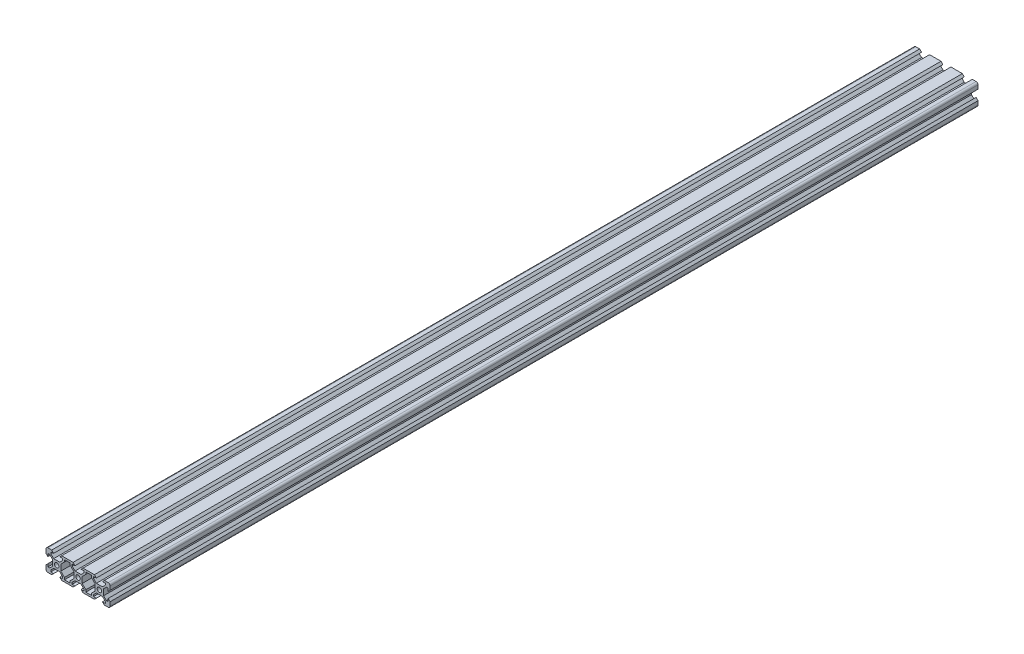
ISO-10303-21;
HEADER;
FILE_DESCRIPTION(('STEP AP214'),'2;1');
FILE_NAME('part.step','',(''),(''),'','','');
FILE_SCHEMA(('AUTOMOTIVE_DESIGN { 1 0 10303 214 1 1 1 1 }'));
ENDSEC;
DATA;
#1=APPLICATION_CONTEXT('core data for automotive mechanical design processes');
#2=APPLICATION_PROTOCOL_DEFINITION('international standard','automotive_design',2000,#1);
#3=PRODUCT_CONTEXT('',#1,'mechanical');
#4=PRODUCT('Part','Part','',(#3));
#5=PRODUCT_RELATED_PRODUCT_CATEGORY('part','',(#4));
#6=PRODUCT_DEFINITION_FORMATION('','',#4);
#7=PRODUCT_DEFINITION_CONTEXT('part definition',#1,'design');
#8=PRODUCT_DEFINITION('design','',#6,#7);
#9=PRODUCT_DEFINITION_SHAPE('','',#8);
#10=(LENGTH_UNIT() NAMED_UNIT(*) SI_UNIT(.MILLI.,.METRE.));
#11=(NAMED_UNIT(*) PLANE_ANGLE_UNIT() SI_UNIT($,.RADIAN.));
#12=(NAMED_UNIT(*) SI_UNIT($,.STERADIAN.) SOLID_ANGLE_UNIT());
#13=UNCERTAINTY_MEASURE_WITH_UNIT(LENGTH_MEASURE(1.E-05),#10,'distance_accuracy_value','');
#14=(GEOMETRIC_REPRESENTATION_CONTEXT(3) GLOBAL_UNCERTAINTY_ASSIGNED_CONTEXT((#13)) GLOBAL_UNIT_ASSIGNED_CONTEXT((#10,
#11,#12)) REPRESENTATION_CONTEXT('',''));
#15=CARTESIAN_POINT('',(0.,0.,0.));
#16=DIRECTION('',(0.,0.,1.));
#17=DIRECTION('',(1.,0.,0.));
#18=AXIS2_PLACEMENT_3D('',#15,#16,#17);
#19=CARTESIAN_POINT('',(2.69933982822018,-8.2,0.));
#20=DIRECTION('',(1.,0.,0.));
#21=DIRECTION('',(0.,0.707106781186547,0.707106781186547));
#22=AXIS2_PLACEMENT_3D('',#19,#20,#21);
#23=PLANE('',#22);
#24=DIRECTION('',(0.,0.,1.));
#25=VECTOR('',#24,1.);
#26=CARTESIAN_POINT('',(2.69933982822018,-8.2,0.));
#27=LINE('',#26,#25);
#28=CARTESIAN_POINT('',(2.69933982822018,-8.2,0.));
#29=VERTEX_POINT('',#28);
#30=CARTESIAN_POINT('',(2.69933982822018,-8.2,812.8));
#31=VERTEX_POINT('',#30);
#32=EDGE_CURVE('E11',#29,#31,#27,.T.);
#33=ORIENTED_EDGE('',*,*,#32,.T.);
#34=DIRECTION('',(0.,1.,0.));
#35=VECTOR('',#34,1.);
#36=CARTESIAN_POINT('',(2.69933982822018,-8.2,812.8));
#37=LINE('',#36,#35);
#38=CARTESIAN_POINT('',(2.69933982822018,-6.24,812.8));
#39=VERTEX_POINT('',#38);
#40=EDGE_CURVE('E787',#31,#39,#37,.T.);
#41=ORIENTED_EDGE('',*,*,#40,.T.);
#42=DIRECTION('',(0.,0.,1.));
#43=VECTOR('',#42,1.);
#44=CARTESIAN_POINT('',(2.69933982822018,-6.24,0.));
#45=LINE('',#44,#43);
#46=CARTESIAN_POINT('',(2.69933982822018,-6.24,0.));
#47=VERTEX_POINT('',#46);
#48=EDGE_CURVE('E47',#47,#39,#45,.T.);
#49=ORIENTED_EDGE('',*,*,#48,.F.);
#50=DIRECTION('',(0.,1.,0.));
#51=VECTOR('',#50,1.);
#52=CARTESIAN_POINT('',(2.69933982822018,-4.1,0.));
#53=LINE('',#52,#51);
#54=EDGE_CURVE('E56',#29,#47,#53,.T.);
#55=ORIENTED_EDGE('',*,*,#54,.F.);
#56=EDGE_LOOP('',(#33,#41,#49,#55));
#57=FACE_BOUND('',#56,.T.);
#58=ADVANCED_FACE('F37',(#57),#23,.F.);
#59=CARTESIAN_POINT('',(2.69933982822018,-6.24,0.));
#60=DIRECTION('',(0.707106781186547,-0.707106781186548,0.));
#61=DIRECTION('',(0.577350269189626,0.577350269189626,0.577350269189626));
#62=AXIS2_PLACEMENT_3D('',#59,#60,#61);
#63=PLANE('',#62);
#64=ORIENTED_EDGE('',*,*,#48,.T.);
#65=DIRECTION('',(0.707106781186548,0.707106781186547,0.));
#66=VECTOR('',#65,1.);
#67=CARTESIAN_POINT('',(2.69933982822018,-6.24,812.8));
#68=LINE('',#67,#66);
#69=CARTESIAN_POINT('',(6.09933982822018,-2.84,812.8));
#70=VERTEX_POINT('',#69);
#71=EDGE_CURVE('E790',#39,#70,#68,.T.);
#72=ORIENTED_EDGE('',*,*,#71,.T.);
#73=DIRECTION('',(0.,0.,1.));
#74=VECTOR('',#73,1.);
#75=CARTESIAN_POINT('',(6.09933982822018,-2.84,0.));
#76=LINE('',#75,#74);
#77=CARTESIAN_POINT('',(6.09933982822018,-2.84,0.));
#78=VERTEX_POINT('',#77);
#79=EDGE_CURVE('E1115',#78,#70,#76,.T.);
#80=ORIENTED_EDGE('',*,*,#79,.F.);
#81=DIRECTION('',(0.707106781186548,0.707106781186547,0.));
#82=VECTOR('',#81,1.);
#83=CARTESIAN_POINT('',(1.08450487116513,-7.85483495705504,0.));
#84=LINE('',#83,#82);
#85=EDGE_CURVE('E1117',#47,#78,#84,.T.);
#86=ORIENTED_EDGE('',*,*,#85,.F.);
#87=EDGE_LOOP('',(#64,#72,#80,#86));
#88=FACE_BOUND('',#87,.T.);
#89=ADVANCED_FACE('F2005',(#88),#63,.F.);
#90=CARTESIAN_POINT('',(6.09933982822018,-2.84,0.));
#91=DIRECTION('',(1.,0.,0.));
#92=DIRECTION('',(0.,0.707106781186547,0.707106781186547));
#93=AXIS2_PLACEMENT_3D('',#90,#91,#92);
#94=PLANE('',#93);
#95=ORIENTED_EDGE('',*,*,#79,.T.);
#96=DIRECTION('',(0.,1.,0.));
#97=VECTOR('',#96,1.);
#98=CARTESIAN_POINT('',(6.09933982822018,-2.84,812.8));
#99=LINE('',#98,#97);
#100=CARTESIAN_POINT('',(6.09933982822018,2.84000000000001,812.8));
#101=VERTEX_POINT('',#100);
#102=EDGE_CURVE('E793',#70,#101,#99,.T.);
#103=ORIENTED_EDGE('',*,*,#102,.T.);
#104=DIRECTION('',(0.,0.,1.));
#105=VECTOR('',#104,1.);
#106=CARTESIAN_POINT('',(6.09933982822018,2.84000000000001,0.));
#107=LINE('',#106,#105);
#108=CARTESIAN_POINT('',(6.09933982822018,2.84000000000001,0.));
#109=VERTEX_POINT('',#108);
#110=EDGE_CURVE('E1120',#109,#101,#107,.T.);
#111=ORIENTED_EDGE('',*,*,#110,.F.);
#112=DIRECTION('',(0.,1.,0.));
#113=VECTOR('',#112,1.);
#114=CARTESIAN_POINT('',(6.09933982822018,-1.42,0.));
#115=LINE('',#114,#113);
#116=EDGE_CURVE('E1122',#78,#109,#115,.T.);
#117=ORIENTED_EDGE('',*,*,#116,.F.);
#118=EDGE_LOOP('',(#95,#103,#111,#117));
#119=FACE_BOUND('',#118,.T.);
#120=ADVANCED_FACE('F2011',(#119),#94,.F.);
#121=CARTESIAN_POINT('',(6.09933982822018,2.84000000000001,0.));
#122=DIRECTION('',(0.707106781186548,0.707106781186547,0.));
#123=DIRECTION('',(-0.577350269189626,0.577350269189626,0.577350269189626));
#124=AXIS2_PLACEMENT_3D('',#121,#122,#123);
#125=PLANE('',#124);
#126=ORIENTED_EDGE('',*,*,#110,.T.);
#127=DIRECTION('',(-0.707106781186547,0.707106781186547,0.));
#128=VECTOR('',#127,1.);
#129=CARTESIAN_POINT('',(6.09933982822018,2.84000000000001,812.8));
#130=LINE('',#129,#128);
#131=CARTESIAN_POINT('',(2.69933982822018,6.24000000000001,812.8));
#132=VERTEX_POINT('',#131);
#133=EDGE_CURVE('E796',#101,#132,#130,.T.);
#134=ORIENTED_EDGE('',*,*,#133,.T.);
#135=DIRECTION('',(0.,0.,1.));
#136=VECTOR('',#135,1.);
#137=CARTESIAN_POINT('',(2.69933982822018,6.24000000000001,0.));
#138=LINE('',#137,#136);
#139=CARTESIAN_POINT('',(2.69933982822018,6.24000000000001,0.));
#140=VERTEX_POINT('',#139);
#141=EDGE_CURVE('E1124',#140,#132,#138,.T.);
#142=ORIENTED_EDGE('',*,*,#141,.F.);
#143=DIRECTION('',(-0.707106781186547,0.707106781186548,0.));
#144=VECTOR('',#143,1.);
#145=CARTESIAN_POINT('',(2.78450487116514,6.15483495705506,0.));
#146=LINE('',#145,#144);
#147=EDGE_CURVE('E1126',#109,#140,#146,.T.);
#148=ORIENTED_EDGE('',*,*,#147,.F.);
#149=EDGE_LOOP('',(#126,#134,#142,#148));
#150=FACE_BOUND('',#149,.T.);
#151=ADVANCED_FACE('F2018',(#150),#125,.F.);
#152=CARTESIAN_POINT('',(2.69933982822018,6.24000000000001,0.));
#153=DIRECTION('',(1.,0.,0.));
#154=DIRECTION('',(0.,0.707106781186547,0.707106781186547));
#155=AXIS2_PLACEMENT_3D('',#152,#153,#154);
#156=PLANE('',#155);
#157=ORIENTED_EDGE('',*,*,#141,.T.);
#158=DIRECTION('',(0.,1.,0.));
#159=VECTOR('',#158,1.);
#160=CARTESIAN_POINT('',(2.69933982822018,6.24000000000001,812.8));
#161=LINE('',#160,#159);
#162=CARTESIAN_POINT('',(2.69933982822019,8.20000000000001,812.8));
#163=VERTEX_POINT('',#162);
#164=EDGE_CURVE('E799',#132,#163,#161,.T.);
#165=ORIENTED_EDGE('',*,*,#164,.T.);
#166=DIRECTION('',(0.,0.,1.));
#167=VECTOR('',#166,1.);
#168=CARTESIAN_POINT('',(2.69933982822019,8.20000000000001,0.));
#169=LINE('',#168,#167);
#170=CARTESIAN_POINT('',(2.69933982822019,8.20000000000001,0.));
#171=VERTEX_POINT('',#170);
#172=EDGE_CURVE('E1128',#171,#163,#169,.T.);
#173=ORIENTED_EDGE('',*,*,#172,.F.);
#174=DIRECTION('',(0.,1.,0.));
#175=VECTOR('',#174,1.);
#176=CARTESIAN_POINT('',(2.69933982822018,3.12,0.));
#177=LINE('',#176,#175);
#178=EDGE_CURVE('E1130',#140,#171,#177,.T.);
#179=ORIENTED_EDGE('',*,*,#178,.F.);
#180=EDGE_LOOP('',(#157,#165,#173,#179));
#181=FACE_BOUND('',#180,.T.);
#182=ADVANCED_FACE('F2022',(#181),#156,.F.);
#183=CARTESIAN_POINT('',(2.69933982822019,8.20000000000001,0.));
#184=DIRECTION('',(0.,1.,0.));
#185=DIRECTION('',(0.707106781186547,0.,0.707106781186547));
#186=AXIS2_PLACEMENT_3D('',#183,#184,#185);
#187=PLANE('',#186);
#188=ORIENTED_EDGE('',*,*,#172,.T.);
#189=DIRECTION('',(-1.,0.,0.));
#190=VECTOR('',#189,1.);
#191=CARTESIAN_POINT('',(2.69933982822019,8.20000000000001,812.8));
#192=LINE('',#191,#190);
#193=CARTESIAN_POINT('',(-2.69933982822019,8.20000000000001,812.8));
#194=VERTEX_POINT('',#193);
#195=EDGE_CURVE('E802',#163,#194,#192,.T.);
#196=ORIENTED_EDGE('',*,*,#195,.T.);
#197=DIRECTION('',(0.,0.,1.));
#198=VECTOR('',#197,1.);
#199=CARTESIAN_POINT('',(-2.69933982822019,8.20000000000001,0.));
#200=LINE('',#199,#198);
#201=CARTESIAN_POINT('',(-2.69933982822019,8.20000000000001,0.));
#202=VERTEX_POINT('',#201);
#203=EDGE_CURVE('E411',#202,#194,#200,.T.);
#204=ORIENTED_EDGE('',*,*,#203,.F.);
#205=DIRECTION('',(-1.,0.,0.));
#206=VECTOR('',#205,1.);
#207=CARTESIAN_POINT('',(-3.65033008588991,8.20000000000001,0.));
#208=LINE('',#207,#206);
#209=EDGE_CURVE('E1134',#171,#202,#208,.T.);
#210=ORIENTED_EDGE('',*,*,#209,.F.);
#211=EDGE_LOOP('',(#188,#196,#204,#210));
#212=FACE_BOUND('',#211,.T.);
#213=ADVANCED_FACE('F2026',(#212),#187,.F.);
#214=CARTESIAN_POINT('',(-22.6993398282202,8.20000000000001,0.));
#215=DIRECTION('',(-1.,0.,0.));
#216=DIRECTION('',(0.,0.707106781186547,0.707106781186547));
#217=AXIS2_PLACEMENT_3D('',#214,#215,#216);
#218=PLANE('',#217);
#219=DIRECTION('',(0.,0.,1.));
#220=VECTOR('',#219,1.);
#221=CARTESIAN_POINT('',(-22.6993398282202,8.20000000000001,0.));
#222=LINE('',#221,#220);
#223=CARTESIAN_POINT('',(-22.6993398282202,8.20000000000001,0.));
#224=VERTEX_POINT('',#223);
#225=CARTESIAN_POINT('',(-22.6993398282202,8.20000000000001,812.8));
#226=VERTEX_POINT('',#225);
#227=EDGE_CURVE('E1132',#224,#226,#222,.T.);
#228=ORIENTED_EDGE('',*,*,#227,.T.);
#229=DIRECTION('',(0.,-1.,0.));
#230=VECTOR('',#229,1.);
#231=CARTESIAN_POINT('',(-22.6993398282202,8.20000000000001,812.8));
#232=LINE('',#231,#230);
#233=CARTESIAN_POINT('',(-22.6993398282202,6.24000000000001,812.8));
#234=VERTEX_POINT('',#233);
#235=EDGE_CURVE('E830',#226,#234,#232,.T.);
#236=ORIENTED_EDGE('',*,*,#235,.T.);
#237=DIRECTION('',(0.,0.,1.));
#238=VECTOR('',#237,1.);
#239=CARTESIAN_POINT('',(-22.6993398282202,6.24000000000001,0.));
#240=LINE('',#239,#238);
#241=CARTESIAN_POINT('',(-22.6993398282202,6.24000000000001,0.));
#242=VERTEX_POINT('',#241);
#243=EDGE_CURVE('E1140',#242,#234,#240,.T.);
#244=ORIENTED_EDGE('',*,*,#243,.F.);
#245=DIRECTION('',(0.,-1.,0.));
#246=VECTOR('',#245,1.);
#247=CARTESIAN_POINT('',(-22.6993398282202,4.10000000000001,0.));
#248=LINE('',#247,#246);
#249=EDGE_CURVE('E1143',#224,#242,#248,.T.);
#250=ORIENTED_EDGE('',*,*,#249,.F.);
#251=EDGE_LOOP('',(#228,#236,#244,#250));
#252=FACE_BOUND('',#251,.T.);
#253=ADVANCED_FACE('F2030',(#252),#218,.F.);
#254=CARTESIAN_POINT('',(-22.6993398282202,6.24000000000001,0.));
#255=DIRECTION('',(-0.707106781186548,0.707106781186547,0.));
#256=DIRECTION('',(0.577350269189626,0.577350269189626,0.577350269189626));
#257=AXIS2_PLACEMENT_3D('',#254,#255,#256);
#258=PLANE('',#257);
#259=ORIENTED_EDGE('',*,*,#243,.T.);
#260=DIRECTION('',(-0.707106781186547,-0.707106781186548,0.));
#261=VECTOR('',#260,1.);
#262=CARTESIAN_POINT('',(-22.6993398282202,6.24000000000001,812.8));
#263=LINE('',#262,#261);
#264=CARTESIAN_POINT('',(-26.0993398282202,2.84000000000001,812.8));
#265=VERTEX_POINT('',#264);
#266=EDGE_CURVE('E833',#234,#265,#263,.T.);
#267=ORIENTED_EDGE('',*,*,#266,.T.);
#268=DIRECTION('',(0.,0.,1.));
#269=VECTOR('',#268,1.);
#270=CARTESIAN_POINT('',(-26.0993398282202,2.84000000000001,0.));
#271=LINE('',#270,#269);
#272=CARTESIAN_POINT('',(-26.0993398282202,2.84000000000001,0.));
#273=VERTEX_POINT('',#272);
#274=EDGE_CURVE('E1142',#273,#265,#271,.T.);
#275=ORIENTED_EDGE('',*,*,#274,.F.);
#276=DIRECTION('',(-0.707106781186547,-0.707106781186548,0.));
#277=VECTOR('',#276,1.);
#278=CARTESIAN_POINT('',(-21.0845048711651,7.85483495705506,0.));
#279=LINE('',#278,#277);
#280=EDGE_CURVE('E1146',#242,#273,#279,.T.);
#281=ORIENTED_EDGE('',*,*,#280,.F.);
#282=EDGE_LOOP('',(#259,#267,#275,#281));
#283=FACE_BOUND('',#282,.T.);
#284=ADVANCED_FACE('F2034',(#283),#258,.F.);
#285=CARTESIAN_POINT('',(-26.0993398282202,2.84000000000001,0.));
#286=DIRECTION('',(-1.,0.,0.));
#287=DIRECTION('',(0.,0.707106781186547,0.707106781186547));
#288=AXIS2_PLACEMENT_3D('',#285,#286,#287);
#289=PLANE('',#288);
#290=ORIENTED_EDGE('',*,*,#274,.T.);
#291=DIRECTION('',(0.,-1.,0.));
#292=VECTOR('',#291,1.);
#293=CARTESIAN_POINT('',(-26.0993398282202,2.84000000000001,812.8));
#294=LINE('',#293,#292);
#295=CARTESIAN_POINT('',(-26.0993398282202,-2.84,812.8));
#296=VERTEX_POINT('',#295);
#297=EDGE_CURVE('E836',#265,#296,#294,.T.);
#298=ORIENTED_EDGE('',*,*,#297,.T.);
#299=DIRECTION('',(0.,0.,1.));
#300=VECTOR('',#299,1.);
#301=CARTESIAN_POINT('',(-26.0993398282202,-2.84,0.));
#302=LINE('',#301,#300);
#303=CARTESIAN_POINT('',(-26.0993398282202,-2.84,0.));
#304=VERTEX_POINT('',#303);
#305=EDGE_CURVE('E1149',#304,#296,#302,.T.);
#306=ORIENTED_EDGE('',*,*,#305,.F.);
#307=DIRECTION('',(0.,-1.,0.));
#308=VECTOR('',#307,1.);
#309=CARTESIAN_POINT('',(-26.0993398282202,1.42000000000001,0.));
#310=LINE('',#309,#308);
#311=EDGE_CURVE('E1151',#273,#304,#310,.T.);
#312=ORIENTED_EDGE('',*,*,#311,.F.);
#313=EDGE_LOOP('',(#290,#298,#306,#312));
#314=FACE_BOUND('',#313,.T.);
#315=ADVANCED_FACE('F2038',(#314),#289,.F.);
#316=CARTESIAN_POINT('',(-26.0993398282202,-2.84,0.));
#317=DIRECTION('',(-0.707106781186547,-0.707106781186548,0.));
#318=DIRECTION('',(-0.577350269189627,0.577350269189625,0.577350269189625));
#319=AXIS2_PLACEMENT_3D('',#316,#317,#318);
#320=PLANE('',#319);
#321=ORIENTED_EDGE('',*,*,#305,.T.);
#322=DIRECTION('',(0.707106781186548,-0.707106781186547,0.));
#323=VECTOR('',#322,1.);
#324=CARTESIAN_POINT('',(-26.0993398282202,-2.84,812.8));
#325=LINE('',#324,#323);
#326=CARTESIAN_POINT('',(-22.6993398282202,-6.24,812.8));
#327=VERTEX_POINT('',#326);
#328=EDGE_CURVE('E839',#296,#327,#325,.T.);
#329=ORIENTED_EDGE('',*,*,#328,.T.);
#330=DIRECTION('',(0.,0.,1.));
#331=VECTOR('',#330,1.);
#332=CARTESIAN_POINT('',(-22.6993398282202,-6.24,0.));
#333=LINE('',#332,#331);
#334=CARTESIAN_POINT('',(-22.6993398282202,-6.24,0.));
#335=VERTEX_POINT('',#334);
#336=EDGE_CURVE('E1153',#335,#327,#333,.T.);
#337=ORIENTED_EDGE('',*,*,#336,.F.);
#338=DIRECTION('',(0.707106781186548,-0.707106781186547,0.));
#339=VECTOR('',#338,1.);
#340=CARTESIAN_POINT('',(-22.7845048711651,-6.15483495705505,0.));
#341=LINE('',#340,#339);
#342=EDGE_CURVE('E1155',#304,#335,#341,.T.);
#343=ORIENTED_EDGE('',*,*,#342,.F.);
#344=EDGE_LOOP('',(#321,#329,#337,#343));
#345=FACE_BOUND('',#344,.T.);
#346=ADVANCED_FACE('F2042',(#345),#320,.F.);
#347=CARTESIAN_POINT('',(-22.6993398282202,-6.24,0.));
#348=DIRECTION('',(-1.,0.,0.));
#349=DIRECTION('',(0.,0.707106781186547,0.707106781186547));
#350=AXIS2_PLACEMENT_3D('',#347,#348,#349);
#351=PLANE('',#350);
#352=ORIENTED_EDGE('',*,*,#336,.T.);
#353=DIRECTION('',(0.,-1.,0.));
#354=VECTOR('',#353,1.);
#355=CARTESIAN_POINT('',(-22.6993398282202,-6.24,812.8));
#356=LINE('',#355,#354);
#357=CARTESIAN_POINT('',(-22.6993398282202,-8.2,812.8));
#358=VERTEX_POINT('',#357);
#359=EDGE_CURVE('E842',#327,#358,#356,.T.);
#360=ORIENTED_EDGE('',*,*,#359,.T.);
#361=DIRECTION('',(0.,0.,1.));
#362=VECTOR('',#361,1.);
#363=CARTESIAN_POINT('',(-22.6993398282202,-8.2,0.));
#364=LINE('',#363,#362);
#365=CARTESIAN_POINT('',(-22.6993398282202,-8.2,0.));
#366=VERTEX_POINT('',#365);
#367=EDGE_CURVE('E1157',#366,#358,#364,.T.);
#368=ORIENTED_EDGE('',*,*,#367,.F.);
#369=DIRECTION('',(0.,-1.,0.));
#370=VECTOR('',#369,1.);
#371=CARTESIAN_POINT('',(-22.6993398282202,-3.12,0.));
#372=LINE('',#371,#370);
#373=EDGE_CURVE('E1159',#335,#366,#372,.T.);
#374=ORIENTED_EDGE('',*,*,#373,.F.);
#375=EDGE_LOOP('',(#352,#360,#368,#374));
#376=FACE_BOUND('',#375,.T.);
#377=ADVANCED_FACE('F2046',(#376),#351,.F.);
#378=CARTESIAN_POINT('',(-22.6993398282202,-8.2,0.));
#379=DIRECTION('',(0.,-1.,0.));
#380=DIRECTION('',(0.707106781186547,0.,0.707106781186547));
#381=AXIS2_PLACEMENT_3D('',#378,#379,#380);
#382=PLANE('',#381);
#383=ORIENTED_EDGE('',*,*,#367,.T.);
#384=DIRECTION('',(1.,0.,0.));
#385=VECTOR('',#384,1.);
#386=CARTESIAN_POINT('',(-22.6993398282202,-8.2,812.8));
#387=LINE('',#386,#385);
#388=CARTESIAN_POINT('',(-17.3006601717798,-8.2,812.8));
#389=VERTEX_POINT('',#388);
#390=EDGE_CURVE('E845',#358,#389,#387,.T.);
#391=ORIENTED_EDGE('',*,*,#390,.T.);
#392=DIRECTION('',(0.,0.,1.));
#393=VECTOR('',#392,1.);
#394=CARTESIAN_POINT('',(-17.3006601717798,-8.2,0.));
#395=LINE('',#394,#393);
#396=CARTESIAN_POINT('',(-17.3006601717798,-8.2,0.));
#397=VERTEX_POINT('',#396);
#398=EDGE_CURVE('E419',#397,#389,#395,.T.);
#399=ORIENTED_EDGE('',*,*,#398,.F.);
#400=DIRECTION('',(1.,0.,0.));
#401=VECTOR('',#400,1.);
#402=CARTESIAN_POINT('',(-16.3496699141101,-8.2,0.));
#403=LINE('',#402,#401);
#404=EDGE_CURVE('E1163',#366,#397,#403,.T.);
#405=ORIENTED_EDGE('',*,*,#404,.F.);
#406=EDGE_LOOP('',(#383,#391,#399,#405));
#407=FACE_BOUND('',#406,.T.);
#408=ADVANCED_FACE('F2050',(#407),#382,.F.);
#409=CARTESIAN_POINT('',(-4.50066017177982,6.56,0.));
#410=DIRECTION('',(-0.707106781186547,0.707106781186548,0.));
#411=DIRECTION('',(0.577350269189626,0.577350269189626,0.577350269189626));
#412=AXIS2_PLACEMENT_3D('',#409,#410,#411);
#413=PLANE('',#412);
#414=DIRECTION('',(0.,0.,1.));
#415=VECTOR('',#414,1.);
#416=CARTESIAN_POINT('',(-7.16,3.90066017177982,0.));
#417=LINE('',#416,#415);
#418=CARTESIAN_POINT('',(-7.16,3.90066017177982,0.));
#419=VERTEX_POINT('',#418);
#420=CARTESIAN_POINT('',(-7.16,3.90066017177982,812.8));
#421=VERTEX_POINT('',#420);
#422=EDGE_CURVE('E1161',#419,#421,#417,.T.);
#423=ORIENTED_EDGE('',*,*,#422,.T.);
#424=DIRECTION('',(-0.707106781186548,-0.707106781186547,0.));
#425=VECTOR('',#424,1.);
#426=CARTESIAN_POINT('',(-4.50066017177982,6.56,812.8));
#427=LINE('',#426,#425);
#428=CARTESIAN_POINT('',(-4.50066017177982,6.56,812.8));
#429=VERTEX_POINT('',#428);
#430=EDGE_CURVE('E984',#429,#421,#427,.T.);
#431=ORIENTED_EDGE('',*,*,#430,.F.);
#432=DIRECTION('',(0.,0.,1.));
#433=VECTOR('',#432,1.);
#434=CARTESIAN_POINT('',(-4.50066017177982,6.56,0.));
#435=LINE('',#434,#433);
#436=CARTESIAN_POINT('',(-4.50066017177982,6.56,0.));
#437=VERTEX_POINT('',#436);
#438=EDGE_CURVE('E1168',#437,#429,#435,.T.);
#439=ORIENTED_EDGE('',*,*,#438,.F.);
#440=DIRECTION('',(0.707106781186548,0.707106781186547,0.));
#441=VECTOR('',#440,1.);
#442=CARTESIAN_POINT('',(-7.51549512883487,3.54516504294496,0.));
#443=LINE('',#442,#441);
#444=EDGE_CURVE('E1171',#419,#437,#443,.T.);
#445=ORIENTED_EDGE('',*,*,#444,.F.);
#446=EDGE_LOOP('',(#423,#431,#439,#445));
#447=FACE_BOUND('',#446,.T.);
#448=ADVANCED_FACE('F1568',(#447),#413,.T.);
#449=CARTESIAN_POINT('',(-4.50066017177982,8.2,0.));
#450=DIRECTION('',(-1.,0.,0.));
#451=DIRECTION('',(0.,0.707106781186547,0.707106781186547));
#452=AXIS2_PLACEMENT_3D('',#449,#450,#451);
#453=PLANE('',#452);
#454=ORIENTED_EDGE('',*,*,#438,.T.);
#455=DIRECTION('',(0.,-1.,0.));
#456=VECTOR('',#455,1.);
#457=CARTESIAN_POINT('',(-4.50066017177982,8.2,812.8));
#458=LINE('',#457,#456);
#459=CARTESIAN_POINT('',(-4.50066017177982,8.2,812.8));
#460=VERTEX_POINT('',#459);
#461=EDGE_CURVE('E981',#460,#429,#458,.T.);
#462=ORIENTED_EDGE('',*,*,#461,.F.);
#463=DIRECTION('',(0.,0.,1.));
#464=VECTOR('',#463,1.);
#465=CARTESIAN_POINT('',(-4.50066017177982,8.2,0.));
#466=LINE('',#465,#464);
#467=CARTESIAN_POINT('',(-4.50066017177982,8.2,0.));
#468=VERTEX_POINT('',#467);
#469=EDGE_CURVE('E1170',#468,#460,#466,.T.);
#470=ORIENTED_EDGE('',*,*,#469,.F.);
#471=DIRECTION('',(0.,1.,0.));
#472=VECTOR('',#471,1.);
#473=CARTESIAN_POINT('',(-4.50066017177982,4.1,0.));
#474=LINE('',#473,#472);
#475=EDGE_CURVE('E1173',#437,#468,#474,.T.);
#476=ORIENTED_EDGE('',*,*,#475,.F.);
#477=EDGE_LOOP('',(#454,#462,#470,#476));
#478=FACE_BOUND('',#477,.T.);
#479=ADVANCED_FACE('F1576',(#478),#453,.T.);
#480=CARTESIAN_POINT('',(-7.16,8.20000000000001,0.));
#481=DIRECTION('',(0.,-1.,0.));
#482=DIRECTION('',(0.707106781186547,0.,0.707106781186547));
#483=AXIS2_PLACEMENT_3D('',#480,#481,#482);
#484=PLANE('',#483);
#485=ORIENTED_EDGE('',*,*,#469,.T.);
#486=DIRECTION('',(1.,0.,0.));
#487=VECTOR('',#486,1.);
#488=CARTESIAN_POINT('',(-7.16,8.20000000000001,812.8));
#489=LINE('',#488,#487);
#490=CARTESIAN_POINT('',(-7.16,8.20000000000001,812.8));
#491=VERTEX_POINT('',#490);
#492=EDGE_CURVE('E978',#491,#460,#489,.T.);
#493=ORIENTED_EDGE('',*,*,#492,.F.);
#494=DIRECTION('',(0.,0.,1.));
#495=VECTOR('',#494,1.);
#496=CARTESIAN_POINT('',(-7.16,8.20000000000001,0.));
#497=LINE('',#496,#495);
#498=CARTESIAN_POINT('',(-7.16,8.20000000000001,0.));
#499=VERTEX_POINT('',#498);
#500=EDGE_CURVE('E1176',#499,#491,#497,.T.);
#501=ORIENTED_EDGE('',*,*,#500,.F.);
#502=DIRECTION('',(-1.,0.,0.));
#503=VECTOR('',#502,1.);
#504=CARTESIAN_POINT('',(-8.57999999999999,8.20000000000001,0.));
#505=LINE('',#504,#503);
#506=EDGE_CURVE('E1178',#468,#499,#505,.T.);
#507=ORIENTED_EDGE('',*,*,#506,.F.);
#508=EDGE_LOOP('',(#485,#493,#501,#507));
#509=FACE_BOUND('',#508,.T.);
#510=ADVANCED_FACE('F1583',(#509),#484,.T.);
#511=CARTESIAN_POINT('',(-5.36,10.,0.));
#512=DIRECTION('',(-0.707106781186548,0.707106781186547,0.));
#513=DIRECTION('',(0.577350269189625,0.577350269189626,0.577350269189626));
#514=AXIS2_PLACEMENT_3D('',#511,#512,#513);
#515=PLANE('',#514);
#516=ORIENTED_EDGE('',*,*,#500,.T.);
#517=DIRECTION('',(-0.707106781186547,-0.707106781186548,0.));
#518=VECTOR('',#517,1.);
#519=CARTESIAN_POINT('',(-5.36,10.,812.8));
#520=LINE('',#519,#518);
#521=CARTESIAN_POINT('',(-5.36,10.,812.8));
#522=VERTEX_POINT('',#521);
#523=EDGE_CURVE('E975',#522,#491,#520,.T.);
#524=ORIENTED_EDGE('',*,*,#523,.F.);
#525=DIRECTION('',(0.,0.,1.));
#526=VECTOR('',#525,1.);
#527=CARTESIAN_POINT('',(-5.36,10.,0.));
#528=LINE('',#527,#526);
#529=CARTESIAN_POINT('',(-5.36,10.,0.));
#530=VERTEX_POINT('',#529);
#531=EDGE_CURVE('E1180',#530,#522,#528,.T.);
#532=ORIENTED_EDGE('',*,*,#531,.F.);
#533=DIRECTION('',(0.707106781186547,0.707106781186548,0.));
#534=VECTOR('',#533,1.);
#535=CARTESIAN_POINT('',(-9.02,6.34,0.));
#536=LINE('',#535,#534);
#537=EDGE_CURVE('E1182',#499,#530,#536,.T.);
#538=ORIENTED_EDGE('',*,*,#537,.F.);
#539=EDGE_LOOP('',(#516,#524,#532,#538));
#540=FACE_BOUND('',#539,.T.);
#541=ADVANCED_FACE('F1586',(#540),#515,.T.);
#542=CARTESIAN_POINT('',(5.36,10.,0.));
#543=DIRECTION('',(0.,1.,0.));
#544=DIRECTION('',(0.707106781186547,0.,0.707106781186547));
#545=AXIS2_PLACEMENT_3D('',#542,#543,#544);
#546=PLANE('',#545);
#547=ORIENTED_EDGE('',*,*,#531,.T.);
#548=DIRECTION('',(-1.,0.,0.));
#549=VECTOR('',#548,1.);
#550=CARTESIAN_POINT('',(5.36,10.,812.8));
#551=LINE('',#550,#549);
#552=CARTESIAN_POINT('',(5.36,10.,812.8));
#553=VERTEX_POINT('',#552);
#554=EDGE_CURVE('E972',#553,#522,#551,.T.);
#555=ORIENTED_EDGE('',*,*,#554,.F.);
#556=DIRECTION('',(0.,0.,1.));
#557=VECTOR('',#556,1.);
#558=CARTESIAN_POINT('',(5.36,10.,0.));
#559=LINE('',#558,#557);
#560=CARTESIAN_POINT('',(5.36,10.,0.));
#561=VERTEX_POINT('',#560);
#562=EDGE_CURVE('E1184',#561,#553,#559,.T.);
#563=ORIENTED_EDGE('',*,*,#562,.F.);
#564=DIRECTION('',(1.,0.,0.));
#565=VECTOR('',#564,1.);
#566=CARTESIAN_POINT('',(-2.32,10.,0.));
#567=LINE('',#566,#565);
#568=EDGE_CURVE('E1186',#530,#561,#567,.T.);
#569=ORIENTED_EDGE('',*,*,#568,.F.);
#570=EDGE_LOOP('',(#547,#555,#563,#569));
#571=FACE_BOUND('',#570,.T.);
#572=ADVANCED_FACE('F1591',(#571),#546,.T.);
#573=CARTESIAN_POINT('',(7.16,8.20000000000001,0.));
#574=DIRECTION('',(0.707106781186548,0.707106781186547,0.));
#575=DIRECTION('',(-0.577350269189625,0.577350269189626,0.577350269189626));
#576=AXIS2_PLACEMENT_3D('',#573,#574,#575);
#577=PLANE('',#576);
#578=ORIENTED_EDGE('',*,*,#562,.T.);
#579=DIRECTION('',(-0.707106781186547,0.707106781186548,0.));
#580=VECTOR('',#579,1.);
#581=CARTESIAN_POINT('',(7.16,8.20000000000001,812.8));
#582=LINE('',#581,#580);
#583=CARTESIAN_POINT('',(7.16,8.20000000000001,812.8));
#584=VERTEX_POINT('',#583);
#585=EDGE_CURVE('E969',#584,#553,#582,.T.);
#586=ORIENTED_EDGE('',*,*,#585,.F.);
#587=DIRECTION('',(0.,0.,1.));
#588=VECTOR('',#587,1.);
#589=CARTESIAN_POINT('',(7.16,8.20000000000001,0.));
#590=LINE('',#589,#588);
#591=CARTESIAN_POINT('',(7.16,8.20000000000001,0.));
#592=VERTEX_POINT('',#591);
#593=EDGE_CURVE('E1188',#592,#584,#590,.T.);
#594=ORIENTED_EDGE('',*,*,#593,.F.);
#595=DIRECTION('',(0.707106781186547,-0.707106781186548,0.));
#596=VECTOR('',#595,1.);
#597=CARTESIAN_POINT('',(4.92000000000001,10.44,0.));
#598=LINE('',#597,#596);
#599=EDGE_CURVE('E1190',#561,#592,#598,.T.);
#600=ORIENTED_EDGE('',*,*,#599,.F.);
#601=EDGE_LOOP('',(#578,#586,#594,#600));
#602=FACE_BOUND('',#601,.T.);
#603=ADVANCED_FACE('F1598',(#602),#577,.T.);
#604=CARTESIAN_POINT('',(4.50066017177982,8.2,0.));
#605=DIRECTION('',(0.,-1.,0.));
#606=DIRECTION('',(0.707106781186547,0.,0.707106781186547));
#607=AXIS2_PLACEMENT_3D('',#604,#605,#606);
#608=PLANE('',#607);
#609=ORIENTED_EDGE('',*,*,#593,.T.);
#610=DIRECTION('',(1.,0.,0.));
#611=VECTOR('',#610,1.);
#612=CARTESIAN_POINT('',(4.50066017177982,8.2,812.8));
#613=LINE('',#612,#611);
#614=CARTESIAN_POINT('',(4.50066017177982,8.2,812.8));
#615=VERTEX_POINT('',#614);
#616=EDGE_CURVE('E966',#615,#584,#613,.T.);
#617=ORIENTED_EDGE('',*,*,#616,.F.);
#618=DIRECTION('',(0.,0.,1.));
#619=VECTOR('',#618,1.);
#620=CARTESIAN_POINT('',(4.50066017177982,8.2,0.));
#621=LINE('',#620,#619);
#622=CARTESIAN_POINT('',(4.50066017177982,8.2,0.));
#623=VERTEX_POINT('',#622);
#624=EDGE_CURVE('E1192',#623,#615,#621,.T.);
#625=ORIENTED_EDGE('',*,*,#624,.F.);
#626=DIRECTION('',(-1.,0.,0.));
#627=VECTOR('',#626,1.);
#628=CARTESIAN_POINT('',(-2.7496699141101,8.19999999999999,0.));
#629=LINE('',#628,#627);
#630=EDGE_CURVE('E1194',#592,#623,#629,.T.);
#631=ORIENTED_EDGE('',*,*,#630,.F.);
#632=EDGE_LOOP('',(#609,#617,#625,#631));
#633=FACE_BOUND('',#632,.T.);
#634=ADVANCED_FACE('F1601',(#633),#608,.T.);
#635=CARTESIAN_POINT('',(4.50066017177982,6.56,0.));
#636=DIRECTION('',(1.,0.,0.));
#637=DIRECTION('',(0.,0.707106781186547,0.707106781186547));
#638=AXIS2_PLACEMENT_3D('',#635,#636,#637);
#639=PLANE('',#638);
#640=ORIENTED_EDGE('',*,*,#624,.T.);
#641=DIRECTION('',(0.,1.,0.));
#642=VECTOR('',#641,1.);
#643=CARTESIAN_POINT('',(4.50066017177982,6.56,812.8));
#644=LINE('',#643,#642);
#645=CARTESIAN_POINT('',(4.50066017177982,6.56,812.8));
#646=VERTEX_POINT('',#645);
#647=EDGE_CURVE('E963',#646,#615,#644,.T.);
#648=ORIENTED_EDGE('',*,*,#647,.F.);
#649=DIRECTION('',(0.,0.,1.));
#650=VECTOR('',#649,1.);
#651=CARTESIAN_POINT('',(4.50066017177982,6.56,0.));
#652=LINE('',#651,#650);
#653=CARTESIAN_POINT('',(4.50066017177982,6.56,0.));
#654=VERTEX_POINT('',#653);
#655=EDGE_CURVE('E1196',#654,#646,#652,.T.);
#656=ORIENTED_EDGE('',*,*,#655,.F.);
#657=DIRECTION('',(0.,-1.,0.));
#658=VECTOR('',#657,1.);
#659=CARTESIAN_POINT('',(4.50066017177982,3.28,0.));
#660=LINE('',#659,#658);
#661=EDGE_CURVE('E1198',#623,#654,#660,.T.);
#662=ORIENTED_EDGE('',*,*,#661,.F.);
#663=EDGE_LOOP('',(#640,#648,#656,#662));
#664=FACE_BOUND('',#663,.T.);
#665=ADVANCED_FACE('F1606',(#664),#639,.T.);
#666=CARTESIAN_POINT('',(7.16,3.90066017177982,0.));
#667=DIRECTION('',(0.707106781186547,0.707106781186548,0.));
#668=DIRECTION('',(-0.577350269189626,0.577350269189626,0.577350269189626));
#669=AXIS2_PLACEMENT_3D('',#666,#667,#668);
#670=PLANE('',#669);
#671=ORIENTED_EDGE('',*,*,#655,.T.);
#672=DIRECTION('',(-0.707106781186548,0.707106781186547,0.));
#673=VECTOR('',#672,1.);
#674=CARTESIAN_POINT('',(7.16,3.90066017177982,812.8));
#675=LINE('',#674,#673);
#676=CARTESIAN_POINT('',(7.16,3.90066017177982,812.8));
#677=VERTEX_POINT('',#676);
#678=EDGE_CURVE('E960',#677,#646,#675,.T.);
#679=ORIENTED_EDGE('',*,*,#678,.F.);
#680=DIRECTION('',(0.,0.,1.));
#681=VECTOR('',#680,1.);
#682=CARTESIAN_POINT('',(7.16,3.90066017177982,0.));
#683=LINE('',#682,#681);
#684=CARTESIAN_POINT('',(7.16,3.90066017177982,0.));
#685=VERTEX_POINT('',#684);
#686=EDGE_CURVE('E1200',#685,#677,#683,.T.);
#687=ORIENTED_EDGE('',*,*,#686,.F.);
#688=DIRECTION('',(0.707106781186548,-0.707106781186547,0.));
#689=VECTOR('',#688,1.);
#690=CARTESIAN_POINT('',(3.84516504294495,7.21549512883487,0.));
#691=LINE('',#690,#689);
#692=EDGE_CURVE('E1202',#654,#685,#691,.T.);
#693=ORIENTED_EDGE('',*,*,#692,.F.);
#694=EDGE_LOOP('',(#671,#679,#687,#693));
#695=FACE_BOUND('',#694,.T.);
#696=ADVANCED_FACE('F1613',(#695),#670,.T.);
#697=CARTESIAN_POINT('',(12.84,3.90066017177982,0.));
#698=DIRECTION('',(0.,1.,0.));
#699=DIRECTION('',(0.707106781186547,0.,0.707106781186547));
#700=AXIS2_PLACEMENT_3D('',#697,#698,#699);
#701=PLANE('',#700);
#702=ORIENTED_EDGE('',*,*,#686,.T.);
#703=DIRECTION('',(-1.,0.,0.));
#704=VECTOR('',#703,1.);
#705=CARTESIAN_POINT('',(12.84,3.90066017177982,812.8));
#706=LINE('',#705,#704);
#707=CARTESIAN_POINT('',(12.84,3.90066017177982,812.8));
#708=VERTEX_POINT('',#707);
#709=EDGE_CURVE('E957',#708,#677,#706,.T.);
#710=ORIENTED_EDGE('',*,*,#709,.F.);
#711=DIRECTION('',(0.,0.,1.));
#712=VECTOR('',#711,1.);
#713=CARTESIAN_POINT('',(12.84,3.90066017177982,0.));
#714=LINE('',#713,#712);
#715=CARTESIAN_POINT('',(12.84,3.90066017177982,0.));
#716=VERTEX_POINT('',#715);
#717=EDGE_CURVE('E1204',#716,#708,#714,.T.);
#718=ORIENTED_EDGE('',*,*,#717,.F.);
#719=DIRECTION('',(1.,0.,0.));
#720=VECTOR('',#719,1.);
#721=CARTESIAN_POINT('',(1.42,3.90066017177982,0.));
#722=LINE('',#721,#720);
#723=EDGE_CURVE('E1206',#685,#716,#722,.T.);
#724=ORIENTED_EDGE('',*,*,#723,.F.);
#725=EDGE_LOOP('',(#702,#710,#718,#724));
#726=FACE_BOUND('',#725,.T.);
#727=ADVANCED_FACE('F1616',(#726),#701,.T.);
#728=CARTESIAN_POINT('',(15.4993398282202,6.56,0.));
#729=DIRECTION('',(-0.707106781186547,0.707106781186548,0.));
#730=DIRECTION('',(0.577350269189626,0.577350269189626,0.577350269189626));
#731=AXIS2_PLACEMENT_3D('',#728,#729,#730);
#732=PLANE('',#731);
#733=ORIENTED_EDGE('',*,*,#717,.T.);
#734=DIRECTION('',(-0.707106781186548,-0.707106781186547,0.));
#735=VECTOR('',#734,1.);
#736=CARTESIAN_POINT('',(15.4993398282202,6.56,812.8));
#737=LINE('',#736,#735);
#738=CARTESIAN_POINT('',(15.4993398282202,6.56,812.8));
#739=VERTEX_POINT('',#738);
#740=EDGE_CURVE('E954',#739,#708,#737,.T.);
#741=ORIENTED_EDGE('',*,*,#740,.F.);
#742=DIRECTION('',(0.,0.,1.));
#743=VECTOR('',#742,1.);
#744=CARTESIAN_POINT('',(15.4993398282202,6.56,0.));
#745=LINE('',#744,#743);
#746=CARTESIAN_POINT('',(15.4993398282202,6.56,0.));
#747=VERTEX_POINT('',#746);
#748=EDGE_CURVE('E1208',#747,#739,#745,.T.);
#749=ORIENTED_EDGE('',*,*,#748,.F.);
#750=DIRECTION('',(0.707106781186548,0.707106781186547,0.));
#751=VECTOR('',#750,1.);
#752=CARTESIAN_POINT('',(7.48450487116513,-1.45483495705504,0.));
#753=LINE('',#752,#751);
#754=EDGE_CURVE('E1210',#716,#747,#753,.T.);
#755=ORIENTED_EDGE('',*,*,#754,.F.);
#756=EDGE_LOOP('',(#733,#741,#749,#755));
#757=FACE_BOUND('',#756,.T.);
#758=ADVANCED_FACE('F1621',(#757),#732,.T.);
#759=CARTESIAN_POINT('',(15.4993398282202,8.2,0.));
#760=DIRECTION('',(-1.,0.,0.));
#761=DIRECTION('',(0.,0.707106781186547,0.707106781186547));
#762=AXIS2_PLACEMENT_3D('',#759,#760,#761);
#763=PLANE('',#762);
#764=ORIENTED_EDGE('',*,*,#748,.T.);
#765=DIRECTION('',(0.,-1.,0.));
#766=VECTOR('',#765,1.);
#767=CARTESIAN_POINT('',(15.4993398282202,8.2,812.8));
#768=LINE('',#767,#766);
#769=CARTESIAN_POINT('',(15.4993398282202,8.2,812.8));
#770=VERTEX_POINT('',#769);
#771=EDGE_CURVE('E951',#770,#739,#768,.T.);
#772=ORIENTED_EDGE('',*,*,#771,.F.);
#773=DIRECTION('',(0.,0.,1.));
#774=VECTOR('',#773,1.);
#775=CARTESIAN_POINT('',(15.4993398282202,8.2,0.));
#776=LINE('',#775,#774);
#777=CARTESIAN_POINT('',(15.4993398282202,8.2,0.));
#778=VERTEX_POINT('',#777);
#779=EDGE_CURVE('E1212',#778,#770,#776,.T.);
#780=ORIENTED_EDGE('',*,*,#779,.F.);
#781=DIRECTION('',(0.,1.,0.));
#782=VECTOR('',#781,1.);
#783=CARTESIAN_POINT('',(15.4993398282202,4.1,0.));
#784=LINE('',#783,#782);
#785=EDGE_CURVE('E1214',#747,#778,#784,.T.);
#786=ORIENTED_EDGE('',*,*,#785,.F.);
#787=EDGE_LOOP('',(#764,#772,#780,#786));
#788=FACE_BOUND('',#787,.T.);
#789=ADVANCED_FACE('F1628',(#788),#763,.T.);
#790=CARTESIAN_POINT('',(12.84,8.20000000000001,0.));
#791=DIRECTION('',(0.,-1.,0.));
#792=DIRECTION('',(0.707106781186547,0.,0.707106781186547));
#793=AXIS2_PLACEMENT_3D('',#790,#791,#792);
#794=PLANE('',#793);
#795=ORIENTED_EDGE('',*,*,#779,.T.);
#796=DIRECTION('',(1.,0.,0.));
#797=VECTOR('',#796,1.);
#798=CARTESIAN_POINT('',(12.84,8.20000000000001,812.8));
#799=LINE('',#798,#797);
#800=CARTESIAN_POINT('',(12.84,8.20000000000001,812.8));
#801=VERTEX_POINT('',#800);
#802=EDGE_CURVE('E948',#801,#770,#799,.T.);
#803=ORIENTED_EDGE('',*,*,#802,.F.);
#804=DIRECTION('',(0.,0.,1.));
#805=VECTOR('',#804,1.);
#806=CARTESIAN_POINT('',(12.84,8.20000000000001,0.));
#807=LINE('',#806,#805);
#808=CARTESIAN_POINT('',(12.84,8.20000000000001,0.));
#809=VERTEX_POINT('',#808);
#810=EDGE_CURVE('E1216',#809,#801,#807,.T.);
#811=ORIENTED_EDGE('',*,*,#810,.F.);
#812=DIRECTION('',(-1.,0.,0.));
#813=VECTOR('',#812,1.);
#814=CARTESIAN_POINT('',(1.42000000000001,8.20000000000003,0.));
#815=LINE('',#814,#813);
#816=EDGE_CURVE('E1218',#778,#809,#815,.T.);
#817=ORIENTED_EDGE('',*,*,#816,.F.);
#818=EDGE_LOOP('',(#795,#803,#811,#817));
#819=FACE_BOUND('',#818,.T.);
#820=ADVANCED_FACE('F1631',(#819),#794,.T.);
#821=CARTESIAN_POINT('',(14.64,10.,0.));
#822=DIRECTION('',(-0.707106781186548,0.707106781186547,0.));
#823=DIRECTION('',(0.577350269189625,0.577350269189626,0.577350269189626));
#824=AXIS2_PLACEMENT_3D('',#821,#822,#823);
#825=PLANE('',#824);
#826=ORIENTED_EDGE('',*,*,#810,.T.);
#827=DIRECTION('',(-0.707106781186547,-0.707106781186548,0.));
#828=VECTOR('',#827,1.);
#829=CARTESIAN_POINT('',(14.64,10.,812.8));
#830=LINE('',#829,#828);
#831=CARTESIAN_POINT('',(14.64,10.,812.8));
#832=VERTEX_POINT('',#831);
#833=EDGE_CURVE('E945',#832,#801,#830,.T.);
#834=ORIENTED_EDGE('',*,*,#833,.F.);
#835=DIRECTION('',(0.,0.,1.));
#836=VECTOR('',#835,1.);
#837=CARTESIAN_POINT('',(14.64,10.,0.));
#838=LINE('',#837,#836);
#839=CARTESIAN_POINT('',(14.64,10.,0.));
#840=VERTEX_POINT('',#839);
#841=EDGE_CURVE('E1220',#840,#832,#838,.T.);
#842=ORIENTED_EDGE('',*,*,#841,.F.);
#843=DIRECTION('',(0.707106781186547,0.707106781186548,0.));
#844=VECTOR('',#843,1.);
#845=CARTESIAN_POINT('',(5.98000000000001,1.34,0.));
#846=LINE('',#845,#844);
#847=EDGE_CURVE('E1222',#809,#840,#846,.T.);
#848=ORIENTED_EDGE('',*,*,#847,.F.);
#849=EDGE_LOOP('',(#826,#834,#842,#848));
#850=FACE_BOUND('',#849,.T.);
#851=ADVANCED_FACE('F1636',(#850),#825,.T.);
#852=CARTESIAN_POINT('',(18.2,10.,0.));
#853=DIRECTION('',(0.,1.,0.));
#854=DIRECTION('',(0.707106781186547,0.,0.707106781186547));
#855=AXIS2_PLACEMENT_3D('',#852,#853,#854);
#856=PLANE('',#855);
#857=ORIENTED_EDGE('',*,*,#841,.T.);
#858=DIRECTION('',(-1.,0.,0.));
#859=VECTOR('',#858,1.);
#860=CARTESIAN_POINT('',(18.2,10.,812.8));
#861=LINE('',#860,#859);
#862=CARTESIAN_POINT('',(18.2,10.,812.8));
#863=VERTEX_POINT('',#862);
#864=EDGE_CURVE('E942',#863,#832,#861,.T.);
#865=ORIENTED_EDGE('',*,*,#864,.F.);
#866=DIRECTION('',(0.,0.,1.));
#867=VECTOR('',#866,1.);
#868=CARTESIAN_POINT('',(18.2,10.,0.));
#869=LINE('',#868,#867);
#870=CARTESIAN_POINT('',(18.2,10.,0.));
#871=VERTEX_POINT('',#870);
#872=EDGE_CURVE('E1224',#871,#863,#869,.T.);
#873=ORIENTED_EDGE('',*,*,#872,.F.);
#874=DIRECTION('',(1.,0.,0.));
#875=VECTOR('',#874,1.);
#876=CARTESIAN_POINT('',(4.1,10.,0.));
#877=LINE('',#876,#875);
#878=EDGE_CURVE('E1226',#840,#871,#877,.T.);
#879=ORIENTED_EDGE('',*,*,#878,.F.);
#880=EDGE_LOOP('',(#857,#865,#873,#879));
#881=FACE_BOUND('',#880,.T.);
#882=ADVANCED_FACE('F1643',(#881),#856,.T.);
#883=CARTESIAN_POINT('',(18.2,8.20000000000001,0.));
#884=DIRECTION('',(0.,0.,1.));
#885=DIRECTION('',(1.,0.,0.));
#886=AXIS2_PLACEMENT_3D('',#883,#884,#885);
#887=CYLINDRICAL_SURFACE('',#886,1.8);
#888=ORIENTED_EDGE('',*,*,#872,.T.);
#889=CARTESIAN_POINT('',(18.2,8.20000000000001,812.8));
#890=DIRECTION('',(0.,0.,1.));
#891=DIRECTION('',(1.,0.,0.));
#892=AXIS2_PLACEMENT_3D('',#889,#890,#891);
#893=CIRCLE('',#892,1.8);
#894=CARTESIAN_POINT('',(20.,8.20000000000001,812.8));
#895=VERTEX_POINT('',#894);
#896=EDGE_CURVE('E939',#895,#863,#893,.T.);
#897=ORIENTED_EDGE('',*,*,#896,.F.);
#898=DIRECTION('',(0.,0.,1.));
#899=VECTOR('',#898,1.);
#900=CARTESIAN_POINT('',(20.,8.20000000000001,0.));
#901=LINE('',#900,#899);
#902=CARTESIAN_POINT('',(20.,8.20000000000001,0.));
#903=VERTEX_POINT('',#902);
#904=EDGE_CURVE('E1228',#903,#895,#901,.T.);
#905=ORIENTED_EDGE('',*,*,#904,.F.);
#906=CARTESIAN_POINT('',(18.2,8.20000000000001,0.));
#907=DIRECTION('',(0.,0.,-1.));
#908=DIRECTION('',(1.,0.,0.));
#909=AXIS2_PLACEMENT_3D('',#906,#907,#908);
#910=CIRCLE('',#909,1.8);
#911=EDGE_CURVE('E1230',#871,#903,#910,.T.);
#912=ORIENTED_EDGE('',*,*,#911,.F.);
#913=EDGE_LOOP('',(#888,#897,#905,#912));
#914=FACE_BOUND('',#913,.T.);
#915=ADVANCED_FACE('F1646',(#914),#887,.T.);
#916=CARTESIAN_POINT('',(20.,4.64000000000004,0.));
#917=DIRECTION('',(1.,0.,0.));
#918=DIRECTION('',(0.,0.707106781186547,0.707106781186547));
#919=AXIS2_PLACEMENT_3D('',#916,#917,#918);
#920=PLANE('',#919);
#921=ORIENTED_EDGE('',*,*,#904,.T.);
#922=DIRECTION('',(0.,1.,0.));
#923=VECTOR('',#922,1.);
#924=CARTESIAN_POINT('',(20.,4.64000000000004,812.8));
#925=LINE('',#924,#923);
#926=CARTESIAN_POINT('',(20.,4.64000000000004,812.8));
#927=VERTEX_POINT('',#926);
#928=EDGE_CURVE('E936',#927,#895,#925,.T.);
#929=ORIENTED_EDGE('',*,*,#928,.F.);
#930=DIRECTION('',(0.,0.,1.));
#931=VECTOR('',#930,1.);
#932=CARTESIAN_POINT('',(20.,4.64000000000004,0.));
#933=LINE('',#932,#931);
#934=CARTESIAN_POINT('',(20.,4.64000000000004,0.));
#935=VERTEX_POINT('',#934);
#936=EDGE_CURVE('E1232',#935,#927,#933,.T.);
#937=ORIENTED_EDGE('',*,*,#936,.F.);
#938=DIRECTION('',(0.,-1.,0.));
#939=VECTOR('',#938,1.);
#940=CARTESIAN_POINT('',(20.,2.32000000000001,0.));
#941=LINE('',#940,#939);
#942=EDGE_CURVE('E1234',#903,#935,#941,.T.);
#943=ORIENTED_EDGE('',*,*,#942,.F.);
#944=EDGE_LOOP('',(#921,#929,#937,#943));
#945=FACE_BOUND('',#944,.T.);
#946=ADVANCED_FACE('F1651',(#945),#920,.T.);
#947=CARTESIAN_POINT('',(18.2,2.84000000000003,0.));
#948=DIRECTION('',(0.70710678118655,-0.707106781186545,0.));
#949=DIRECTION('',(0.577350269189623,0.577350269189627,0.577350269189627));
#950=AXIS2_PLACEMENT_3D('',#947,#948,#949);
#951=PLANE('',#950);
#952=ORIENTED_EDGE('',*,*,#936,.T.);
#953=DIRECTION('',(0.707106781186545,0.70710678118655,0.));
#954=VECTOR('',#953,1.);
#955=CARTESIAN_POINT('',(18.2,2.84000000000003,812.8));
#956=LINE('',#955,#954);
#957=CARTESIAN_POINT('',(18.2,2.84000000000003,812.8));
#958=VERTEX_POINT('',#957);
#959=EDGE_CURVE('E933',#958,#927,#956,.T.);
#960=ORIENTED_EDGE('',*,*,#959,.F.);
#961=DIRECTION('',(0.,0.,1.));
#962=VECTOR('',#961,1.);
#963=CARTESIAN_POINT('',(18.2,2.84000000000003,0.));
#964=LINE('',#963,#962);
#965=CARTESIAN_POINT('',(18.2,2.84000000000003,0.));
#966=VERTEX_POINT('',#965);
#967=EDGE_CURVE('E1236',#966,#958,#964,.T.);
#968=ORIENTED_EDGE('',*,*,#967,.F.);
#969=DIRECTION('',(-0.707106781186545,-0.70710678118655,0.));
#970=VECTOR('',#969,1.);
#971=CARTESIAN_POINT('',(10.44,-4.91999999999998,0.));
#972=LINE('',#971,#970);
#973=EDGE_CURVE('E1238',#935,#966,#972,.T.);
#974=ORIENTED_EDGE('',*,*,#973,.F.);
#975=EDGE_LOOP('',(#952,#960,#968,#974));
#976=FACE_BOUND('',#975,.T.);
#977=ADVANCED_FACE('F1658',(#976),#951,.T.);
#978=CARTESIAN_POINT('',(18.2,5.49933982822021,0.));
#979=DIRECTION('',(-1.,0.,0.));
#980=DIRECTION('',(0.,0.707106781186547,0.707106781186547));
#981=AXIS2_PLACEMENT_3D('',#978,#979,#980);
#982=PLANE('',#981);
#983=ORIENTED_EDGE('',*,*,#967,.T.);
#984=DIRECTION('',(0.,-1.,0.));
#985=VECTOR('',#984,1.);
#986=CARTESIAN_POINT('',(18.2,5.49933982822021,812.8));
#987=LINE('',#986,#985);
#988=CARTESIAN_POINT('',(18.2,5.49933982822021,812.8));
#989=VERTEX_POINT('',#988);
#990=EDGE_CURVE('E930',#989,#958,#987,.T.);
#991=ORIENTED_EDGE('',*,*,#990,.F.);
#992=DIRECTION('',(0.,0.,1.));
#993=VECTOR('',#992,1.);
#994=CARTESIAN_POINT('',(18.2,5.49933982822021,0.));
#995=LINE('',#994,#993);
#996=CARTESIAN_POINT('',(18.2,5.49933982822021,0.));
#997=VERTEX_POINT('',#996);
#998=EDGE_CURVE('E1240',#997,#989,#995,.T.);
#999=ORIENTED_EDGE('',*,*,#998,.F.);
#1000=DIRECTION('',(0.,1.,0.));
#1001=VECTOR('',#1000,1.);
#1002=CARTESIAN_POINT('',(18.2,2.74966991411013,0.));
#1003=LINE('',#1002,#1001);
#1004=EDGE_CURVE('E1242',#966,#997,#1003,.T.);
#1005=ORIENTED_EDGE('',*,*,#1004,.F.);
#1006=EDGE_LOOP('',(#983,#991,#999,#1005));
#1007=FACE_BOUND('',#1006,.T.);
#1008=ADVANCED_FACE('F1661',(#1007),#982,.T.);
#1009=CARTESIAN_POINT('',(16.56,5.49933982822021,0.));
#1010=DIRECTION('',(0.,-1.,0.));
#1011=DIRECTION('',(0.707106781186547,0.,0.707106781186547));
#1012=AXIS2_PLACEMENT_3D('',#1009,#1010,#1011);
#1013=PLANE('',#1012);
#1014=ORIENTED_EDGE('',*,*,#998,.T.);
#1015=DIRECTION('',(1.,0.,0.));
#1016=VECTOR('',#1015,1.);
#1017=CARTESIAN_POINT('',(16.56,5.49933982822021,812.8));
#1018=LINE('',#1017,#1016);
#1019=CARTESIAN_POINT('',(16.56,5.49933982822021,812.8));
#1020=VERTEX_POINT('',#1019);
#1021=EDGE_CURVE('E927',#1020,#989,#1018,.T.);
#1022=ORIENTED_EDGE('',*,*,#1021,.F.);
#1023=DIRECTION('',(0.,0.,1.));
#1024=VECTOR('',#1023,1.);
#1025=CARTESIAN_POINT('',(16.56,5.49933982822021,0.));
#1026=LINE('',#1025,#1024);
#1027=CARTESIAN_POINT('',(16.56,5.49933982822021,0.));
#1028=VERTEX_POINT('',#1027);
#1029=EDGE_CURVE('E1244',#1028,#1020,#1026,.T.);
#1030=ORIENTED_EDGE('',*,*,#1029,.F.);
#1031=DIRECTION('',(-1.,0.,0.));
#1032=VECTOR('',#1031,1.);
#1033=CARTESIAN_POINT('',(3.27999999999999,5.4993398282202,0.));
#1034=LINE('',#1033,#1032);
#1035=EDGE_CURVE('E1246',#997,#1028,#1034,.T.);
#1036=ORIENTED_EDGE('',*,*,#1035,.F.);
#1037=EDGE_LOOP('',(#1014,#1022,#1030,#1036));
#1038=FACE_BOUND('',#1037,.T.);
#1039=ADVANCED_FACE('F1666',(#1038),#1013,.T.);
#1040=CARTESIAN_POINT('',(13.9006601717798,2.84000000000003,0.));
#1041=DIRECTION('',(0.70710678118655,-0.707106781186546,0.));
#1042=DIRECTION('',(0.577350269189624,0.577350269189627,0.577350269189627));
#1043=AXIS2_PLACEMENT_3D('',#1040,#1041,#1042);
#1044=PLANE('',#1043);
#1045=ORIENTED_EDGE('',*,*,#1029,.T.);
#1046=DIRECTION('',(0.707106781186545,0.70710678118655,0.));
#1047=VECTOR('',#1046,1.);
#1048=CARTESIAN_POINT('',(13.9006601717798,2.84000000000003,812.8));
#1049=LINE('',#1048,#1047);
#1050=CARTESIAN_POINT('',(13.9006601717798,2.84000000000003,812.8));
#1051=VERTEX_POINT('',#1050);
#1052=EDGE_CURVE('E924',#1051,#1020,#1049,.T.);
#1053=ORIENTED_EDGE('',*,*,#1052,.F.);
#1054=DIRECTION('',(0.,0.,1.));
#1055=VECTOR('',#1054,1.);
#1056=CARTESIAN_POINT('',(13.9006601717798,2.84000000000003,0.));
#1057=LINE('',#1056,#1055);
#1058=CARTESIAN_POINT('',(13.9006601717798,2.84000000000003,0.));
#1059=VERTEX_POINT('',#1058);
#1060=EDGE_CURVE('E1248',#1059,#1051,#1057,.T.);
#1061=ORIENTED_EDGE('',*,*,#1060,.F.);
#1062=DIRECTION('',(-0.707106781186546,-0.70710678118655,0.));
#1063=VECTOR('',#1062,1.);
#1064=CARTESIAN_POINT('',(7.2154951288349,-3.84516504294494,0.));
#1065=LINE('',#1064,#1063);
#1066=EDGE_CURVE('E1250',#1028,#1059,#1065,.T.);
#1067=ORIENTED_EDGE('',*,*,#1066,.F.);
#1068=EDGE_LOOP('',(#1045,#1053,#1061,#1067));
#1069=FACE_BOUND('',#1068,.T.);
#1070=ADVANCED_FACE('F1673',(#1069),#1044,.T.);
#1071=CARTESIAN_POINT('',(13.9006601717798,-2.84,0.));
#1072=DIRECTION('',(1.,0.,0.));
#1073=DIRECTION('',(0.,0.707106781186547,0.707106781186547));
#1074=AXIS2_PLACEMENT_3D('',#1071,#1072,#1073);
#1075=PLANE('',#1074);
#1076=ORIENTED_EDGE('',*,*,#1060,.T.);
#1077=DIRECTION('',(0.,1.,0.));
#1078=VECTOR('',#1077,1.);
#1079=CARTESIAN_POINT('',(13.9006601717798,-2.84,812.8));
#1080=LINE('',#1079,#1078);
#1081=CARTESIAN_POINT('',(13.9006601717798,-2.84,812.8));
#1082=VERTEX_POINT('',#1081);
#1083=EDGE_CURVE('E921',#1082,#1051,#1080,.T.);
#1084=ORIENTED_EDGE('',*,*,#1083,.F.);
#1085=DIRECTION('',(0.,0.,1.));
#1086=VECTOR('',#1085,1.);
#1087=CARTESIAN_POINT('',(13.9006601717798,-2.84,0.));
#1088=LINE('',#1087,#1086);
#1089=CARTESIAN_POINT('',(13.9006601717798,-2.84,0.));
#1090=VERTEX_POINT('',#1089);
#1091=EDGE_CURVE('E1252',#1090,#1082,#1088,.T.);
#1092=ORIENTED_EDGE('',*,*,#1091,.F.);
#1093=DIRECTION('',(0.,-1.,0.));
#1094=VECTOR('',#1093,1.);
#1095=CARTESIAN_POINT('',(13.9006601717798,-1.42000000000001,0.));
#1096=LINE('',#1095,#1094);
#1097=EDGE_CURVE('E1254',#1059,#1090,#1096,.T.);
#1098=ORIENTED_EDGE('',*,*,#1097,.F.);
#1099=EDGE_LOOP('',(#1076,#1084,#1092,#1098));
#1100=FACE_BOUND('',#1099,.T.);
#1101=ADVANCED_FACE('F1676',(#1100),#1075,.T.);
#1102=CARTESIAN_POINT('',(16.56,-5.49933982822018,0.));
#1103=DIRECTION('',(0.707106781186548,0.707106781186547,0.));
#1104=DIRECTION('',(-0.577350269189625,0.577350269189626,0.577350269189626));
#1105=AXIS2_PLACEMENT_3D('',#1102,#1103,#1104);
#1106=PLANE('',#1105);
#1107=ORIENTED_EDGE('',*,*,#1091,.T.);
#1108=DIRECTION('',(-0.707106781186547,0.707106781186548,0.));
#1109=VECTOR('',#1108,1.);
#1110=CARTESIAN_POINT('',(16.56,-5.49933982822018,812.8));
#1111=LINE('',#1110,#1109);
#1112=CARTESIAN_POINT('',(16.56,-5.49933982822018,812.8));
#1113=VERTEX_POINT('',#1112);
#1114=EDGE_CURVE('E918',#1113,#1082,#1111,.T.);
#1115=ORIENTED_EDGE('',*,*,#1114,.F.);
#1116=DIRECTION('',(0.,0.,1.));
#1117=VECTOR('',#1116,1.);
#1118=CARTESIAN_POINT('',(16.56,-5.49933982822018,0.));
#1119=LINE('',#1118,#1117);
#1120=CARTESIAN_POINT('',(16.56,-5.49933982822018,0.));
#1121=VERTEX_POINT('',#1120);
#1122=EDGE_CURVE('E1256',#1121,#1113,#1119,.T.);
#1123=ORIENTED_EDGE('',*,*,#1122,.F.);
#1124=DIRECTION('',(0.707106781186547,-0.707106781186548,0.));
#1125=VECTOR('',#1124,1.);
#1126=CARTESIAN_POINT('',(8.54516504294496,2.51549512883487,0.));
#1127=LINE('',#1126,#1125);
#1128=EDGE_CURVE('E1258',#1090,#1121,#1127,.T.);
#1129=ORIENTED_EDGE('',*,*,#1128,.F.);
#1130=EDGE_LOOP('',(#1107,#1115,#1123,#1129));
#1131=FACE_BOUND('',#1130,.T.);
#1132=ADVANCED_FACE('F1681',(#1131),#1106,.T.);
#1133=CARTESIAN_POINT('',(18.2,-5.49933982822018,0.));
#1134=DIRECTION('',(0.,1.,0.));
#1135=DIRECTION('',(0.707106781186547,0.,0.707106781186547));
#1136=AXIS2_PLACEMENT_3D('',#1133,#1134,#1135);
#1137=PLANE('',#1136);
#1138=ORIENTED_EDGE('',*,*,#1122,.T.);
#1139=DIRECTION('',(-1.,0.,0.));
#1140=VECTOR('',#1139,1.);
#1141=CARTESIAN_POINT('',(18.2,-5.49933982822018,812.8));
#1142=LINE('',#1141,#1140);
#1143=CARTESIAN_POINT('',(18.2,-5.49933982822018,812.8));
#1144=VERTEX_POINT('',#1143);
#1145=EDGE_CURVE('E915',#1144,#1113,#1142,.T.);
#1146=ORIENTED_EDGE('',*,*,#1145,.F.);
#1147=DIRECTION('',(0.,0.,1.));
#1148=VECTOR('',#1147,1.);
#1149=CARTESIAN_POINT('',(18.2,-5.49933982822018,0.));
#1150=LINE('',#1149,#1148);
#1151=CARTESIAN_POINT('',(18.2,-5.49933982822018,0.));
#1152=VERTEX_POINT('',#1151);
#1153=EDGE_CURVE('E1260',#1152,#1144,#1150,.T.);
#1154=ORIENTED_EDGE('',*,*,#1153,.F.);
#1155=DIRECTION('',(1.,0.,0.));
#1156=VECTOR('',#1155,1.);
#1157=CARTESIAN_POINT('',(4.1,-5.49933982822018,0.));
#1158=LINE('',#1157,#1156);
#1159=EDGE_CURVE('E1262',#1121,#1152,#1158,.T.);
#1160=ORIENTED_EDGE('',*,*,#1159,.F.);
#1161=EDGE_LOOP('',(#1138,#1146,#1154,#1160));
#1162=FACE_BOUND('',#1161,.T.);
#1163=ADVANCED_FACE('F1688',(#1162),#1137,.T.);
#1164=CARTESIAN_POINT('',(18.2,-2.84,0.));
#1165=DIRECTION('',(-1.,0.,0.));
#1166=DIRECTION('',(0.,0.707106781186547,0.707106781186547));
#1167=AXIS2_PLACEMENT_3D('',#1164,#1165,#1166);
#1168=PLANE('',#1167);
#1169=ORIENTED_EDGE('',*,*,#1153,.T.);
#1170=DIRECTION('',(0.,-1.,0.));
#1171=VECTOR('',#1170,1.);
#1172=CARTESIAN_POINT('',(18.2,-2.84,812.8));
#1173=LINE('',#1172,#1171);
#1174=CARTESIAN_POINT('',(18.2,-2.84,812.8));
#1175=VERTEX_POINT('',#1174);
#1176=EDGE_CURVE('E912',#1175,#1144,#1173,.T.);
#1177=ORIENTED_EDGE('',*,*,#1176,.F.);
#1178=DIRECTION('',(0.,0.,1.));
#1179=VECTOR('',#1178,1.);
#1180=CARTESIAN_POINT('',(18.2,-2.84,0.));
#1181=LINE('',#1180,#1179);
#1182=CARTESIAN_POINT('',(18.2,-2.84,0.));
#1183=VERTEX_POINT('',#1182);
#1184=EDGE_CURVE('E1264',#1183,#1175,#1181,.T.);
#1185=ORIENTED_EDGE('',*,*,#1184,.F.);
#1186=DIRECTION('',(0.,1.,0.));
#1187=VECTOR('',#1186,1.);
#1188=CARTESIAN_POINT('',(18.2,-1.42,0.));
#1189=LINE('',#1188,#1187);
#1190=EDGE_CURVE('E1266',#1152,#1183,#1189,.T.);
#1191=ORIENTED_EDGE('',*,*,#1190,.F.);
#1192=EDGE_LOOP('',(#1169,#1177,#1185,#1191));
#1193=FACE_BOUND('',#1192,.T.);
#1194=ADVANCED_FACE('F1691',(#1193),#1168,.T.);
#1195=CARTESIAN_POINT('',(20.,-4.64000000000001,0.));
#1196=DIRECTION('',(0.707106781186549,0.707106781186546,0.));
#1197=DIRECTION('',(-0.577350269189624,0.577350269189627,0.577350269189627));
#1198=AXIS2_PLACEMENT_3D('',#1195,#1196,#1197);
#1199=PLANE('',#1198);
#1200=ORIENTED_EDGE('',*,*,#1184,.T.);
#1201=DIRECTION('',(-0.707106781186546,0.707106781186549,0.));
#1202=VECTOR('',#1201,1.);
#1203=CARTESIAN_POINT('',(20.,-4.64000000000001,812.8));
#1204=LINE('',#1203,#1202);
#1205=CARTESIAN_POINT('',(20.,-4.64000000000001,812.8));
#1206=VERTEX_POINT('',#1205);
#1207=EDGE_CURVE('E909',#1206,#1175,#1204,.T.);
#1208=ORIENTED_EDGE('',*,*,#1207,.F.);
#1209=DIRECTION('',(0.,0.,1.));
#1210=VECTOR('',#1209,1.);
#1211=CARTESIAN_POINT('',(20.,-4.64000000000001,0.));
#1212=LINE('',#1211,#1210);
#1213=CARTESIAN_POINT('',(20.,-4.64000000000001,0.));
#1214=VERTEX_POINT('',#1213);
#1215=EDGE_CURVE('E1268',#1214,#1206,#1212,.T.);
#1216=ORIENTED_EDGE('',*,*,#1215,.F.);
#1217=DIRECTION('',(0.707106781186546,-0.707106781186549,0.));
#1218=VECTOR('',#1217,1.);
#1219=CARTESIAN_POINT('',(11.34,4.02,0.));
#1220=LINE('',#1219,#1218);
#1221=EDGE_CURVE('E1270',#1183,#1214,#1220,.T.);
#1222=ORIENTED_EDGE('',*,*,#1221,.F.);
#1223=EDGE_LOOP('',(#1200,#1208,#1216,#1222));
#1224=FACE_BOUND('',#1223,.T.);
#1225=ADVANCED_FACE('F1696',(#1224),#1199,.T.);
#1226=CARTESIAN_POINT('',(20.,-8.2,0.));
#1227=DIRECTION('',(1.,0.,0.));
#1228=DIRECTION('',(0.,0.707106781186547,0.707106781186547));
#1229=AXIS2_PLACEMENT_3D('',#1226,#1227,#1228);
#1230=PLANE('',#1229);
#1231=ORIENTED_EDGE('',*,*,#1215,.T.);
#1232=DIRECTION('',(0.,1.,0.));
#1233=VECTOR('',#1232,1.);
#1234=CARTESIAN_POINT('',(20.,-8.2,812.8));
#1235=LINE('',#1234,#1233);
#1236=CARTESIAN_POINT('',(20.,-8.2,812.8));
#1237=VERTEX_POINT('',#1236);
#1238=EDGE_CURVE('E906',#1237,#1206,#1235,.T.);
#1239=ORIENTED_EDGE('',*,*,#1238,.F.);
#1240=DIRECTION('',(0.,0.,1.));
#1241=VECTOR('',#1240,1.);
#1242=CARTESIAN_POINT('',(20.,-8.2,0.));
#1243=LINE('',#1242,#1241);
#1244=CARTESIAN_POINT('',(20.,-8.2,0.));
#1245=VERTEX_POINT('',#1244);
#1246=EDGE_CURVE('E1272',#1245,#1237,#1243,.T.);
#1247=ORIENTED_EDGE('',*,*,#1246,.F.);
#1248=DIRECTION('',(0.,-1.,0.));
#1249=VECTOR('',#1248,1.);
#1250=CARTESIAN_POINT('',(20.,-4.10000000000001,0.));
#1251=LINE('',#1250,#1249);
#1252=EDGE_CURVE('E1274',#1214,#1245,#1251,.T.);
#1253=ORIENTED_EDGE('',*,*,#1252,.F.);
#1254=EDGE_LOOP('',(#1231,#1239,#1247,#1253));
#1255=FACE_BOUND('',#1254,.T.);
#1256=ADVANCED_FACE('F1703',(#1255),#1230,.T.);
#1257=CARTESIAN_POINT('',(18.2,-8.2,0.));
#1258=DIRECTION('',(0.,0.,1.));
#1259=DIRECTION('',(0.,-1.,0.));
#1260=AXIS2_PLACEMENT_3D('',#1257,#1258,#1259);
#1261=CYLINDRICAL_SURFACE('',#1260,1.8);
#1262=ORIENTED_EDGE('',*,*,#1246,.T.);
#1263=CARTESIAN_POINT('',(18.2,-8.2,812.8));
#1264=DIRECTION('',(0.,0.,1.));
#1265=DIRECTION('',(1.,0.,0.));
#1266=AXIS2_PLACEMENT_3D('',#1263,#1264,#1265);
#1267=CIRCLE('',#1266,1.8);
#1268=CARTESIAN_POINT('',(18.2,-10.,812.8));
#1269=VERTEX_POINT('',#1268);
#1270=EDGE_CURVE('E903',#1269,#1237,#1267,.T.);
#1271=ORIENTED_EDGE('',*,*,#1270,.F.);
#1272=DIRECTION('',(0.,0.,1.));
#1273=VECTOR('',#1272,1.);
#1274=CARTESIAN_POINT('',(18.2,-10.,0.));
#1275=LINE('',#1274,#1273);
#1276=CARTESIAN_POINT('',(18.2,-10.,0.));
#1277=VERTEX_POINT('',#1276);
#1278=EDGE_CURVE('E1276',#1277,#1269,#1275,.T.);
#1279=ORIENTED_EDGE('',*,*,#1278,.F.);
#1280=CARTESIAN_POINT('',(18.2,-8.2,0.));
#1281=DIRECTION('',(0.,0.,-1.));
#1282=DIRECTION('',(0.,-1.,0.));
#1283=AXIS2_PLACEMENT_3D('',#1280,#1281,#1282);
#1284=CIRCLE('',#1283,1.8);
#1285=EDGE_CURVE('E1278',#1245,#1277,#1284,.T.);
#1286=ORIENTED_EDGE('',*,*,#1285,.F.);
#1287=EDGE_LOOP('',(#1262,#1271,#1279,#1286));
#1288=FACE_BOUND('',#1287,.T.);
#1289=ADVANCED_FACE('F1706',(#1288),#1261,.T.);
#1290=CARTESIAN_POINT('',(14.64,-10.,0.));
#1291=DIRECTION('',(0.,-1.,0.));
#1292=DIRECTION('',(0.707106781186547,0.,0.707106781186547));
#1293=AXIS2_PLACEMENT_3D('',#1290,#1291,#1292);
#1294=PLANE('',#1293);
#1295=ORIENTED_EDGE('',*,*,#1278,.T.);
#1296=DIRECTION('',(1.,0.,0.));
#1297=VECTOR('',#1296,1.);
#1298=CARTESIAN_POINT('',(14.64,-10.,812.8));
#1299=LINE('',#1298,#1297);
#1300=CARTESIAN_POINT('',(14.64,-10.,812.8));
#1301=VERTEX_POINT('',#1300);
#1302=EDGE_CURVE('E900',#1301,#1269,#1299,.T.);
#1303=ORIENTED_EDGE('',*,*,#1302,.F.);
#1304=DIRECTION('',(0.,0.,1.));
#1305=VECTOR('',#1304,1.);
#1306=CARTESIAN_POINT('',(14.64,-10.,0.));
#1307=LINE('',#1306,#1305);
#1308=CARTESIAN_POINT('',(14.64,-10.,0.));
#1309=VERTEX_POINT('',#1308);
#1310=EDGE_CURVE('E1280',#1309,#1301,#1307,.T.);
#1311=ORIENTED_EDGE('',*,*,#1310,.F.);
#1312=DIRECTION('',(-1.,0.,0.));
#1313=VECTOR('',#1312,1.);
#1314=CARTESIAN_POINT('',(2.32,-10.,0.));
#1315=LINE('',#1314,#1313);
#1316=EDGE_CURVE('E1282',#1277,#1309,#1315,.T.);
#1317=ORIENTED_EDGE('',*,*,#1316,.F.);
#1318=EDGE_LOOP('',(#1295,#1303,#1311,#1317));
#1319=FACE_BOUND('',#1318,.T.);
#1320=ADVANCED_FACE('F1711',(#1319),#1294,.T.);
#1321=CARTESIAN_POINT('',(12.84,-8.2,0.));
#1322=DIRECTION('',(-0.707106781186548,-0.707106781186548,0.));
#1323=DIRECTION('',(-0.577350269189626,0.577350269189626,0.577350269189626));
#1324=AXIS2_PLACEMENT_3D('',#1321,#1322,#1323);
#1325=PLANE('',#1324);
#1326=ORIENTED_EDGE('',*,*,#1310,.T.);
#1327=DIRECTION('',(0.707106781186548,-0.707106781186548,0.));
#1328=VECTOR('',#1327,1.);
#1329=CARTESIAN_POINT('',(12.84,-8.2,812.8));
#1330=LINE('',#1329,#1328);
#1331=CARTESIAN_POINT('',(12.84,-8.2,812.8));
#1332=VERTEX_POINT('',#1331);
#1333=EDGE_CURVE('E897',#1332,#1301,#1330,.T.);
#1334=ORIENTED_EDGE('',*,*,#1333,.F.);
#1335=DIRECTION('',(0.,0.,1.));
#1336=VECTOR('',#1335,1.);
#1337=CARTESIAN_POINT('',(12.84,-8.2,0.));
#1338=LINE('',#1337,#1336);
#1339=CARTESIAN_POINT('',(12.84,-8.2,0.));
#1340=VERTEX_POINT('',#1339);
#1341=EDGE_CURVE('E1284',#1340,#1332,#1338,.T.);
#1342=ORIENTED_EDGE('',*,*,#1341,.F.);
#1343=DIRECTION('',(-0.707106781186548,0.707106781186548,0.));
#1344=VECTOR('',#1343,1.);
#1345=CARTESIAN_POINT('',(5.08,-0.439999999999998,0.));
#1346=LINE('',#1345,#1344);
#1347=EDGE_CURVE('E1286',#1309,#1340,#1346,.T.);
#1348=ORIENTED_EDGE('',*,*,#1347,.F.);
#1349=EDGE_LOOP('',(#1326,#1334,#1342,#1348));
#1350=FACE_BOUND('',#1349,.T.);
#1351=ADVANCED_FACE('F1718',(#1350),#1325,.T.);
#1352=CARTESIAN_POINT('',(15.4993398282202,-8.2,0.));
#1353=DIRECTION('',(0.,1.,0.));
#1354=DIRECTION('',(0.707106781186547,0.,0.707106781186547));
#1355=AXIS2_PLACEMENT_3D('',#1352,#1353,#1354);
#1356=PLANE('',#1355);
#1357=ORIENTED_EDGE('',*,*,#1341,.T.);
#1358=DIRECTION('',(-1.,0.,0.));
#1359=VECTOR('',#1358,1.);
#1360=CARTESIAN_POINT('',(15.4993398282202,-8.2,812.8));
#1361=LINE('',#1360,#1359);
#1362=CARTESIAN_POINT('',(15.4993398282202,-8.2,812.8));
#1363=VERTEX_POINT('',#1362);
#1364=EDGE_CURVE('E894',#1363,#1332,#1361,.T.);
#1365=ORIENTED_EDGE('',*,*,#1364,.F.);
#1366=DIRECTION('',(0.,0.,1.));
#1367=VECTOR('',#1366,1.);
#1368=CARTESIAN_POINT('',(15.4993398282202,-8.2,0.));
#1369=LINE('',#1368,#1367);
#1370=CARTESIAN_POINT('',(15.4993398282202,-8.2,0.));
#1371=VERTEX_POINT('',#1370);
#1372=EDGE_CURVE('E1288',#1371,#1363,#1369,.T.);
#1373=ORIENTED_EDGE('',*,*,#1372,.F.);
#1374=DIRECTION('',(1.,0.,0.));
#1375=VECTOR('',#1374,1.);
#1376=CARTESIAN_POINT('',(2.74966991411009,-8.19999999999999,0.));
#1377=LINE('',#1376,#1375);
#1378=EDGE_CURVE('E1290',#1340,#1371,#1377,.T.);
#1379=ORIENTED_EDGE('',*,*,#1378,.F.);
#1380=EDGE_LOOP('',(#1357,#1365,#1373,#1379));
#1381=FACE_BOUND('',#1380,.T.);
#1382=ADVANCED_FACE('F1721',(#1381),#1356,.T.);
#1383=CARTESIAN_POINT('',(15.4993398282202,-6.56,0.));
#1384=DIRECTION('',(-1.,0.,0.));
#1385=DIRECTION('',(0.,0.707106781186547,0.707106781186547));
#1386=AXIS2_PLACEMENT_3D('',#1383,#1384,#1385);
#1387=PLANE('',#1386);
#1388=ORIENTED_EDGE('',*,*,#1372,.T.);
#1389=DIRECTION('',(0.,-1.,0.));
#1390=VECTOR('',#1389,1.);
#1391=CARTESIAN_POINT('',(15.4993398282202,-6.56,812.8));
#1392=LINE('',#1391,#1390);
#1393=CARTESIAN_POINT('',(15.4993398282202,-6.56,812.8));
#1394=VERTEX_POINT('',#1393);
#1395=EDGE_CURVE('E891',#1394,#1363,#1392,.T.);
#1396=ORIENTED_EDGE('',*,*,#1395,.F.);
#1397=DIRECTION('',(0.,0.,1.));
#1398=VECTOR('',#1397,1.);
#1399=CARTESIAN_POINT('',(15.4993398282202,-6.56,0.));
#1400=LINE('',#1399,#1398);
#1401=CARTESIAN_POINT('',(15.4993398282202,-6.56,0.));
#1402=VERTEX_POINT('',#1401);
#1403=EDGE_CURVE('E1292',#1402,#1394,#1400,.T.);
#1404=ORIENTED_EDGE('',*,*,#1403,.F.);
#1405=DIRECTION('',(0.,1.,0.));
#1406=VECTOR('',#1405,1.);
#1407=CARTESIAN_POINT('',(15.4993398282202,-3.28,0.));
#1408=LINE('',#1407,#1406);
#1409=EDGE_CURVE('E1294',#1371,#1402,#1408,.T.);
#1410=ORIENTED_EDGE('',*,*,#1409,.F.);
#1411=EDGE_LOOP('',(#1388,#1396,#1404,#1410));
#1412=FACE_BOUND('',#1411,.T.);
#1413=ADVANCED_FACE('F1726',(#1412),#1387,.T.);
#1414=CARTESIAN_POINT('',(12.84,-3.90066017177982,0.));
#1415=DIRECTION('',(-0.707106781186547,-0.707106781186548,0.));
#1416=DIRECTION('',(-0.577350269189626,0.577350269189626,0.577350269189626));
#1417=AXIS2_PLACEMENT_3D('',#1414,#1415,#1416);
#1418=PLANE('',#1417);
#1419=ORIENTED_EDGE('',*,*,#1403,.T.);
#1420=DIRECTION('',(0.707106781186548,-0.707106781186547,0.));
#1421=VECTOR('',#1420,1.);
#1422=CARTESIAN_POINT('',(12.84,-3.90066017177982,812.8));
#1423=LINE('',#1422,#1421);
#1424=CARTESIAN_POINT('',(12.84,-3.90066017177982,812.8));
#1425=VERTEX_POINT('',#1424);
#1426=EDGE_CURVE('E888',#1425,#1394,#1423,.T.);
#1427=ORIENTED_EDGE('',*,*,#1426,.F.);
#1428=DIRECTION('',(0.,0.,1.));
#1429=VECTOR('',#1428,1.);
#1430=CARTESIAN_POINT('',(12.84,-3.90066017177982,0.));
#1431=LINE('',#1430,#1429);
#1432=CARTESIAN_POINT('',(12.84,-3.90066017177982,0.));
#1433=VERTEX_POINT('',#1432);
#1434=EDGE_CURVE('E1296',#1433,#1425,#1431,.T.);
#1435=ORIENTED_EDGE('',*,*,#1434,.F.);
#1436=DIRECTION('',(-0.707106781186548,0.707106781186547,0.));
#1437=VECTOR('',#1436,1.);
#1438=CARTESIAN_POINT('',(6.15483495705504,2.78450487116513,0.));
#1439=LINE('',#1438,#1437);
#1440=EDGE_CURVE('E1298',#1402,#1433,#1439,.T.);
#1441=ORIENTED_EDGE('',*,*,#1440,.F.);
#1442=EDGE_LOOP('',(#1419,#1427,#1435,#1441));
#1443=FACE_BOUND('',#1442,.T.);
#1444=ADVANCED_FACE('F1733',(#1443),#1418,.T.);
#1445=CARTESIAN_POINT('',(7.16,-3.90066017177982,0.));
#1446=DIRECTION('',(0.,-1.,0.));
#1447=DIRECTION('',(0.707106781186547,0.,0.707106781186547));
#1448=AXIS2_PLACEMENT_3D('',#1445,#1446,#1447);
#1449=PLANE('',#1448);
#1450=ORIENTED_EDGE('',*,*,#1434,.T.);
#1451=DIRECTION('',(1.,0.,0.));
#1452=VECTOR('',#1451,1.);
#1453=CARTESIAN_POINT('',(7.16,-3.90066017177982,812.8));
#1454=LINE('',#1453,#1452);
#1455=CARTESIAN_POINT('',(7.16,-3.90066017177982,812.8));
#1456=VERTEX_POINT('',#1455);
#1457=EDGE_CURVE('E885',#1456,#1425,#1454,.T.);
#1458=ORIENTED_EDGE('',*,*,#1457,.F.);
#1459=DIRECTION('',(0.,0.,1.));
#1460=VECTOR('',#1459,1.);
#1461=CARTESIAN_POINT('',(7.16,-3.90066017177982,0.));
#1462=LINE('',#1461,#1460);
#1463=CARTESIAN_POINT('',(7.16,-3.90066017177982,0.));
#1464=VERTEX_POINT('',#1463);
#1465=EDGE_CURVE('E1300',#1464,#1456,#1462,.T.);
#1466=ORIENTED_EDGE('',*,*,#1465,.F.);
#1467=DIRECTION('',(-1.,0.,0.));
#1468=VECTOR('',#1467,1.);
#1469=CARTESIAN_POINT('',(-1.42,-3.90066017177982,0.));
#1470=LINE('',#1469,#1468);
#1471=EDGE_CURVE('E1302',#1433,#1464,#1470,.T.);
#1472=ORIENTED_EDGE('',*,*,#1471,.F.);
#1473=EDGE_LOOP('',(#1450,#1458,#1466,#1472));
#1474=FACE_BOUND('',#1473,.T.);
#1475=ADVANCED_FACE('F1736',(#1474),#1449,.T.);
#1476=CARTESIAN_POINT('',(4.50066017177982,-6.56,0.));
#1477=DIRECTION('',(0.707106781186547,-0.707106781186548,0.));
#1478=DIRECTION('',(0.577350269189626,0.577350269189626,0.577350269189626));
#1479=AXIS2_PLACEMENT_3D('',#1476,#1477,#1478);
#1480=PLANE('',#1479);
#1481=ORIENTED_EDGE('',*,*,#1465,.T.);
#1482=DIRECTION('',(0.707106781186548,0.707106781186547,0.));
#1483=VECTOR('',#1482,1.);
#1484=CARTESIAN_POINT('',(4.50066017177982,-6.56,812.8));
#1485=LINE('',#1484,#1483);
#1486=CARTESIAN_POINT('',(4.50066017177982,-6.56,812.8));
#1487=VERTEX_POINT('',#1486);
#1488=EDGE_CURVE('E882',#1487,#1456,#1485,.T.);
#1489=ORIENTED_EDGE('',*,*,#1488,.F.);
#1490=DIRECTION('',(0.,0.,1.));
#1491=VECTOR('',#1490,1.);
#1492=CARTESIAN_POINT('',(4.50066017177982,-6.56,0.));
#1493=LINE('',#1492,#1491);
#1494=CARTESIAN_POINT('',(4.50066017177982,-6.56,0.));
#1495=VERTEX_POINT('',#1494);
#1496=EDGE_CURVE('E1304',#1495,#1487,#1493,.T.);
#1497=ORIENTED_EDGE('',*,*,#1496,.F.);
#1498=DIRECTION('',(-0.707106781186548,-0.707106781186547,0.));
#1499=VECTOR('',#1498,1.);
#1500=CARTESIAN_POINT('',(2.51549512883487,-8.54516504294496,0.));
#1501=LINE('',#1500,#1499);
#1502=EDGE_CURVE('E1306',#1464,#1495,#1501,.T.);
#1503=ORIENTED_EDGE('',*,*,#1502,.F.);
#1504=EDGE_LOOP('',(#1481,#1489,#1497,#1503));
#1505=FACE_BOUND('',#1504,.T.);
#1506=ADVANCED_FACE('F1741',(#1505),#1480,.T.);
#1507=CARTESIAN_POINT('',(4.50066017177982,-8.2,0.));
#1508=DIRECTION('',(1.,0.,0.));
#1509=DIRECTION('',(0.,0.707106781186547,0.707106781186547));
#1510=AXIS2_PLACEMENT_3D('',#1507,#1508,#1509);
#1511=PLANE('',#1510);
#1512=ORIENTED_EDGE('',*,*,#1496,.T.);
#1513=DIRECTION('',(0.,1.,0.));
#1514=VECTOR('',#1513,1.);
#1515=CARTESIAN_POINT('',(4.50066017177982,-8.2,812.8));
#1516=LINE('',#1515,#1514);
#1517=CARTESIAN_POINT('',(4.50066017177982,-8.2,812.8));
#1518=VERTEX_POINT('',#1517);
#1519=EDGE_CURVE('E879',#1518,#1487,#1516,.T.);
#1520=ORIENTED_EDGE('',*,*,#1519,.F.);
#1521=DIRECTION('',(0.,0.,1.));
#1522=VECTOR('',#1521,1.);
#1523=CARTESIAN_POINT('',(4.50066017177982,-8.2,0.));
#1524=LINE('',#1523,#1522);
#1525=CARTESIAN_POINT('',(4.50066017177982,-8.2,0.));
#1526=VERTEX_POINT('',#1525);
#1527=EDGE_CURVE('E1308',#1526,#1518,#1524,.T.);
#1528=ORIENTED_EDGE('',*,*,#1527,.F.);
#1529=DIRECTION('',(0.,-1.,0.));
#1530=VECTOR('',#1529,1.);
#1531=CARTESIAN_POINT('',(4.50066017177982,-4.1,0.));
#1532=LINE('',#1531,#1530);
#1533=EDGE_CURVE('E1310',#1495,#1526,#1532,.T.);
#1534=ORIENTED_EDGE('',*,*,#1533,.F.);
#1535=EDGE_LOOP('',(#1512,#1520,#1528,#1534));
#1536=FACE_BOUND('',#1535,.T.);
#1537=ADVANCED_FACE('F1748',(#1536),#1511,.T.);
#1538=CARTESIAN_POINT('',(7.16,-8.2,0.));
#1539=DIRECTION('',(0.,1.,0.));
#1540=DIRECTION('',(0.707106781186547,0.,0.707106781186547));
#1541=AXIS2_PLACEMENT_3D('',#1538,#1539,#1540);
#1542=PLANE('',#1541);
#1543=ORIENTED_EDGE('',*,*,#1527,.T.);
#1544=DIRECTION('',(-1.,0.,0.));
#1545=VECTOR('',#1544,1.);
#1546=CARTESIAN_POINT('',(7.16,-8.2,812.8));
#1547=LINE('',#1546,#1545);
#1548=CARTESIAN_POINT('',(7.16,-8.2,812.8));
#1549=VERTEX_POINT('',#1548);
#1550=EDGE_CURVE('E876',#1549,#1518,#1547,.T.);
#1551=ORIENTED_EDGE('',*,*,#1550,.F.);
#1552=DIRECTION('',(0.,0.,1.));
#1553=VECTOR('',#1552,1.);
#1554=CARTESIAN_POINT('',(7.16,-8.2,0.));
#1555=LINE('',#1554,#1553);
#1556=CARTESIAN_POINT('',(7.16,-8.2,0.));
#1557=VERTEX_POINT('',#1556);
#1558=EDGE_CURVE('E1312',#1557,#1549,#1555,.T.);
#1559=ORIENTED_EDGE('',*,*,#1558,.F.);
#1560=DIRECTION('',(1.,0.,0.));
#1561=VECTOR('',#1560,1.);
#1562=CARTESIAN_POINT('',(-1.42,-8.2,0.));
#1563=LINE('',#1562,#1561);
#1564=EDGE_CURVE('E1314',#1526,#1557,#1563,.T.);
#1565=ORIENTED_EDGE('',*,*,#1564,.F.);
#1566=EDGE_LOOP('',(#1543,#1551,#1559,#1565));
#1567=FACE_BOUND('',#1566,.T.);
#1568=ADVANCED_FACE('F1751',(#1567),#1542,.T.);
#1569=CARTESIAN_POINT('',(5.36,-10.,0.));
#1570=DIRECTION('',(0.707106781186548,-0.707106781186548,0.));
#1571=DIRECTION('',(0.577350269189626,0.577350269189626,0.577350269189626));
#1572=AXIS2_PLACEMENT_3D('',#1569,#1570,#1571);
#1573=PLANE('',#1572);
#1574=ORIENTED_EDGE('',*,*,#1558,.T.);
#1575=DIRECTION('',(0.707106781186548,0.707106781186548,0.));
#1576=VECTOR('',#1575,1.);
#1577=CARTESIAN_POINT('',(5.36,-10.,812.8));
#1578=LINE('',#1577,#1576);
#1579=CARTESIAN_POINT('',(5.36,-10.,812.8));
#1580=VERTEX_POINT('',#1579);
#1581=EDGE_CURVE('E873',#1580,#1549,#1578,.T.);
#1582=ORIENTED_EDGE('',*,*,#1581,.F.);
#1583=DIRECTION('',(0.,0.,1.));
#1584=VECTOR('',#1583,1.);
#1585=CARTESIAN_POINT('',(5.36,-10.,0.));
#1586=LINE('',#1585,#1584);
#1587=CARTESIAN_POINT('',(5.36,-10.,0.));
#1588=VERTEX_POINT('',#1587);
#1589=EDGE_CURVE('E1316',#1588,#1580,#1586,.T.);
#1590=ORIENTED_EDGE('',*,*,#1589,.F.);
#1591=DIRECTION('',(-0.707106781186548,-0.707106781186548,0.));
#1592=VECTOR('',#1591,1.);
#1593=CARTESIAN_POINT('',(4.02,-11.34,0.));
#1594=LINE('',#1593,#1592);
#1595=EDGE_CURVE('E1318',#1557,#1588,#1594,.T.);
#1596=ORIENTED_EDGE('',*,*,#1595,.F.);
#1597=EDGE_LOOP('',(#1574,#1582,#1590,#1596));
#1598=FACE_BOUND('',#1597,.T.);
#1599=ADVANCED_FACE('F1756',(#1598),#1573,.T.);
#1600=CARTESIAN_POINT('',(-5.36,-10.,0.));
#1601=DIRECTION('',(0.,-1.,0.));
#1602=DIRECTION('',(0.707106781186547,0.,0.707106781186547));
#1603=AXIS2_PLACEMENT_3D('',#1600,#1601,#1602);
#1604=PLANE('',#1603);
#1605=ORIENTED_EDGE('',*,*,#1589,.T.);
#1606=DIRECTION('',(1.,0.,0.));
#1607=VECTOR('',#1606,1.);
#1608=CARTESIAN_POINT('',(-5.36,-10.,812.8));
#1609=LINE('',#1608,#1607);
#1610=CARTESIAN_POINT('',(-5.36,-10.,812.8));
#1611=VERTEX_POINT('',#1610);
#1612=EDGE_CURVE('E870',#1611,#1580,#1609,.T.);
#1613=ORIENTED_EDGE('',*,*,#1612,.F.);
#1614=DIRECTION('',(0.,0.,1.));
#1615=VECTOR('',#1614,1.);
#1616=CARTESIAN_POINT('',(-5.36,-10.,0.));
#1617=LINE('',#1616,#1615);
#1618=CARTESIAN_POINT('',(-5.36,-10.,0.));
#1619=VERTEX_POINT('',#1618);
#1620=EDGE_CURVE('E1320',#1619,#1611,#1617,.T.);
#1621=ORIENTED_EDGE('',*,*,#1620,.F.);
#1622=DIRECTION('',(-1.,0.,0.));
#1623=VECTOR('',#1622,1.);
#1624=CARTESIAN_POINT('',(-7.68,-10.,0.));
#1625=LINE('',#1624,#1623);
#1626=EDGE_CURVE('E1322',#1588,#1619,#1625,.T.);
#1627=ORIENTED_EDGE('',*,*,#1626,.F.);
#1628=EDGE_LOOP('',(#1605,#1613,#1621,#1627));
#1629=FACE_BOUND('',#1628,.T.);
#1630=ADVANCED_FACE('F1763',(#1629),#1604,.T.);
#1631=CARTESIAN_POINT('',(-7.16,-8.2,0.));
#1632=DIRECTION('',(-0.707106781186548,-0.707106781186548,0.));
#1633=DIRECTION('',(-0.577350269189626,0.577350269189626,0.577350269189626));
#1634=AXIS2_PLACEMENT_3D('',#1631,#1632,#1633);
#1635=PLANE('',#1634);
#1636=ORIENTED_EDGE('',*,*,#1620,.T.);
#1637=DIRECTION('',(0.707106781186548,-0.707106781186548,0.));
#1638=VECTOR('',#1637,1.);
#1639=CARTESIAN_POINT('',(-7.16,-8.2,812.8));
#1640=LINE('',#1639,#1638);
#1641=CARTESIAN_POINT('',(-7.16,-8.2,812.8));
#1642=VERTEX_POINT('',#1641);
#1643=EDGE_CURVE('E867',#1642,#1611,#1640,.T.);
#1644=ORIENTED_EDGE('',*,*,#1643,.F.);
#1645=DIRECTION('',(0.,0.,1.));
#1646=VECTOR('',#1645,1.);
#1647=CARTESIAN_POINT('',(-7.16,-8.2,0.));
#1648=LINE('',#1647,#1646);
#1649=CARTESIAN_POINT('',(-7.16,-8.2,0.));
#1650=VERTEX_POINT('',#1649);
#1651=EDGE_CURVE('E1324',#1650,#1642,#1648,.T.);
#1652=ORIENTED_EDGE('',*,*,#1651,.F.);
#1653=DIRECTION('',(-0.707106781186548,0.707106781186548,0.));
#1654=VECTOR('',#1653,1.);
#1655=CARTESIAN_POINT('',(-9.92,-5.44,0.));
#1656=LINE('',#1655,#1654);
#1657=EDGE_CURVE('E1326',#1619,#1650,#1656,.T.);
#1658=ORIENTED_EDGE('',*,*,#1657,.F.);
#1659=EDGE_LOOP('',(#1636,#1644,#1652,#1658));
#1660=FACE_BOUND('',#1659,.T.);
#1661=ADVANCED_FACE('F1766',(#1660),#1635,.T.);
#1662=CARTESIAN_POINT('',(-4.50066017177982,-8.2,0.));
#1663=DIRECTION('',(0.,1.,0.));
#1664=DIRECTION('',(0.707106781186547,0.,0.707106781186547));
#1665=AXIS2_PLACEMENT_3D('',#1662,#1663,#1664);
#1666=PLANE('',#1665);
#1667=ORIENTED_EDGE('',*,*,#1651,.T.);
#1668=DIRECTION('',(-1.,0.,0.));
#1669=VECTOR('',#1668,1.);
#1670=CARTESIAN_POINT('',(-4.50066017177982,-8.2,812.8));
#1671=LINE('',#1670,#1669);
#1672=CARTESIAN_POINT('',(-4.50066017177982,-8.2,812.8));
#1673=VERTEX_POINT('',#1672);
#1674=EDGE_CURVE('E864',#1673,#1642,#1671,.T.);
#1675=ORIENTED_EDGE('',*,*,#1674,.F.);
#1676=DIRECTION('',(0.,0.,1.));
#1677=VECTOR('',#1676,1.);
#1678=CARTESIAN_POINT('',(-4.50066017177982,-8.2,0.));
#1679=LINE('',#1678,#1677);
#1680=CARTESIAN_POINT('',(-4.50066017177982,-8.2,0.));
#1681=VERTEX_POINT('',#1680);
#1682=EDGE_CURVE('E1328',#1681,#1673,#1679,.T.);
#1683=ORIENTED_EDGE('',*,*,#1682,.F.);
#1684=DIRECTION('',(1.,0.,0.));
#1685=VECTOR('',#1684,1.);
#1686=CARTESIAN_POINT('',(-7.25033008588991,-8.2,0.));
#1687=LINE('',#1686,#1685);
#1688=EDGE_CURVE('E1330',#1650,#1681,#1687,.T.);
#1689=ORIENTED_EDGE('',*,*,#1688,.F.);
#1690=EDGE_LOOP('',(#1667,#1675,#1683,#1689));
#1691=FACE_BOUND('',#1690,.T.);
#1692=ADVANCED_FACE('F1771',(#1691),#1666,.T.);
#1693=CARTESIAN_POINT('',(-4.50066017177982,-6.56,0.));
#1694=DIRECTION('',(-1.,0.,0.));
#1695=DIRECTION('',(0.,0.707106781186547,0.707106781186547));
#1696=AXIS2_PLACEMENT_3D('',#1693,#1694,#1695);
#1697=PLANE('',#1696);
#1698=ORIENTED_EDGE('',*,*,#1682,.T.);
#1699=DIRECTION('',(0.,-1.,0.));
#1700=VECTOR('',#1699,1.);
#1701=CARTESIAN_POINT('',(-4.50066017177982,-6.56,812.8));
#1702=LINE('',#1701,#1700);
#1703=CARTESIAN_POINT('',(-4.50066017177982,-6.56,812.8));
#1704=VERTEX_POINT('',#1703);
#1705=EDGE_CURVE('E861',#1704,#1673,#1702,.T.);
#1706=ORIENTED_EDGE('',*,*,#1705,.F.);
#1707=DIRECTION('',(0.,0.,1.));
#1708=VECTOR('',#1707,1.);
#1709=CARTESIAN_POINT('',(-4.50066017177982,-6.56,0.));
#1710=LINE('',#1709,#1708);
#1711=CARTESIAN_POINT('',(-4.50066017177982,-6.56,0.));
#1712=VERTEX_POINT('',#1711);
#1713=EDGE_CURVE('E1332',#1712,#1704,#1710,.T.);
#1714=ORIENTED_EDGE('',*,*,#1713,.F.);
#1715=DIRECTION('',(0.,1.,0.));
#1716=VECTOR('',#1715,1.);
#1717=CARTESIAN_POINT('',(-4.50066017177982,-3.28,0.));
#1718=LINE('',#1717,#1716);
#1719=EDGE_CURVE('E1334',#1681,#1712,#1718,.T.);
#1720=ORIENTED_EDGE('',*,*,#1719,.F.);
#1721=EDGE_LOOP('',(#1698,#1706,#1714,#1720));
#1722=FACE_BOUND('',#1721,.T.);
#1723=ADVANCED_FACE('F1778',(#1722),#1697,.T.);
#1724=CARTESIAN_POINT('',(-7.16,-3.90066017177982,0.));
#1725=DIRECTION('',(-0.707106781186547,-0.707106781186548,0.));
#1726=DIRECTION('',(-0.577350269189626,0.577350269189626,0.577350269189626));
#1727=AXIS2_PLACEMENT_3D('',#1724,#1725,#1726);
#1728=PLANE('',#1727);
#1729=ORIENTED_EDGE('',*,*,#1713,.T.);
#1730=DIRECTION('',(0.707106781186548,-0.707106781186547,0.));
#1731=VECTOR('',#1730,1.);
#1732=CARTESIAN_POINT('',(-7.16,-3.90066017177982,812.8));
#1733=LINE('',#1732,#1731);
#1734=CARTESIAN_POINT('',(-7.16,-3.90066017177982,812.8));
#1735=VERTEX_POINT('',#1734);
#1736=EDGE_CURVE('E858',#1735,#1704,#1733,.T.);
#1737=ORIENTED_EDGE('',*,*,#1736,.F.);
#1738=DIRECTION('',(0.,0.,1.));
#1739=VECTOR('',#1738,1.);
#1740=CARTESIAN_POINT('',(-7.16,-3.90066017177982,0.));
#1741=LINE('',#1740,#1739);
#1742=CARTESIAN_POINT('',(-7.16,-3.90066017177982,0.));
#1743=VERTEX_POINT('',#1742);
#1744=EDGE_CURVE('E1136',#1743,#1735,#1741,.T.);
#1745=ORIENTED_EDGE('',*,*,#1744,.F.);
#1746=DIRECTION('',(-0.707106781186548,0.707106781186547,0.));
#1747=VECTOR('',#1746,1.);
#1748=CARTESIAN_POINT('',(-8.84516504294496,-2.21549512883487,0.));
#1749=LINE('',#1748,#1747);
#1750=EDGE_CURVE('E1337',#1712,#1743,#1749,.T.);
#1751=ORIENTED_EDGE('',*,*,#1750,.F.);
#1752=EDGE_LOOP('',(#1729,#1737,#1745,#1751));
#1753=FACE_BOUND('',#1752,.T.);
#1754=ADVANCED_FACE('F1781',(#1753),#1728,.T.);
#1755=CARTESIAN_POINT('',(-12.84,-3.90066017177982,0.));
#1756=DIRECTION('',(0.,-1.,0.));
#1757=DIRECTION('',(0.707106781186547,0.,0.707106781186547));
#1758=AXIS2_PLACEMENT_3D('',#1755,#1756,#1757);
#1759=PLANE('',#1758);
#1760=ORIENTED_EDGE('',*,*,#1744,.T.);
#1761=DIRECTION('',(1.,0.,0.));
#1762=VECTOR('',#1761,1.);
#1763=CARTESIAN_POINT('',(-12.84,-3.90066017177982,812.8));
#1764=LINE('',#1763,#1762);
#1765=CARTESIAN_POINT('',(-12.84,-3.90066017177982,812.8));
#1766=VERTEX_POINT('',#1765);
#1767=EDGE_CURVE('E855',#1766,#1735,#1764,.T.);
#1768=ORIENTED_EDGE('',*,*,#1767,.F.);
#1769=DIRECTION('',(0.,0.,1.));
#1770=VECTOR('',#1769,1.);
#1771=CARTESIAN_POINT('',(-12.84,-3.90066017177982,0.));
#1772=LINE('',#1771,#1770);
#1773=CARTESIAN_POINT('',(-12.84,-3.90066017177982,0.));
#1774=VERTEX_POINT('',#1773);
#1775=EDGE_CURVE('E1340',#1774,#1766,#1772,.T.);
#1776=ORIENTED_EDGE('',*,*,#1775,.F.);
#1777=DIRECTION('',(-1.,0.,0.));
#1778=VECTOR('',#1777,1.);
#1779=CARTESIAN_POINT('',(-11.42,-3.90066017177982,0.));
#1780=LINE('',#1779,#1778);
#1781=EDGE_CURVE('E1113',#1743,#1774,#1780,.T.);
#1782=ORIENTED_EDGE('',*,*,#1781,.F.);
#1783=EDGE_LOOP('',(#1760,#1768,#1776,#1782));
#1784=FACE_BOUND('',#1783,.T.);
#1785=ADVANCED_FACE('F1786',(#1784),#1759,.T.);
#1786=CARTESIAN_POINT('',(-2.69933982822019,8.20000000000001,0.));
#1787=DIRECTION('',(-1.,0.,0.));
#1788=DIRECTION('',(0.,0.707106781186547,0.707106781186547));
#1789=AXIS2_PLACEMENT_3D('',#1786,#1787,#1788);
#1790=PLANE('',#1789);
#1791=ORIENTED_EDGE('',*,*,#203,.T.);
#1792=DIRECTION('',(0.,-1.,0.));
#1793=VECTOR('',#1792,1.);
#1794=CARTESIAN_POINT('',(-2.69933982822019,8.20000000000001,812.8));
#1795=LINE('',#1794,#1793);
#1796=CARTESIAN_POINT('',(-2.69933982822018,6.24000000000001,812.8));
#1797=VERTEX_POINT('',#1796);
#1798=EDGE_CURVE('E804',#194,#1797,#1795,.T.);
#1799=ORIENTED_EDGE('',*,*,#1798,.T.);
#1800=DIRECTION('',(0.,0.,1.));
#1801=VECTOR('',#1800,1.);
#1802=CARTESIAN_POINT('',(-2.69933982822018,6.24000000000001,0.));
#1803=LINE('',#1802,#1801);
#1804=CARTESIAN_POINT('',(-2.69933982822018,6.24000000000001,0.));
#1805=VERTEX_POINT('',#1804);
#1806=EDGE_CURVE('E765',#1805,#1797,#1803,.T.);
#1807=ORIENTED_EDGE('',*,*,#1806,.F.);
#1808=DIRECTION('',(0.,-1.,0.));
#1809=VECTOR('',#1808,1.);
#1810=CARTESIAN_POINT('',(-2.69933982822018,4.10000000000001,0.));
#1811=LINE('',#1810,#1809);
#1812=EDGE_CURVE('E1346',#202,#1805,#1811,.T.);
#1813=ORIENTED_EDGE('',*,*,#1812,.F.);
#1814=EDGE_LOOP('',(#1791,#1799,#1807,#1813));
#1815=FACE_BOUND('',#1814,.T.);
#1816=ADVANCED_FACE('F2143',(#1815),#1790,.F.);
#1817=CARTESIAN_POINT('',(-2.69933982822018,-8.2,0.));
#1818=DIRECTION('',(0.,-1.,0.));
#1819=DIRECTION('',(0.707106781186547,0.,0.707106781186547));
#1820=AXIS2_PLACEMENT_3D('',#1817,#1818,#1819);
#1821=PLANE('',#1820);
#1822=DIRECTION('',(0.,0.,1.));
#1823=VECTOR('',#1822,1.);
#1824=CARTESIAN_POINT('',(-2.69933982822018,-8.2,0.));
#1825=LINE('',#1824,#1823);
#1826=CARTESIAN_POINT('',(-2.69933982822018,-8.2,0.));
#1827=VERTEX_POINT('',#1826);
#1828=CARTESIAN_POINT('',(-2.69933982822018,-8.2,812.8));
#1829=VERTEX_POINT('',#1828);
#1830=EDGE_CURVE('E1137',#1827,#1829,#1825,.T.);
#1831=ORIENTED_EDGE('',*,*,#1830,.T.);
#1832=DIRECTION('',(1.,0.,0.));
#1833=VECTOR('',#1832,1.);
#1834=CARTESIAN_POINT('',(-2.69933982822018,-8.2,812.8));
#1835=LINE('',#1834,#1833);
#1836=EDGE_CURVE('E784',#1829,#31,#1835,.T.);
#1837=ORIENTED_EDGE('',*,*,#1836,.T.);
#1838=ORIENTED_EDGE('',*,*,#32,.F.);
#1839=DIRECTION('',(1.,0.,0.));
#1840=VECTOR('',#1839,1.);
#1841=CARTESIAN_POINT('',(-6.34966991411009,-8.2,0.));
#1842=LINE('',#1841,#1840);
#1843=EDGE_CURVE('E1116',#1827,#29,#1842,.T.);
#1844=ORIENTED_EDGE('',*,*,#1843,.F.);
#1845=EDGE_LOOP('',(#1831,#1837,#1838,#1844));
#1846=FACE_BOUND('',#1845,.T.);
#1847=ADVANCED_FACE('F2146',(#1846),#1821,.F.);
#1848=CARTESIAN_POINT('',(-2.69933982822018,-6.24,0.));
#1849=DIRECTION('',(-1.,0.,0.));
#1850=DIRECTION('',(0.,0.707106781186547,0.707106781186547));
#1851=AXIS2_PLACEMENT_3D('',#1848,#1849,#1850);
#1852=PLANE('',#1851);
#1853=DIRECTION('',(0.,0.,1.));
#1854=VECTOR('',#1853,1.);
#1855=CARTESIAN_POINT('',(-2.69933982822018,-6.24,0.));
#1856=LINE('',#1855,#1854);
#1857=CARTESIAN_POINT('',(-2.69933982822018,-6.24,0.));
#1858=VERTEX_POINT('',#1857);
#1859=CARTESIAN_POINT('',(-2.69933982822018,-6.24,812.8));
#1860=VERTEX_POINT('',#1859);
#1861=EDGE_CURVE('E1353',#1858,#1860,#1856,.T.);
#1862=ORIENTED_EDGE('',*,*,#1861,.T.);
#1863=DIRECTION('',(0.,-1.,0.));
#1864=VECTOR('',#1863,1.);
#1865=CARTESIAN_POINT('',(-2.69933982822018,-6.24,812.8));
#1866=LINE('',#1865,#1864);
#1867=EDGE_CURVE('E779',#1860,#1829,#1866,.T.);
#1868=ORIENTED_EDGE('',*,*,#1867,.T.);
#1869=ORIENTED_EDGE('',*,*,#1830,.F.);
#1870=DIRECTION('',(0.,-1.,0.));
#1871=VECTOR('',#1870,1.);
#1872=CARTESIAN_POINT('',(-2.69933982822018,-3.12,0.));
#1873=LINE('',#1872,#1871);
#1874=EDGE_CURVE('E1351',#1858,#1827,#1873,.T.);
#1875=ORIENTED_EDGE('',*,*,#1874,.F.);
#1876=EDGE_LOOP('',(#1862,#1868,#1869,#1875));
#1877=FACE_BOUND('',#1876,.T.);
#1878=ADVANCED_FACE('F2149',(#1877),#1852,.F.);
#1879=CARTESIAN_POINT('',(-6.09933982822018,-2.84,0.));
#1880=DIRECTION('',(-0.707106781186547,-0.707106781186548,0.));
#1881=DIRECTION('',(-0.577350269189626,0.577350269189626,0.577350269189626));
#1882=AXIS2_PLACEMENT_3D('',#1879,#1880,#1881);
#1883=PLANE('',#1882);
#1884=DIRECTION('',(0.,0.,1.));
#1885=VECTOR('',#1884,1.);
#1886=CARTESIAN_POINT('',(-6.09933982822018,-2.84,0.));
#1887=LINE('',#1886,#1885);
#1888=CARTESIAN_POINT('',(-6.09933982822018,-2.84,0.));
#1889=VERTEX_POINT('',#1888);
#1890=CARTESIAN_POINT('',(-6.09933982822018,-2.84,812.8));
#1891=VERTEX_POINT('',#1890);
#1892=EDGE_CURVE('E764',#1889,#1891,#1887,.T.);
#1893=ORIENTED_EDGE('',*,*,#1892,.T.);
#1894=DIRECTION('',(0.707106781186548,-0.707106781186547,0.));
#1895=VECTOR('',#1894,1.);
#1896=CARTESIAN_POINT('',(-6.09933982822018,-2.84,812.8));
#1897=LINE('',#1896,#1895);
#1898=EDGE_CURVE('E777',#1891,#1860,#1897,.T.);
#1899=ORIENTED_EDGE('',*,*,#1898,.T.);
#1900=ORIENTED_EDGE('',*,*,#1861,.F.);
#1901=DIRECTION('',(0.707106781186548,-0.707106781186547,0.));
#1902=VECTOR('',#1901,1.);
#1903=CARTESIAN_POINT('',(-7.78450487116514,-1.15483495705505,0.));
#1904=LINE('',#1903,#1902);
#1905=EDGE_CURVE('E1356',#1889,#1858,#1904,.T.);
#1906=ORIENTED_EDGE('',*,*,#1905,.F.);
#1907=EDGE_LOOP('',(#1893,#1899,#1900,#1906));
#1908=FACE_BOUND('',#1907,.T.);
#1909=ADVANCED_FACE('F2153',(#1908),#1883,.F.);
#1910=CARTESIAN_POINT('',(-6.09933982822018,2.84000000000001,0.));
#1911=DIRECTION('',(-1.,0.,0.));
#1912=DIRECTION('',(0.,0.707106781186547,0.707106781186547));
#1913=AXIS2_PLACEMENT_3D('',#1910,#1911,#1912);
#1914=PLANE('',#1913);
#1915=DIRECTION('',(0.,0.,1.));
#1916=VECTOR('',#1915,1.);
#1917=CARTESIAN_POINT('',(-6.09933982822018,2.84000000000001,0.));
#1918=LINE('',#1917,#1916);
#1919=CARTESIAN_POINT('',(-6.09933982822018,2.84000000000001,0.));
#1920=VERTEX_POINT('',#1919);
#1921=CARTESIAN_POINT('',(-6.09933982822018,2.84000000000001,812.8));
#1922=VERTEX_POINT('',#1921);
#1923=EDGE_CURVE('E752',#1920,#1922,#1918,.T.);
#1924=ORIENTED_EDGE('',*,*,#1923,.T.);
#1925=DIRECTION('',(0.,-1.,0.));
#1926=VECTOR('',#1925,1.);
#1927=CARTESIAN_POINT('',(-6.09933982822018,2.84000000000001,812.8));
#1928=LINE('',#1927,#1926);
#1929=EDGE_CURVE('E757',#1922,#1891,#1928,.T.);
#1930=ORIENTED_EDGE('',*,*,#1929,.T.);
#1931=ORIENTED_EDGE('',*,*,#1892,.F.);
#1932=DIRECTION('',(0.,-1.,0.));
#1933=VECTOR('',#1932,1.);
#1934=CARTESIAN_POINT('',(-6.09933982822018,1.42000000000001,0.));
#1935=LINE('',#1934,#1933);
#1936=EDGE_CURVE('E760',#1920,#1889,#1935,.T.);
#1937=ORIENTED_EDGE('',*,*,#1936,.F.);
#1938=EDGE_LOOP('',(#1924,#1930,#1931,#1937));
#1939=FACE_BOUND('',#1938,.T.);
#1940=ADVANCED_FACE('F754',(#1939),#1914,.F.);
#1941=CARTESIAN_POINT('',(-2.69933982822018,6.24000000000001,0.));
#1942=DIRECTION('',(-0.707106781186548,0.707106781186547,0.));
#1943=DIRECTION('',(0.577350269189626,0.577350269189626,0.577350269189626));
#1944=AXIS2_PLACEMENT_3D('',#1941,#1942,#1943);
#1945=PLANE('',#1944);
#1946=ORIENTED_EDGE('',*,*,#1806,.T.);
#1947=DIRECTION('',(-0.707106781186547,-0.707106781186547,0.));
#1948=VECTOR('',#1947,1.);
#1949=CARTESIAN_POINT('',(-2.69933982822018,6.24000000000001,812.8));
#1950=LINE('',#1949,#1948);
#1951=EDGE_CURVE('E768',#1797,#1922,#1950,.T.);
#1952=ORIENTED_EDGE('',*,*,#1951,.T.);
#1953=ORIENTED_EDGE('',*,*,#1923,.F.);
#1954=DIRECTION('',(-0.707106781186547,-0.707106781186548,0.));
#1955=VECTOR('',#1954,1.);
#1956=CARTESIAN_POINT('',(-6.08450487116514,2.85483495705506,0.));
#1957=LINE('',#1956,#1955);
#1958=EDGE_CURVE('E1349',#1805,#1920,#1957,.T.);
#1959=ORIENTED_EDGE('',*,*,#1958,.F.);
#1960=EDGE_LOOP('',(#1946,#1952,#1953,#1959));
#1961=FACE_BOUND('',#1960,.T.);
#1962=ADVANCED_FACE('F769',(#1961),#1945,.F.);
#1963=CARTESIAN_POINT('',(-17.3006601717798,-8.2,0.));
#1964=DIRECTION('',(1.,0.,0.));
#1965=DIRECTION('',(0.,0.707106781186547,0.707106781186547));
#1966=AXIS2_PLACEMENT_3D('',#1963,#1964,#1965);
#1967=PLANE('',#1966);
#1968=ORIENTED_EDGE('',*,*,#398,.T.);
#1969=DIRECTION('',(0.,1.,0.));
#1970=VECTOR('',#1969,1.);
#1971=CARTESIAN_POINT('',(-17.3006601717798,-8.2,812.8));
#1972=LINE('',#1971,#1970);
#1973=CARTESIAN_POINT('',(-17.3006601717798,-6.24,812.8));
#1974=VERTEX_POINT('',#1973);
#1975=EDGE_CURVE('E847',#389,#1974,#1972,.T.);
#1976=ORIENTED_EDGE('',*,*,#1975,.T.);
#1977=DIRECTION('',(0.,0.,1.));
#1978=VECTOR('',#1977,1.);
#1979=CARTESIAN_POINT('',(-17.3006601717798,-6.24,0.));
#1980=LINE('',#1979,#1978);
#1981=CARTESIAN_POINT('',(-17.3006601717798,-6.24,0.));
#1982=VERTEX_POINT('',#1981);
#1983=EDGE_CURVE('E1342',#1982,#1974,#1980,.T.);
#1984=ORIENTED_EDGE('',*,*,#1983,.F.);
#1985=DIRECTION('',(0.,1.,0.));
#1986=VECTOR('',#1985,1.);
#1987=CARTESIAN_POINT('',(-17.3006601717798,-4.1,0.));
#1988=LINE('',#1987,#1986);
#1989=EDGE_CURVE('E1139',#397,#1982,#1988,.T.);
#1990=ORIENTED_EDGE('',*,*,#1989,.F.);
#1991=EDGE_LOOP('',(#1968,#1976,#1984,#1990));
#1992=FACE_BOUND('',#1991,.T.);
#1993=ADVANCED_FACE('F2162',(#1992),#1967,.F.);
#1994=CARTESIAN_POINT('',(-17.3006601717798,8.20000000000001,0.));
#1995=DIRECTION('',(0.,1.,0.));
#1996=DIRECTION('',(0.707106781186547,0.,0.707106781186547));
#1997=AXIS2_PLACEMENT_3D('',#1994,#1995,#1996);
#1998=PLANE('',#1997);
#1999=DIRECTION('',(0.,0.,1.));
#2000=VECTOR('',#1999,1.);
#2001=CARTESIAN_POINT('',(-17.3006601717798,8.20000000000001,0.));
#2002=LINE('',#2001,#2000);
#2003=CARTESIAN_POINT('',(-17.3006601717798,8.20000000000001,0.));
#2004=VERTEX_POINT('',#2003);
#2005=CARTESIAN_POINT('',(-17.3006601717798,8.20000000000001,812.8));
#2006=VERTEX_POINT('',#2005);
#2007=EDGE_CURVE('E1165',#2004,#2006,#2002,.T.);
#2008=ORIENTED_EDGE('',*,*,#2007,.T.);
#2009=DIRECTION('',(-1.,0.,0.));
#2010=VECTOR('',#2009,1.);
#2011=CARTESIAN_POINT('',(-17.3006601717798,8.20000000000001,812.8));
#2012=LINE('',#2011,#2010);
#2013=EDGE_CURVE('E827',#2006,#226,#2012,.T.);
#2014=ORIENTED_EDGE('',*,*,#2013,.T.);
#2015=ORIENTED_EDGE('',*,*,#227,.F.);
#2016=DIRECTION('',(-1.,0.,0.));
#2017=VECTOR('',#2016,1.);
#2018=CARTESIAN_POINT('',(-13.6503300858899,8.20000000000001,0.));
#2019=LINE('',#2018,#2017);
#2020=EDGE_CURVE('E1145',#2004,#224,#2019,.T.);
#2021=ORIENTED_EDGE('',*,*,#2020,.F.);
#2022=EDGE_LOOP('',(#2008,#2014,#2015,#2021));
#2023=FACE_BOUND('',#2022,.T.);
#2024=ADVANCED_FACE('F2165',(#2023),#1998,.F.);
#2025=CARTESIAN_POINT('',(-17.3006601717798,6.24000000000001,0.));
#2026=DIRECTION('',(1.,0.,0.));
#2027=DIRECTION('',(0.,0.707106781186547,0.707106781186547));
#2028=AXIS2_PLACEMENT_3D('',#2025,#2026,#2027);
#2029=PLANE('',#2028);
#2030=DIRECTION('',(0.,0.,1.));
#2031=VECTOR('',#2030,1.);
#2032=CARTESIAN_POINT('',(-17.3006601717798,6.24000000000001,0.));
#2033=LINE('',#2032,#2031);
#2034=CARTESIAN_POINT('',(-17.3006601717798,6.24000000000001,0.));
#2035=VERTEX_POINT('',#2034);
#2036=CARTESIAN_POINT('',(-17.3006601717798,6.24000000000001,812.8));
#2037=VERTEX_POINT('',#2036);
#2038=EDGE_CURVE('E1371',#2035,#2037,#2033,.T.);
#2039=ORIENTED_EDGE('',*,*,#2038,.T.);
#2040=DIRECTION('',(0.,1.,0.));
#2041=VECTOR('',#2040,1.);
#2042=CARTESIAN_POINT('',(-17.3006601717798,6.24000000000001,812.8));
#2043=LINE('',#2042,#2041);
#2044=EDGE_CURVE('E824',#2037,#2006,#2043,.T.);
#2045=ORIENTED_EDGE('',*,*,#2044,.T.);
#2046=ORIENTED_EDGE('',*,*,#2007,.F.);
#2047=DIRECTION('',(0.,1.,0.));
#2048=VECTOR('',#2047,1.);
#2049=CARTESIAN_POINT('',(-17.3006601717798,3.12000000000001,0.));
#2050=LINE('',#2049,#2048);
#2051=EDGE_CURVE('E1369',#2035,#2004,#2050,.T.);
#2052=ORIENTED_EDGE('',*,*,#2051,.F.);
#2053=EDGE_LOOP('',(#2039,#2045,#2046,#2052));
#2054=FACE_BOUND('',#2053,.T.);
#2055=ADVANCED_FACE('F2168',(#2054),#2029,.F.);
#2056=CARTESIAN_POINT('',(-13.9006601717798,2.84000000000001,0.));
#2057=DIRECTION('',(0.707106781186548,0.707106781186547,0.));
#2058=DIRECTION('',(-0.577350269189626,0.577350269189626,0.577350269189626));
#2059=AXIS2_PLACEMENT_3D('',#2056,#2057,#2058);
#2060=PLANE('',#2059);
#2061=DIRECTION('',(0.,0.,1.));
#2062=VECTOR('',#2061,1.);
#2063=CARTESIAN_POINT('',(-13.9006601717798,2.84000000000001,0.));
#2064=LINE('',#2063,#2062);
#2065=CARTESIAN_POINT('',(-13.9006601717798,2.84000000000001,0.));
#2066=VERTEX_POINT('',#2065);
#2067=CARTESIAN_POINT('',(-13.9006601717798,2.84000000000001,812.8));
#2068=VERTEX_POINT('',#2067);
#2069=EDGE_CURVE('E1376',#2066,#2068,#2064,.T.);
#2070=ORIENTED_EDGE('',*,*,#2069,.T.);
#2071=DIRECTION('',(-0.707106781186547,0.707106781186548,0.));
#2072=VECTOR('',#2071,1.);
#2073=CARTESIAN_POINT('',(-13.9006601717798,2.84000000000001,812.8));
#2074=LINE('',#2073,#2072);
#2075=EDGE_CURVE('E821',#2068,#2037,#2074,.T.);
#2076=ORIENTED_EDGE('',*,*,#2075,.T.);
#2077=ORIENTED_EDGE('',*,*,#2038,.F.);
#2078=DIRECTION('',(-0.707106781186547,0.707106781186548,0.));
#2079=VECTOR('',#2078,1.);
#2080=CARTESIAN_POINT('',(-12.2154951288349,1.15483495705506,0.));
#2081=LINE('',#2080,#2079);
#2082=EDGE_CURVE('E1374',#2066,#2035,#2081,.T.);
#2083=ORIENTED_EDGE('',*,*,#2082,.F.);
#2084=EDGE_LOOP('',(#2070,#2076,#2077,#2083));
#2085=FACE_BOUND('',#2084,.T.);
#2086=ADVANCED_FACE('F2172',(#2085),#2060,.F.);
#2087=CARTESIAN_POINT('',(-13.9006601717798,-2.84,0.));
#2088=DIRECTION('',(1.,0.,0.));
#2089=DIRECTION('',(0.,0.707106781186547,0.707106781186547));
#2090=AXIS2_PLACEMENT_3D('',#2087,#2088,#2089);
#2091=PLANE('',#2090);
#2092=DIRECTION('',(0.,0.,1.));
#2093=VECTOR('',#2092,1.);
#2094=CARTESIAN_POINT('',(-13.9006601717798,-2.84,0.));
#2095=LINE('',#2094,#2093);
#2096=CARTESIAN_POINT('',(-13.9006601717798,-2.84,0.));
#2097=VERTEX_POINT('',#2096);
#2098=CARTESIAN_POINT('',(-13.9006601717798,-2.84,812.8));
#2099=VERTEX_POINT('',#2098);
#2100=EDGE_CURVE('E1364',#2097,#2099,#2095,.T.);
#2101=ORIENTED_EDGE('',*,*,#2100,.T.);
#2102=DIRECTION('',(0.,1.,0.));
#2103=VECTOR('',#2102,1.);
#2104=CARTESIAN_POINT('',(-13.9006601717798,-2.84,812.8));
#2105=LINE('',#2104,#2103);
#2106=EDGE_CURVE('E818',#2099,#2068,#2105,.T.);
#2107=ORIENTED_EDGE('',*,*,#2106,.T.);
#2108=ORIENTED_EDGE('',*,*,#2069,.F.);
#2109=DIRECTION('',(0.,1.,0.));
#2110=VECTOR('',#2109,1.);
#2111=CARTESIAN_POINT('',(-13.9006601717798,-1.42,0.));
#2112=LINE('',#2111,#2110);
#2113=EDGE_CURVE('E1379',#2097,#2066,#2112,.T.);
#2114=ORIENTED_EDGE('',*,*,#2113,.F.);
#2115=EDGE_LOOP('',(#2101,#2107,#2108,#2114));
#2116=FACE_BOUND('',#2115,.T.);
#2117=ADVANCED_FACE('F2176',(#2116),#2091,.F.);
#2118=CARTESIAN_POINT('',(-17.3006601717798,-6.24,0.));
#2119=DIRECTION('',(0.707106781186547,-0.707106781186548,0.));
#2120=DIRECTION('',(0.577350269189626,0.577350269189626,0.577350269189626));
#2121=AXIS2_PLACEMENT_3D('',#2118,#2119,#2120);
#2122=PLANE('',#2121);
#2123=ORIENTED_EDGE('',*,*,#1983,.T.);
#2124=DIRECTION('',(0.707106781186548,0.707106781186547,0.));
#2125=VECTOR('',#2124,1.);
#2126=CARTESIAN_POINT('',(-17.3006601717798,-6.24,812.8));
#2127=LINE('',#2126,#2125);
#2128=EDGE_CURVE('E815',#1974,#2099,#2127,.T.);
#2129=ORIENTED_EDGE('',*,*,#2128,.T.);
#2130=ORIENTED_EDGE('',*,*,#2100,.F.);
#2131=DIRECTION('',(0.707106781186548,0.707106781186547,0.));
#2132=VECTOR('',#2131,1.);
#2133=CARTESIAN_POINT('',(-13.9154951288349,-2.85483495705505,0.));
#2134=LINE('',#2133,#2132);
#2135=EDGE_CURVE('E1366',#1982,#2097,#2134,.T.);
#2136=ORIENTED_EDGE('',*,*,#2135,.F.);
#2137=EDGE_LOOP('',(#2123,#2129,#2130,#2136));
#2138=FACE_BOUND('',#2137,.T.);
#2139=ADVANCED_FACE('F2180',(#2138),#2122,.F.);
#2140=CARTESIAN_POINT('',(10.,0.,0.));
#2141=DIRECTION('',(0.,0.,1.));
#2142=DIRECTION('',(-1.,0.,0.));
#2143=AXIS2_PLACEMENT_3D('',#2140,#2141,#2142);
#2144=CYLINDRICAL_SURFACE('',#2143,2.1);
#2145=CARTESIAN_POINT('',(10.,0.,0.));
#2146=DIRECTION('',(0.,0.,1.));
#2147=DIRECTION('',(-1.,0.,0.));
#2148=AXIS2_PLACEMENT_3D('',#2145,#2146,#2147);
#2149=CIRCLE('',#2148,2.1);
#2150=CARTESIAN_POINT('',(12.1,0.,0.));
#2151=VERTEX_POINT('',#2150);
#2152=EDGE_CURVE('E1167',#2151,#2151,#2149,.T.);
#2153=ORIENTED_EDGE('',*,*,#2152,.F.);
#2154=EDGE_LOOP('',(#2153));
#2155=FACE_BOUND('',#2154,.T.);
#2156=CARTESIAN_POINT('',(10.,0.,812.8));
#2157=DIRECTION('',(0.,0.,1.));
#2158=DIRECTION('',(1.,0.,0.));
#2159=AXIS2_PLACEMENT_3D('',#2156,#2157,#2158);
#2160=CIRCLE('',#2159,2.1);
#2161=CARTESIAN_POINT('',(12.1,0.,812.8));
#2162=VERTEX_POINT('',#2161);
#2163=EDGE_CURVE('E806',#2162,#2162,#2160,.T.);
#2164=ORIENTED_EDGE('',*,*,#2163,.T.);
#2165=EDGE_LOOP('',(#2164));
#2166=FACE_BOUND('',#2165,.T.);
#2167=ADVANCED_FACE('F2184',(#2155,#2166),#2144,.F.);
#2168=CARTESIAN_POINT('',(-30.,0.,0.));
#2169=DIRECTION('',(0.,0.,1.));
#2170=DIRECTION('',(-1.,0.,0.));
#2171=AXIS2_PLACEMENT_3D('',#2168,#2169,#2170);
#2172=CYLINDRICAL_SURFACE('',#2171,2.1);
#2173=CARTESIAN_POINT('',(-30.,0.,0.));
#2174=DIRECTION('',(0.,0.,1.));
#2175=DIRECTION('',(-1.,0.,0.));
#2176=AXIS2_PLACEMENT_3D('',#2173,#2174,#2175);
#2177=CIRCLE('',#2176,2.1);
#2178=CARTESIAN_POINT('',(-27.9,0.,0.));
#2179=VERTEX_POINT('',#2178);
#2180=EDGE_CURVE('E1388',#2179,#2179,#2177,.T.);
#2181=ORIENTED_EDGE('',*,*,#2180,.F.);
#2182=EDGE_LOOP('',(#2181));
#2183=FACE_BOUND('',#2182,.T.);
#2184=CARTESIAN_POINT('',(-30.,0.,812.8));
#2185=DIRECTION('',(0.,0.,1.));
#2186=DIRECTION('',(1.,0.,0.));
#2187=AXIS2_PLACEMENT_3D('',#2184,#2185,#2186);
#2188=CIRCLE('',#2187,2.1);
#2189=CARTESIAN_POINT('',(-27.9,0.,812.8));
#2190=VERTEX_POINT('',#2189);
#2191=EDGE_CURVE('E812',#2190,#2190,#2188,.T.);
#2192=ORIENTED_EDGE('',*,*,#2191,.T.);
#2193=EDGE_LOOP('',(#2192));
#2194=FACE_BOUND('',#2193,.T.);
#2195=ADVANCED_FACE('F2188',(#2183,#2194),#2172,.F.);
#2196=CARTESIAN_POINT('',(-10.,0.,0.));
#2197=DIRECTION('',(0.,0.,1.));
#2198=DIRECTION('',(-1.,0.,0.));
#2199=AXIS2_PLACEMENT_3D('',#2196,#2197,#2198);
#2200=CYLINDRICAL_SURFACE('',#2199,2.1);
#2201=CARTESIAN_POINT('',(-10.,0.,0.));
#2202=DIRECTION('',(0.,0.,1.));
#2203=DIRECTION('',(-1.,0.,0.));
#2204=AXIS2_PLACEMENT_3D('',#2201,#2202,#2203);
#2205=CIRCLE('',#2204,2.1);
#2206=CARTESIAN_POINT('',(-7.9,0.,0.));
#2207=VERTEX_POINT('',#2206);
#2208=EDGE_CURVE('E1391',#2207,#2207,#2205,.T.);
#2209=ORIENTED_EDGE('',*,*,#2208,.F.);
#2210=EDGE_LOOP('',(#2209));
#2211=FACE_BOUND('',#2210,.T.);
#2212=CARTESIAN_POINT('',(-10.,0.,812.8));
#2213=DIRECTION('',(0.,0.,1.));
#2214=DIRECTION('',(1.,0.,0.));
#2215=AXIS2_PLACEMENT_3D('',#2212,#2213,#2214);
#2216=CIRCLE('',#2215,2.1);
#2217=CARTESIAN_POINT('',(-7.9,0.,812.8));
#2218=VERTEX_POINT('',#2217);
#2219=EDGE_CURVE('E809',#2218,#2218,#2216,.T.);
#2220=ORIENTED_EDGE('',*,*,#2219,.T.);
#2221=EDGE_LOOP('',(#2220));
#2222=FACE_BOUND('',#2221,.T.);
#2223=ADVANCED_FACE('F2192',(#2211,#2222),#2200,.F.);
#2224=CARTESIAN_POINT('',(-15.4993398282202,-6.56,0.));
#2225=DIRECTION('',(0.707106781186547,-0.707106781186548,0.));
#2226=DIRECTION('',(0.577350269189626,0.577350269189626,0.577350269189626));
#2227=AXIS2_PLACEMENT_3D('',#2224,#2225,#2226);
#2228=PLANE('',#2227);
#2229=ORIENTED_EDGE('',*,*,#1775,.T.);
#2230=DIRECTION('',(0.707106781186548,0.707106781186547,0.));
#2231=VECTOR('',#2230,1.);
#2232=CARTESIAN_POINT('',(-15.4993398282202,-6.56,812.8));
#2233=LINE('',#2232,#2231);
#2234=CARTESIAN_POINT('',(-15.4993398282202,-6.56,812.8));
#2235=VERTEX_POINT('',#2234);
#2236=EDGE_CURVE('E852',#2235,#1766,#2233,.T.);
#2237=ORIENTED_EDGE('',*,*,#2236,.F.);
#2238=DIRECTION('',(0.,0.,1.));
#2239=VECTOR('',#2238,1.);
#2240=CARTESIAN_POINT('',(-15.4993398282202,-6.56,0.));
#2241=LINE('',#2240,#2239);
#2242=CARTESIAN_POINT('',(-15.4993398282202,-6.56,0.));
#2243=VERTEX_POINT('',#2242);
#2244=EDGE_CURVE('E1343',#2243,#2235,#2241,.T.);
#2245=ORIENTED_EDGE('',*,*,#2244,.F.);
#2246=DIRECTION('',(-0.707106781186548,-0.707106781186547,0.));
#2247=VECTOR('',#2246,1.);
#2248=CARTESIAN_POINT('',(-12.4845048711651,-3.54516504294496,0.));
#2249=LINE('',#2248,#2247);
#2250=EDGE_CURVE('E1394',#1774,#2243,#2249,.T.);
#2251=ORIENTED_EDGE('',*,*,#2250,.F.);
#2252=EDGE_LOOP('',(#2229,#2237,#2245,#2251));
#2253=FACE_BOUND('',#2252,.T.);
#2254=ADVANCED_FACE('F1793',(#2253),#2228,.T.);
#2255=CARTESIAN_POINT('',(-15.4993398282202,-8.2,0.));
#2256=DIRECTION('',(1.,0.,0.));
#2257=DIRECTION('',(0.,0.707106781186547,0.707106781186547));
#2258=AXIS2_PLACEMENT_3D('',#2255,#2256,#2257);
#2259=PLANE('',#2258);
#2260=ORIENTED_EDGE('',*,*,#2244,.T.);
#2261=DIRECTION('',(0.,1.,0.));
#2262=VECTOR('',#2261,1.);
#2263=CARTESIAN_POINT('',(-15.4993398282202,-8.2,812.8));
#2264=LINE('',#2263,#2262);
#2265=CARTESIAN_POINT('',(-15.4993398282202,-8.2,812.8));
#2266=VERTEX_POINT('',#2265);
#2267=EDGE_CURVE('E849',#2266,#2235,#2264,.T.);
#2268=ORIENTED_EDGE('',*,*,#2267,.F.);
#2269=DIRECTION('',(0.,0.,1.));
#2270=VECTOR('',#2269,1.);
#2271=CARTESIAN_POINT('',(-15.4993398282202,-8.2,0.));
#2272=LINE('',#2271,#2270);
#2273=CARTESIAN_POINT('',(-15.4993398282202,-8.2,0.));
#2274=VERTEX_POINT('',#2273);
#2275=EDGE_CURVE('E1396',#2274,#2266,#2272,.T.);
#2276=ORIENTED_EDGE('',*,*,#2275,.F.);
#2277=DIRECTION('',(0.,-1.,0.));
#2278=VECTOR('',#2277,1.);
#2279=CARTESIAN_POINT('',(-15.4993398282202,-4.1,0.));
#2280=LINE('',#2279,#2278);
#2281=EDGE_CURVE('E1398',#2243,#2274,#2280,.T.);
#2282=ORIENTED_EDGE('',*,*,#2281,.F.);
#2283=EDGE_LOOP('',(#2260,#2268,#2276,#2282));
#2284=FACE_BOUND('',#2283,.T.);
#2285=ADVANCED_FACE('F1796',(#2284),#2259,.T.);
#2286=CARTESIAN_POINT('',(-12.84,-8.2,0.));
#2287=DIRECTION('',(0.,1.,0.));
#2288=DIRECTION('',(0.707106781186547,0.,0.707106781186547));
#2289=AXIS2_PLACEMENT_3D('',#2286,#2287,#2288);
#2290=PLANE('',#2289);
#2291=ORIENTED_EDGE('',*,*,#2275,.T.);
#2292=DIRECTION('',(-1.,0.,0.));
#2293=VECTOR('',#2292,1.);
#2294=CARTESIAN_POINT('',(-12.84,-8.2,812.8));
#2295=LINE('',#2294,#2293);
#2296=CARTESIAN_POINT('',(-12.84,-8.2,812.8));
#2297=VERTEX_POINT('',#2296);
#2298=EDGE_CURVE('E1110',#2297,#2266,#2295,.T.);
#2299=ORIENTED_EDGE('',*,*,#2298,.F.);
#2300=DIRECTION('',(0.,0.,1.));
#2301=VECTOR('',#2300,1.);
#2302=CARTESIAN_POINT('',(-12.84,-8.2,0.));
#2303=LINE('',#2302,#2301);
#2304=CARTESIAN_POINT('',(-12.84,-8.2,0.));
#2305=VERTEX_POINT('',#2304);
#2306=EDGE_CURVE('E1400',#2305,#2297,#2303,.T.);
#2307=ORIENTED_EDGE('',*,*,#2306,.F.);
#2308=DIRECTION('',(1.,0.,0.));
#2309=VECTOR('',#2308,1.);
#2310=CARTESIAN_POINT('',(-11.42,-8.2,0.));
#2311=LINE('',#2310,#2309);
#2312=EDGE_CURVE('E1402',#2274,#2305,#2311,.T.);
#2313=ORIENTED_EDGE('',*,*,#2312,.F.);
#2314=EDGE_LOOP('',(#2291,#2299,#2307,#2313));
#2315=FACE_BOUND('',#2314,.T.);
#2316=ADVANCED_FACE('F1801',(#2315),#2290,.T.);
#2317=CARTESIAN_POINT('',(-14.64,-10.,0.));
#2318=DIRECTION('',(0.707106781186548,-0.707106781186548,0.));
#2319=DIRECTION('',(0.577350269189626,0.577350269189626,0.577350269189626));
#2320=AXIS2_PLACEMENT_3D('',#2317,#2318,#2319);
#2321=PLANE('',#2320);
#2322=ORIENTED_EDGE('',*,*,#2306,.T.);
#2323=DIRECTION('',(0.707106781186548,0.707106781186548,0.));
#2324=VECTOR('',#2323,1.);
#2325=CARTESIAN_POINT('',(-14.64,-10.,812.8));
#2326=LINE('',#2325,#2324);
#2327=CARTESIAN_POINT('',(-14.64,-10.,812.8));
#2328=VERTEX_POINT('',#2327);
#2329=EDGE_CURVE('E1107',#2328,#2297,#2326,.T.);
#2330=ORIENTED_EDGE('',*,*,#2329,.F.);
#2331=DIRECTION('',(0.,0.,1.));
#2332=VECTOR('',#2331,1.);
#2333=CARTESIAN_POINT('',(-14.64,-10.,0.));
#2334=LINE('',#2333,#2332);
#2335=CARTESIAN_POINT('',(-14.64,-10.,0.));
#2336=VERTEX_POINT('',#2335);
#2337=EDGE_CURVE('E1404',#2336,#2328,#2334,.T.);
#2338=ORIENTED_EDGE('',*,*,#2337,.F.);
#2339=DIRECTION('',(-0.707106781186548,-0.707106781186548,0.));
#2340=VECTOR('',#2339,1.);
#2341=CARTESIAN_POINT('',(-10.98,-6.34,0.));
#2342=LINE('',#2341,#2340);
#2343=EDGE_CURVE('E1406',#2305,#2336,#2342,.T.);
#2344=ORIENTED_EDGE('',*,*,#2343,.F.);
#2345=EDGE_LOOP('',(#2322,#2330,#2338,#2344));
#2346=FACE_BOUND('',#2345,.T.);
#2347=ADVANCED_FACE('F1808',(#2346),#2321,.T.);
#2348=CARTESIAN_POINT('',(-25.36,-10.,0.));
#2349=DIRECTION('',(0.,-1.,0.));
#2350=DIRECTION('',(0.707106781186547,0.,0.707106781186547));
#2351=AXIS2_PLACEMENT_3D('',#2348,#2349,#2350);
#2352=PLANE('',#2351);
#2353=ORIENTED_EDGE('',*,*,#2337,.T.);
#2354=DIRECTION('',(1.,0.,0.));
#2355=VECTOR('',#2354,1.);
#2356=CARTESIAN_POINT('',(-25.36,-10.,812.8));
#2357=LINE('',#2356,#2355);
#2358=CARTESIAN_POINT('',(-25.36,-10.,812.8));
#2359=VERTEX_POINT('',#2358);
#2360=EDGE_CURVE('E1104',#2359,#2328,#2357,.T.);
#2361=ORIENTED_EDGE('',*,*,#2360,.F.);
#2362=DIRECTION('',(0.,0.,1.));
#2363=VECTOR('',#2362,1.);
#2364=CARTESIAN_POINT('',(-25.36,-10.,0.));
#2365=LINE('',#2364,#2363);
#2366=CARTESIAN_POINT('',(-25.36,-10.,0.));
#2367=VERTEX_POINT('',#2366);
#2368=EDGE_CURVE('E1408',#2367,#2359,#2365,.T.);
#2369=ORIENTED_EDGE('',*,*,#2368,.F.);
#2370=DIRECTION('',(-1.,0.,0.));
#2371=VECTOR('',#2370,1.);
#2372=CARTESIAN_POINT('',(-17.68,-10.,0.));
#2373=LINE('',#2372,#2371);
#2374=EDGE_CURVE('E1410',#2336,#2367,#2373,.T.);
#2375=ORIENTED_EDGE('',*,*,#2374,.F.);
#2376=EDGE_LOOP('',(#2353,#2361,#2369,#2375));
#2377=FACE_BOUND('',#2376,.T.);
#2378=ADVANCED_FACE('F1811',(#2377),#2352,.T.);
#2379=CARTESIAN_POINT('',(-27.16,-8.2,0.));
#2380=DIRECTION('',(-0.707106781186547,-0.707106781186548,0.));
#2381=DIRECTION('',(-0.577350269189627,0.577350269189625,0.577350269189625));
#2382=AXIS2_PLACEMENT_3D('',#2379,#2380,#2381);
#2383=PLANE('',#2382);
#2384=ORIENTED_EDGE('',*,*,#2368,.T.);
#2385=DIRECTION('',(0.707106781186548,-0.707106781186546,0.));
#2386=VECTOR('',#2385,1.);
#2387=CARTESIAN_POINT('',(-27.16,-8.2,812.8));
#2388=LINE('',#2387,#2386);
#2389=CARTESIAN_POINT('',(-27.16,-8.2,812.8));
#2390=VERTEX_POINT('',#2389);
#2391=EDGE_CURVE('E1101',#2390,#2359,#2388,.T.);
#2392=ORIENTED_EDGE('',*,*,#2391,.F.);
#2393=DIRECTION('',(0.,0.,1.));
#2394=VECTOR('',#2393,1.);
#2395=CARTESIAN_POINT('',(-27.16,-8.2,0.));
#2396=LINE('',#2395,#2394);
#2397=CARTESIAN_POINT('',(-27.16,-8.2,0.));
#2398=VERTEX_POINT('',#2397);
#2399=EDGE_CURVE('E1412',#2398,#2390,#2396,.T.);
#2400=ORIENTED_EDGE('',*,*,#2399,.F.);
#2401=DIRECTION('',(-0.707106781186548,0.707106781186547,0.));
#2402=VECTOR('',#2401,1.);
#2403=CARTESIAN_POINT('',(-24.92,-10.44,0.));
#2404=LINE('',#2403,#2402);
#2405=EDGE_CURVE('E1414',#2367,#2398,#2404,.T.);
#2406=ORIENTED_EDGE('',*,*,#2405,.F.);
#2407=EDGE_LOOP('',(#2384,#2392,#2400,#2406));
#2408=FACE_BOUND('',#2407,.T.);
#2409=ADVANCED_FACE('F1816',(#2408),#2383,.T.);
#2410=CARTESIAN_POINT('',(-24.5006601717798,-8.2,0.));
#2411=DIRECTION('',(0.,1.,0.));
#2412=DIRECTION('',(0.707106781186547,0.,0.707106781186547));
#2413=AXIS2_PLACEMENT_3D('',#2410,#2411,#2412);
#2414=PLANE('',#2413);
#2415=ORIENTED_EDGE('',*,*,#2399,.T.);
#2416=DIRECTION('',(-1.,0.,0.));
#2417=VECTOR('',#2416,1.);
#2418=CARTESIAN_POINT('',(-24.5006601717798,-8.2,812.8));
#2419=LINE('',#2418,#2417);
#2420=CARTESIAN_POINT('',(-24.5006601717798,-8.2,812.8));
#2421=VERTEX_POINT('',#2420);
#2422=EDGE_CURVE('E1098',#2421,#2390,#2419,.T.);
#2423=ORIENTED_EDGE('',*,*,#2422,.F.);
#2424=DIRECTION('',(0.,0.,1.));
#2425=VECTOR('',#2424,1.);
#2426=CARTESIAN_POINT('',(-24.5006601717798,-8.2,0.));
#2427=LINE('',#2426,#2425);
#2428=CARTESIAN_POINT('',(-24.5006601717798,-8.2,0.));
#2429=VERTEX_POINT('',#2428);
#2430=EDGE_CURVE('E1416',#2429,#2421,#2427,.T.);
#2431=ORIENTED_EDGE('',*,*,#2430,.F.);
#2432=DIRECTION('',(1.,0.,0.));
#2433=VECTOR('',#2432,1.);
#2434=CARTESIAN_POINT('',(-17.2503300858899,-8.2,0.));
#2435=LINE('',#2434,#2433);
#2436=EDGE_CURVE('E1418',#2398,#2429,#2435,.T.);
#2437=ORIENTED_EDGE('',*,*,#2436,.F.);
#2438=EDGE_LOOP('',(#2415,#2423,#2431,#2437));
#2439=FACE_BOUND('',#2438,.T.);
#2440=ADVANCED_FACE('F1823',(#2439),#2414,.T.);
#2441=CARTESIAN_POINT('',(-24.5006601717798,-6.56,0.));
#2442=DIRECTION('',(-1.,0.,0.));
#2443=DIRECTION('',(0.,0.707106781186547,0.707106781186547));
#2444=AXIS2_PLACEMENT_3D('',#2441,#2442,#2443);
#2445=PLANE('',#2444);
#2446=ORIENTED_EDGE('',*,*,#2430,.T.);
#2447=DIRECTION('',(0.,-1.,0.));
#2448=VECTOR('',#2447,1.);
#2449=CARTESIAN_POINT('',(-24.5006601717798,-6.56,812.8));
#2450=LINE('',#2449,#2448);
#2451=CARTESIAN_POINT('',(-24.5006601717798,-6.56,812.8));
#2452=VERTEX_POINT('',#2451);
#2453=EDGE_CURVE('E1095',#2452,#2421,#2450,.T.);
#2454=ORIENTED_EDGE('',*,*,#2453,.F.);
#2455=DIRECTION('',(0.,0.,1.));
#2456=VECTOR('',#2455,1.);
#2457=CARTESIAN_POINT('',(-24.5006601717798,-6.56,0.));
#2458=LINE('',#2457,#2456);
#2459=CARTESIAN_POINT('',(-24.5006601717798,-6.56,0.));
#2460=VERTEX_POINT('',#2459);
#2461=EDGE_CURVE('E1420',#2460,#2452,#2458,.T.);
#2462=ORIENTED_EDGE('',*,*,#2461,.F.);
#2463=DIRECTION('',(0.,1.,0.));
#2464=VECTOR('',#2463,1.);
#2465=CARTESIAN_POINT('',(-24.5006601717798,-3.28,0.));
#2466=LINE('',#2465,#2464);
#2467=EDGE_CURVE('E1422',#2429,#2460,#2466,.T.);
#2468=ORIENTED_EDGE('',*,*,#2467,.F.);
#2469=EDGE_LOOP('',(#2446,#2454,#2462,#2468));
#2470=FACE_BOUND('',#2469,.T.);
#2471=ADVANCED_FACE('F1826',(#2470),#2445,.T.);
#2472=CARTESIAN_POINT('',(-27.16,-3.90066017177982,0.));
#2473=DIRECTION('',(-0.707106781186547,-0.707106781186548,0.));
#2474=DIRECTION('',(-0.577350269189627,0.577350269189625,0.577350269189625));
#2475=AXIS2_PLACEMENT_3D('',#2472,#2473,#2474);
#2476=PLANE('',#2475);
#2477=ORIENTED_EDGE('',*,*,#2461,.T.);
#2478=DIRECTION('',(0.707106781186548,-0.707106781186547,0.));
#2479=VECTOR('',#2478,1.);
#2480=CARTESIAN_POINT('',(-27.16,-3.90066017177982,812.8));
#2481=LINE('',#2480,#2479);
#2482=CARTESIAN_POINT('',(-27.16,-3.90066017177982,812.8));
#2483=VERTEX_POINT('',#2482);
#2484=EDGE_CURVE('E1092',#2483,#2452,#2481,.T.);
#2485=ORIENTED_EDGE('',*,*,#2484,.F.);
#2486=DIRECTION('',(0.,0.,1.));
#2487=VECTOR('',#2486,1.);
#2488=CARTESIAN_POINT('',(-27.16,-3.90066017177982,0.));
#2489=LINE('',#2488,#2487);
#2490=CARTESIAN_POINT('',(-27.16,-3.90066017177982,0.));
#2491=VERTEX_POINT('',#2490);
#2492=EDGE_CURVE('E1424',#2491,#2483,#2489,.T.);
#2493=ORIENTED_EDGE('',*,*,#2492,.F.);
#2494=DIRECTION('',(-0.707106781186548,0.707106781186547,0.));
#2495=VECTOR('',#2494,1.);
#2496=CARTESIAN_POINT('',(-23.845165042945,-7.21549512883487,0.));
#2497=LINE('',#2496,#2495);
#2498=EDGE_CURVE('E1426',#2460,#2491,#2497,.T.);
#2499=ORIENTED_EDGE('',*,*,#2498,.F.);
#2500=EDGE_LOOP('',(#2477,#2485,#2493,#2499));
#2501=FACE_BOUND('',#2500,.T.);
#2502=ADVANCED_FACE('F1831',(#2501),#2476,.T.);
#2503=CARTESIAN_POINT('',(-32.84,-3.90066017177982,0.));
#2504=DIRECTION('',(0.,-1.,0.));
#2505=DIRECTION('',(0.707106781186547,0.,0.707106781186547));
#2506=AXIS2_PLACEMENT_3D('',#2503,#2504,#2505);
#2507=PLANE('',#2506);
#2508=ORIENTED_EDGE('',*,*,#2492,.T.);
#2509=DIRECTION('',(1.,0.,0.));
#2510=VECTOR('',#2509,1.);
#2511=CARTESIAN_POINT('',(-32.84,-3.90066017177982,812.8));
#2512=LINE('',#2511,#2510);
#2513=CARTESIAN_POINT('',(-32.84,-3.90066017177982,812.8));
#2514=VERTEX_POINT('',#2513);
#2515=EDGE_CURVE('E1089',#2514,#2483,#2512,.T.);
#2516=ORIENTED_EDGE('',*,*,#2515,.F.);
#2517=DIRECTION('',(0.,0.,1.));
#2518=VECTOR('',#2517,1.);
#2519=CARTESIAN_POINT('',(-32.84,-3.90066017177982,0.));
#2520=LINE('',#2519,#2518);
#2521=CARTESIAN_POINT('',(-32.84,-3.90066017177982,0.));
#2522=VERTEX_POINT('',#2521);
#2523=EDGE_CURVE('E1428',#2522,#2514,#2520,.T.);
#2524=ORIENTED_EDGE('',*,*,#2523,.F.);
#2525=DIRECTION('',(-1.,0.,0.));
#2526=VECTOR('',#2525,1.);
#2527=CARTESIAN_POINT('',(-21.42,-3.90066017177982,0.));
#2528=LINE('',#2527,#2526);
#2529=EDGE_CURVE('E1430',#2491,#2522,#2528,.T.);
#2530=ORIENTED_EDGE('',*,*,#2529,.F.);
#2531=EDGE_LOOP('',(#2508,#2516,#2524,#2530));
#2532=FACE_BOUND('',#2531,.T.);
#2533=ADVANCED_FACE('F1838',(#2532),#2507,.T.);
#2534=CARTESIAN_POINT('',(-35.4993398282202,-6.56,0.));
#2535=DIRECTION('',(0.707106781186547,-0.707106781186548,0.));
#2536=DIRECTION('',(0.577350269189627,0.577350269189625,0.577350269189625));
#2537=AXIS2_PLACEMENT_3D('',#2534,#2535,#2536);
#2538=PLANE('',#2537);
#2539=ORIENTED_EDGE('',*,*,#2523,.T.);
#2540=DIRECTION('',(0.707106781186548,0.707106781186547,0.));
#2541=VECTOR('',#2540,1.);
#2542=CARTESIAN_POINT('',(-35.4993398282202,-6.56,812.8));
#2543=LINE('',#2542,#2541);
#2544=CARTESIAN_POINT('',(-35.4993398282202,-6.56,812.8));
#2545=VERTEX_POINT('',#2544);
#2546=EDGE_CURVE('E1086',#2545,#2514,#2543,.T.);
#2547=ORIENTED_EDGE('',*,*,#2546,.F.);
#2548=DIRECTION('',(0.,0.,1.));
#2549=VECTOR('',#2548,1.);
#2550=CARTESIAN_POINT('',(-35.4993398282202,-6.56,0.));
#2551=LINE('',#2550,#2549);
#2552=CARTESIAN_POINT('',(-35.4993398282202,-6.56,0.));
#2553=VERTEX_POINT('',#2552);
#2554=EDGE_CURVE('E1432',#2553,#2545,#2551,.T.);
#2555=ORIENTED_EDGE('',*,*,#2554,.F.);
#2556=DIRECTION('',(-0.707106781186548,-0.707106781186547,0.));
#2557=VECTOR('',#2556,1.);
#2558=CARTESIAN_POINT('',(-27.4845048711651,1.45483495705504,0.));
#2559=LINE('',#2558,#2557);
#2560=EDGE_CURVE('E1434',#2522,#2553,#2559,.T.);
#2561=ORIENTED_EDGE('',*,*,#2560,.F.);
#2562=EDGE_LOOP('',(#2539,#2547,#2555,#2561));
#2563=FACE_BOUND('',#2562,.T.);
#2564=ADVANCED_FACE('F1841',(#2563),#2538,.T.);
#2565=CARTESIAN_POINT('',(-35.4993398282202,-8.2,0.));
#2566=DIRECTION('',(1.,0.,0.));
#2567=DIRECTION('',(0.,0.707106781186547,0.707106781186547));
#2568=AXIS2_PLACEMENT_3D('',#2565,#2566,#2567);
#2569=PLANE('',#2568);
#2570=ORIENTED_EDGE('',*,*,#2554,.T.);
#2571=DIRECTION('',(0.,1.,0.));
#2572=VECTOR('',#2571,1.);
#2573=CARTESIAN_POINT('',(-35.4993398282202,-8.2,812.8));
#2574=LINE('',#2573,#2572);
#2575=CARTESIAN_POINT('',(-35.4993398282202,-8.2,812.8));
#2576=VERTEX_POINT('',#2575);
#2577=EDGE_CURVE('E1083',#2576,#2545,#2574,.T.);
#2578=ORIENTED_EDGE('',*,*,#2577,.F.);
#2579=DIRECTION('',(0.,0.,1.));
#2580=VECTOR('',#2579,1.);
#2581=CARTESIAN_POINT('',(-35.4993398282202,-8.2,0.));
#2582=LINE('',#2581,#2580);
#2583=CARTESIAN_POINT('',(-35.4993398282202,-8.2,0.));
#2584=VERTEX_POINT('',#2583);
#2585=EDGE_CURVE('E1436',#2584,#2576,#2582,.T.);
#2586=ORIENTED_EDGE('',*,*,#2585,.F.);
#2587=DIRECTION('',(0.,-1.,0.));
#2588=VECTOR('',#2587,1.);
#2589=CARTESIAN_POINT('',(-35.4993398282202,-4.1,0.));
#2590=LINE('',#2589,#2588);
#2591=EDGE_CURVE('E1438',#2553,#2584,#2590,.T.);
#2592=ORIENTED_EDGE('',*,*,#2591,.F.);
#2593=EDGE_LOOP('',(#2570,#2578,#2586,#2592));
#2594=FACE_BOUND('',#2593,.T.);
#2595=ADVANCED_FACE('F1846',(#2594),#2569,.T.);
#2596=CARTESIAN_POINT('',(-32.84,-8.2,0.));
#2597=DIRECTION('',(0.,1.,0.));
#2598=DIRECTION('',(0.707106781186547,0.,0.707106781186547));
#2599=AXIS2_PLACEMENT_3D('',#2596,#2597,#2598);
#2600=PLANE('',#2599);
#2601=ORIENTED_EDGE('',*,*,#2585,.T.);
#2602=DIRECTION('',(-1.,0.,0.));
#2603=VECTOR('',#2602,1.);
#2604=CARTESIAN_POINT('',(-32.84,-8.2,812.8));
#2605=LINE('',#2604,#2603);
#2606=CARTESIAN_POINT('',(-32.84,-8.2,812.8));
#2607=VERTEX_POINT('',#2606);
#2608=EDGE_CURVE('E1080',#2607,#2576,#2605,.T.);
#2609=ORIENTED_EDGE('',*,*,#2608,.F.);
#2610=DIRECTION('',(0.,0.,1.));
#2611=VECTOR('',#2610,1.);
#2612=CARTESIAN_POINT('',(-32.84,-8.2,0.));
#2613=LINE('',#2612,#2611);
#2614=CARTESIAN_POINT('',(-32.84,-8.2,0.));
#2615=VERTEX_POINT('',#2614);
#2616=EDGE_CURVE('E1440',#2615,#2607,#2613,.T.);
#2617=ORIENTED_EDGE('',*,*,#2616,.F.);
#2618=DIRECTION('',(1.,0.,0.));
#2619=VECTOR('',#2618,1.);
#2620=CARTESIAN_POINT('',(-21.42,-8.19999999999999,0.));
#2621=LINE('',#2620,#2619);
#2622=EDGE_CURVE('E1442',#2584,#2615,#2621,.T.);
#2623=ORIENTED_EDGE('',*,*,#2622,.F.);
#2624=EDGE_LOOP('',(#2601,#2609,#2617,#2623));
#2625=FACE_BOUND('',#2624,.T.);
#2626=ADVANCED_FACE('F1853',(#2625),#2600,.T.);
#2627=CARTESIAN_POINT('',(-34.64,-10.,0.));
#2628=DIRECTION('',(0.707106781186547,-0.707106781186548,0.));
#2629=DIRECTION('',(0.577350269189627,0.577350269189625,0.577350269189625));
#2630=AXIS2_PLACEMENT_3D('',#2627,#2628,#2629);
#2631=PLANE('',#2630);
#2632=ORIENTED_EDGE('',*,*,#2616,.T.);
#2633=DIRECTION('',(0.707106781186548,0.707106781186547,0.));
#2634=VECTOR('',#2633,1.);
#2635=CARTESIAN_POINT('',(-34.64,-10.,812.8));
#2636=LINE('',#2635,#2634);
#2637=CARTESIAN_POINT('',(-34.64,-10.,812.8));
#2638=VERTEX_POINT('',#2637);
#2639=EDGE_CURVE('E1077',#2638,#2607,#2636,.T.);
#2640=ORIENTED_EDGE('',*,*,#2639,.F.);
#2641=DIRECTION('',(0.,0.,1.));
#2642=VECTOR('',#2641,1.);
#2643=CARTESIAN_POINT('',(-34.64,-10.,0.));
#2644=LINE('',#2643,#2642);
#2645=CARTESIAN_POINT('',(-34.64,-10.,0.));
#2646=VERTEX_POINT('',#2645);
#2647=EDGE_CURVE('E1444',#2646,#2638,#2644,.T.);
#2648=ORIENTED_EDGE('',*,*,#2647,.F.);
#2649=DIRECTION('',(-0.707106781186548,-0.707106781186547,0.));
#2650=VECTOR('',#2649,1.);
#2651=CARTESIAN_POINT('',(-25.98,-1.34,0.));
#2652=LINE('',#2651,#2650);
#2653=EDGE_CURVE('E1446',#2615,#2646,#2652,.T.);
#2654=ORIENTED_EDGE('',*,*,#2653,.F.);
#2655=EDGE_LOOP('',(#2632,#2640,#2648,#2654));
#2656=FACE_BOUND('',#2655,.T.);
#2657=ADVANCED_FACE('F1856',(#2656),#2631,.T.);
#2658=CARTESIAN_POINT('',(-38.2,-10.,0.));
#2659=DIRECTION('',(0.,-1.,0.));
#2660=DIRECTION('',(0.707106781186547,0.,0.707106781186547));
#2661=AXIS2_PLACEMENT_3D('',#2658,#2659,#2660);
#2662=PLANE('',#2661);
#2663=ORIENTED_EDGE('',*,*,#2647,.T.);
#2664=DIRECTION('',(1.,0.,0.));
#2665=VECTOR('',#2664,1.);
#2666=CARTESIAN_POINT('',(-38.2,-10.,812.8));
#2667=LINE('',#2666,#2665);
#2668=CARTESIAN_POINT('',(-38.2,-10.,812.8));
#2669=VERTEX_POINT('',#2668);
#2670=EDGE_CURVE('E1074',#2669,#2638,#2667,.T.);
#2671=ORIENTED_EDGE('',*,*,#2670,.F.);
#2672=DIRECTION('',(0.,0.,1.));
#2673=VECTOR('',#2672,1.);
#2674=CARTESIAN_POINT('',(-38.2,-10.,0.));
#2675=LINE('',#2674,#2673);
#2676=CARTESIAN_POINT('',(-38.2,-10.,0.));
#2677=VERTEX_POINT('',#2676);
#2678=EDGE_CURVE('E1448',#2677,#2669,#2675,.T.);
#2679=ORIENTED_EDGE('',*,*,#2678,.F.);
#2680=DIRECTION('',(-1.,0.,0.));
#2681=VECTOR('',#2680,1.);
#2682=CARTESIAN_POINT('',(-24.1,-10.,0.));
#2683=LINE('',#2682,#2681);
#2684=EDGE_CURVE('E1450',#2646,#2677,#2683,.T.);
#2685=ORIENTED_EDGE('',*,*,#2684,.F.);
#2686=EDGE_LOOP('',(#2663,#2671,#2679,#2685));
#2687=FACE_BOUND('',#2686,.T.);
#2688=ADVANCED_FACE('F1861',(#2687),#2662,.T.);
#2689=CARTESIAN_POINT('',(-38.2,-8.2,0.));
#2690=DIRECTION('',(0.,0.,1.));
#2691=DIRECTION('',(-1.,0.,0.));
#2692=AXIS2_PLACEMENT_3D('',#2689,#2690,#2691);
#2693=CYLINDRICAL_SURFACE('',#2692,1.8);
#2694=ORIENTED_EDGE('',*,*,#2678,.T.);
#2695=CARTESIAN_POINT('',(-38.2,-8.2,812.8));
#2696=DIRECTION('',(0.,0.,1.));
#2697=DIRECTION('',(1.,0.,0.));
#2698=AXIS2_PLACEMENT_3D('',#2695,#2696,#2697);
#2699=CIRCLE('',#2698,1.8);
#2700=CARTESIAN_POINT('',(-40.,-8.2,812.8));
#2701=VERTEX_POINT('',#2700);
#2702=EDGE_CURVE('E1071',#2701,#2669,#2699,.T.);
#2703=ORIENTED_EDGE('',*,*,#2702,.F.);
#2704=DIRECTION('',(0.,0.,1.));
#2705=VECTOR('',#2704,1.);
#2706=CARTESIAN_POINT('',(-40.,-8.2,0.));
#2707=LINE('',#2706,#2705);
#2708=CARTESIAN_POINT('',(-40.,-8.2,0.));
#2709=VERTEX_POINT('',#2708);
#2710=EDGE_CURVE('E1452',#2709,#2701,#2707,.T.);
#2711=ORIENTED_EDGE('',*,*,#2710,.F.);
#2712=CARTESIAN_POINT('',(-38.2,-8.2,0.));
#2713=DIRECTION('',(0.,0.,-1.));
#2714=DIRECTION('',(-1.,0.,0.));
#2715=AXIS2_PLACEMENT_3D('',#2712,#2713,#2714);
#2716=CIRCLE('',#2715,1.8);
#2717=EDGE_CURVE('E1454',#2677,#2709,#2716,.T.);
#2718=ORIENTED_EDGE('',*,*,#2717,.F.);
#2719=EDGE_LOOP('',(#2694,#2703,#2711,#2718));
#2720=FACE_BOUND('',#2719,.T.);
#2721=ADVANCED_FACE('F1868',(#2720),#2693,.T.);
#2722=CARTESIAN_POINT('',(-40.,-4.64000000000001,0.));
#2723=DIRECTION('',(-1.,0.,0.));
#2724=DIRECTION('',(0.,0.707106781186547,0.707106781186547));
#2725=AXIS2_PLACEMENT_3D('',#2722,#2723,#2724);
#2726=PLANE('',#2725);
#2727=ORIENTED_EDGE('',*,*,#2710,.T.);
#2728=DIRECTION('',(0.,-1.,0.));
#2729=VECTOR('',#2728,1.);
#2730=CARTESIAN_POINT('',(-40.,-4.64000000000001,812.8));
#2731=LINE('',#2730,#2729);
#2732=CARTESIAN_POINT('',(-40.,-4.64000000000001,812.8));
#2733=VERTEX_POINT('',#2732);
#2734=EDGE_CURVE('E1068',#2733,#2701,#2731,.T.);
#2735=ORIENTED_EDGE('',*,*,#2734,.F.);
#2736=DIRECTION('',(0.,0.,1.));
#2737=VECTOR('',#2736,1.);
#2738=CARTESIAN_POINT('',(-40.,-4.64000000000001,0.));
#2739=LINE('',#2738,#2737);
#2740=CARTESIAN_POINT('',(-40.,-4.64000000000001,0.));
#2741=VERTEX_POINT('',#2740);
#2742=EDGE_CURVE('E1456',#2741,#2733,#2739,.T.);
#2743=ORIENTED_EDGE('',*,*,#2742,.F.);
#2744=DIRECTION('',(0.,1.,0.));
#2745=VECTOR('',#2744,1.);
#2746=CARTESIAN_POINT('',(-40.,-2.32000000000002,0.));
#2747=LINE('',#2746,#2745);
#2748=EDGE_CURVE('E1458',#2709,#2741,#2747,.T.);
#2749=ORIENTED_EDGE('',*,*,#2748,.F.);
#2750=EDGE_LOOP('',(#2727,#2735,#2743,#2749));
#2751=FACE_BOUND('',#2750,.T.);
#2752=ADVANCED_FACE('F1871',(#2751),#2726,.T.);
#2753=CARTESIAN_POINT('',(-38.2,-2.84,0.));
#2754=DIRECTION('',(-0.707106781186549,0.707106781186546,0.));
#2755=DIRECTION('',(0.577350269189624,0.577350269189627,0.577350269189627));
#2756=AXIS2_PLACEMENT_3D('',#2753,#2754,#2755);
#2757=PLANE('',#2756);
#2758=ORIENTED_EDGE('',*,*,#2742,.T.);
#2759=DIRECTION('',(-0.707106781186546,-0.707106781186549,0.));
#2760=VECTOR('',#2759,1.);
#2761=CARTESIAN_POINT('',(-38.2,-2.84,812.8));
#2762=LINE('',#2761,#2760);
#2763=CARTESIAN_POINT('',(-38.2,-2.84,812.8));
#2764=VERTEX_POINT('',#2763);
#2765=EDGE_CURVE('E1065',#2764,#2733,#2762,.T.);
#2766=ORIENTED_EDGE('',*,*,#2765,.F.);
#2767=DIRECTION('',(0.,0.,1.));
#2768=VECTOR('',#2767,1.);
#2769=CARTESIAN_POINT('',(-38.2,-2.84,0.));
#2770=LINE('',#2769,#2768);
#2771=CARTESIAN_POINT('',(-38.2,-2.84,0.));
#2772=VERTEX_POINT('',#2771);
#2773=EDGE_CURVE('E1460',#2772,#2764,#2770,.T.);
#2774=ORIENTED_EDGE('',*,*,#2773,.F.);
#2775=DIRECTION('',(0.707106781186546,0.707106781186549,0.));
#2776=VECTOR('',#2775,1.);
#2777=CARTESIAN_POINT('',(-30.44,4.92,0.));
#2778=LINE('',#2777,#2776);
#2779=EDGE_CURVE('E1462',#2741,#2772,#2778,.T.);
#2780=ORIENTED_EDGE('',*,*,#2779,.F.);
#2781=EDGE_LOOP('',(#2758,#2766,#2774,#2780));
#2782=FACE_BOUND('',#2781,.T.);
#2783=ADVANCED_FACE('F1876',(#2782),#2757,.T.);
#2784=CARTESIAN_POINT('',(-38.2,-5.49933982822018,0.));
#2785=DIRECTION('',(1.,0.,0.));
#2786=DIRECTION('',(0.,0.707106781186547,0.707106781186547));
#2787=AXIS2_PLACEMENT_3D('',#2784,#2785,#2786);
#2788=PLANE('',#2787);
#2789=ORIENTED_EDGE('',*,*,#2773,.T.);
#2790=DIRECTION('',(0.,1.,0.));
#2791=VECTOR('',#2790,1.);
#2792=CARTESIAN_POINT('',(-38.2,-5.49933982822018,812.8));
#2793=LINE('',#2792,#2791);
#2794=CARTESIAN_POINT('',(-38.2,-5.49933982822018,812.8));
#2795=VERTEX_POINT('',#2794);
#2796=EDGE_CURVE('E1062',#2795,#2764,#2793,.T.);
#2797=ORIENTED_EDGE('',*,*,#2796,.F.);
#2798=DIRECTION('',(0.,0.,1.));
#2799=VECTOR('',#2798,1.);
#2800=CARTESIAN_POINT('',(-38.2,-5.49933982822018,0.));
#2801=LINE('',#2800,#2799);
#2802=CARTESIAN_POINT('',(-38.2,-5.49933982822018,0.));
#2803=VERTEX_POINT('',#2802);
#2804=EDGE_CURVE('E1464',#2803,#2795,#2801,.T.);
#2805=ORIENTED_EDGE('',*,*,#2804,.F.);
#2806=DIRECTION('',(0.,-1.,0.));
#2807=VECTOR('',#2806,1.);
#2808=CARTESIAN_POINT('',(-38.2,-2.74966991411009,0.));
#2809=LINE('',#2808,#2807);
#2810=EDGE_CURVE('E1466',#2772,#2803,#2809,.T.);
#2811=ORIENTED_EDGE('',*,*,#2810,.F.);
#2812=EDGE_LOOP('',(#2789,#2797,#2805,#2811));
#2813=FACE_BOUND('',#2812,.T.);
#2814=ADVANCED_FACE('F1883',(#2813),#2788,.T.);
#2815=CARTESIAN_POINT('',(-36.56,-5.49933982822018,0.));
#2816=DIRECTION('',(0.,1.,0.));
#2817=DIRECTION('',(0.707106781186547,0.,0.707106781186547));
#2818=AXIS2_PLACEMENT_3D('',#2815,#2816,#2817);
#2819=PLANE('',#2818);
#2820=ORIENTED_EDGE('',*,*,#2804,.T.);
#2821=DIRECTION('',(-1.,0.,0.));
#2822=VECTOR('',#2821,1.);
#2823=CARTESIAN_POINT('',(-36.56,-5.49933982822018,812.8));
#2824=LINE('',#2823,#2822);
#2825=CARTESIAN_POINT('',(-36.56,-5.49933982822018,812.8));
#2826=VERTEX_POINT('',#2825);
#2827=EDGE_CURVE('E1059',#2826,#2795,#2824,.T.);
#2828=ORIENTED_EDGE('',*,*,#2827,.F.);
#2829=DIRECTION('',(0.,0.,1.));
#2830=VECTOR('',#2829,1.);
#2831=CARTESIAN_POINT('',(-36.56,-5.49933982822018,0.));
#2832=LINE('',#2831,#2830);
#2833=CARTESIAN_POINT('',(-36.56,-5.49933982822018,0.));
#2834=VERTEX_POINT('',#2833);
#2835=EDGE_CURVE('E1468',#2834,#2826,#2832,.T.);
#2836=ORIENTED_EDGE('',*,*,#2835,.F.);
#2837=DIRECTION('',(1.,0.,0.));
#2838=VECTOR('',#2837,1.);
#2839=CARTESIAN_POINT('',(-23.28,-5.49933982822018,0.));
#2840=LINE('',#2839,#2838);
#2841=EDGE_CURVE('E1470',#2803,#2834,#2840,.T.);
#2842=ORIENTED_EDGE('',*,*,#2841,.F.);
#2843=EDGE_LOOP('',(#2820,#2828,#2836,#2842));
#2844=FACE_BOUND('',#2843,.T.);
#2845=ADVANCED_FACE('F1886',(#2844),#2819,.T.);
#2846=CARTESIAN_POINT('',(-33.9006601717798,-2.84,0.));
#2847=DIRECTION('',(-0.707106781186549,0.707106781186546,0.));
#2848=DIRECTION('',(0.577350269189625,0.577350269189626,0.577350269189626));
#2849=AXIS2_PLACEMENT_3D('',#2846,#2847,#2848);
#2850=PLANE('',#2849);
#2851=ORIENTED_EDGE('',*,*,#2835,.T.);
#2852=DIRECTION('',(-0.707106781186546,-0.707106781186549,0.));
#2853=VECTOR('',#2852,1.);
#2854=CARTESIAN_POINT('',(-33.9006601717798,-2.84,812.8));
#2855=LINE('',#2854,#2853);
#2856=CARTESIAN_POINT('',(-33.9006601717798,-2.84,812.8));
#2857=VERTEX_POINT('',#2856);
#2858=EDGE_CURVE('E1056',#2857,#2826,#2855,.T.);
#2859=ORIENTED_EDGE('',*,*,#2858,.F.);
#2860=DIRECTION('',(0.,0.,1.));
#2861=VECTOR('',#2860,1.);
#2862=CARTESIAN_POINT('',(-33.9006601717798,-2.84,0.));
#2863=LINE('',#2862,#2861);
#2864=CARTESIAN_POINT('',(-33.9006601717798,-2.84,0.));
#2865=VERTEX_POINT('',#2864);
#2866=EDGE_CURVE('E1472',#2865,#2857,#2863,.T.);
#2867=ORIENTED_EDGE('',*,*,#2866,.F.);
#2868=DIRECTION('',(0.707106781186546,0.707106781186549,0.));
#2869=VECTOR('',#2868,1.);
#2870=CARTESIAN_POINT('',(-27.2154951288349,3.84516504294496,0.));
#2871=LINE('',#2870,#2869);
#2872=EDGE_CURVE('E1474',#2834,#2865,#2871,.T.);
#2873=ORIENTED_EDGE('',*,*,#2872,.F.);
#2874=EDGE_LOOP('',(#2851,#2859,#2867,#2873));
#2875=FACE_BOUND('',#2874,.T.);
#2876=ADVANCED_FACE('F1891',(#2875),#2850,.T.);
#2877=CARTESIAN_POINT('',(-33.9006601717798,2.84000000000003,0.));
#2878=DIRECTION('',(-1.,0.,0.));
#2879=DIRECTION('',(0.,0.707106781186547,0.707106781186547));
#2880=AXIS2_PLACEMENT_3D('',#2877,#2878,#2879);
#2881=PLANE('',#2880);
#2882=ORIENTED_EDGE('',*,*,#2866,.T.);
#2883=DIRECTION('',(0.,-1.,0.));
#2884=VECTOR('',#2883,1.);
#2885=CARTESIAN_POINT('',(-33.9006601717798,2.84000000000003,812.8));
#2886=LINE('',#2885,#2884);
#2887=CARTESIAN_POINT('',(-33.9006601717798,2.84000000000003,812.8));
#2888=VERTEX_POINT('',#2887);
#2889=EDGE_CURVE('E1053',#2888,#2857,#2886,.T.);
#2890=ORIENTED_EDGE('',*,*,#2889,.F.);
#2891=DIRECTION('',(0.,0.,1.));
#2892=VECTOR('',#2891,1.);
#2893=CARTESIAN_POINT('',(-33.9006601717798,2.84000000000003,0.));
#2894=LINE('',#2893,#2892);
#2895=CARTESIAN_POINT('',(-33.9006601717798,2.84000000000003,0.));
#2896=VERTEX_POINT('',#2895);
#2897=EDGE_CURVE('E1476',#2896,#2888,#2894,.T.);
#2898=ORIENTED_EDGE('',*,*,#2897,.F.);
#2899=DIRECTION('',(0.,1.,0.));
#2900=VECTOR('',#2899,1.);
#2901=CARTESIAN_POINT('',(-33.9006601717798,1.42000000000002,0.));
#2902=LINE('',#2901,#2900);
#2903=EDGE_CURVE('E1478',#2865,#2896,#2902,.T.);
#2904=ORIENTED_EDGE('',*,*,#2903,.F.);
#2905=EDGE_LOOP('',(#2882,#2890,#2898,#2904));
#2906=FACE_BOUND('',#2905,.T.);
#2907=ADVANCED_FACE('F1898',(#2906),#2881,.T.);
#2908=CARTESIAN_POINT('',(-36.56,5.49933982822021,0.));
#2909=DIRECTION('',(-0.70710678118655,-0.707106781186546,0.));
#2910=DIRECTION('',(-0.577350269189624,0.577350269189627,0.577350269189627));
#2911=AXIS2_PLACEMENT_3D('',#2908,#2909,#2910);
#2912=PLANE('',#2911);
#2913=ORIENTED_EDGE('',*,*,#2897,.T.);
#2914=DIRECTION('',(0.707106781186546,-0.707106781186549,0.));
#2915=VECTOR('',#2914,1.);
#2916=CARTESIAN_POINT('',(-36.56,5.49933982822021,812.8));
#2917=LINE('',#2916,#2915);
#2918=CARTESIAN_POINT('',(-36.56,5.49933982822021,812.8));
#2919=VERTEX_POINT('',#2918);
#2920=EDGE_CURVE('E1050',#2919,#2888,#2917,.T.);
#2921=ORIENTED_EDGE('',*,*,#2920,.F.);
#2922=DIRECTION('',(0.,0.,1.));
#2923=VECTOR('',#2922,1.);
#2924=CARTESIAN_POINT('',(-36.56,5.49933982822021,0.));
#2925=LINE('',#2924,#2923);
#2926=CARTESIAN_POINT('',(-36.56,5.49933982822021,0.));
#2927=VERTEX_POINT('',#2926);
#2928=EDGE_CURVE('E1480',#2927,#2919,#2925,.T.);
#2929=ORIENTED_EDGE('',*,*,#2928,.F.);
#2930=DIRECTION('',(-0.707106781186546,0.70710678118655,0.));
#2931=VECTOR('',#2930,1.);
#2932=CARTESIAN_POINT('',(-28.545165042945,-2.51549512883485,0.));
#2933=LINE('',#2932,#2931);
#2934=EDGE_CURVE('E1482',#2896,#2927,#2933,.T.);
#2935=ORIENTED_EDGE('',*,*,#2934,.F.);
#2936=EDGE_LOOP('',(#2913,#2921,#2929,#2935));
#2937=FACE_BOUND('',#2936,.T.);
#2938=ADVANCED_FACE('F1901',(#2937),#2912,.T.);
#2939=CARTESIAN_POINT('',(-38.2,5.49933982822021,0.));
#2940=DIRECTION('',(0.,-1.,0.));
#2941=DIRECTION('',(0.707106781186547,0.,0.707106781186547));
#2942=AXIS2_PLACEMENT_3D('',#2939,#2940,#2941);
#2943=PLANE('',#2942);
#2944=ORIENTED_EDGE('',*,*,#2928,.T.);
#2945=DIRECTION('',(1.,0.,0.));
#2946=VECTOR('',#2945,1.);
#2947=CARTESIAN_POINT('',(-38.2,5.49933982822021,812.8));
#2948=LINE('',#2947,#2946);
#2949=CARTESIAN_POINT('',(-38.2,5.49933982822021,812.8));
#2950=VERTEX_POINT('',#2949);
#2951=EDGE_CURVE('E1047',#2950,#2919,#2948,.T.);
#2952=ORIENTED_EDGE('',*,*,#2951,.F.);
#2953=DIRECTION('',(0.,0.,1.));
#2954=VECTOR('',#2953,1.);
#2955=CARTESIAN_POINT('',(-38.2,5.49933982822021,0.));
#2956=LINE('',#2955,#2954);
#2957=CARTESIAN_POINT('',(-38.2,5.49933982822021,0.));
#2958=VERTEX_POINT('',#2957);
#2959=EDGE_CURVE('E1484',#2958,#2950,#2956,.T.);
#2960=ORIENTED_EDGE('',*,*,#2959,.F.);
#2961=DIRECTION('',(-1.,0.,0.));
#2962=VECTOR('',#2961,1.);
#2963=CARTESIAN_POINT('',(-24.1,5.4993398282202,0.));
#2964=LINE('',#2963,#2962);
#2965=EDGE_CURVE('E1486',#2927,#2958,#2964,.T.);
#2966=ORIENTED_EDGE('',*,*,#2965,.F.);
#2967=EDGE_LOOP('',(#2944,#2952,#2960,#2966));
#2968=FACE_BOUND('',#2967,.T.);
#2969=ADVANCED_FACE('F1906',(#2968),#2943,.T.);
#2970=CARTESIAN_POINT('',(-38.2,2.84000000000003,0.));
#2971=DIRECTION('',(1.,0.,0.));
#2972=DIRECTION('',(0.,0.707106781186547,0.707106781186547));
#2973=AXIS2_PLACEMENT_3D('',#2970,#2971,#2972);
#2974=PLANE('',#2973);
#2975=ORIENTED_EDGE('',*,*,#2959,.T.);
#2976=DIRECTION('',(0.,1.,0.));
#2977=VECTOR('',#2976,1.);
#2978=CARTESIAN_POINT('',(-38.2,2.84000000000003,812.8));
#2979=LINE('',#2978,#2977);
#2980=CARTESIAN_POINT('',(-38.2,2.84000000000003,812.8));
#2981=VERTEX_POINT('',#2980);
#2982=EDGE_CURVE('E1044',#2981,#2950,#2979,.T.);
#2983=ORIENTED_EDGE('',*,*,#2982,.F.);
#2984=DIRECTION('',(0.,0.,1.));
#2985=VECTOR('',#2984,1.);
#2986=CARTESIAN_POINT('',(-38.2,2.84000000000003,0.));
#2987=LINE('',#2986,#2985);
#2988=CARTESIAN_POINT('',(-38.2,2.84000000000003,0.));
#2989=VERTEX_POINT('',#2988);
#2990=EDGE_CURVE('E1488',#2989,#2981,#2987,.T.);
#2991=ORIENTED_EDGE('',*,*,#2990,.F.);
#2992=DIRECTION('',(0.,-1.,0.));
#2993=VECTOR('',#2992,1.);
#2994=CARTESIAN_POINT('',(-38.2,1.42000000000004,0.));
#2995=LINE('',#2994,#2993);
#2996=EDGE_CURVE('E1490',#2958,#2989,#2995,.T.);
#2997=ORIENTED_EDGE('',*,*,#2996,.F.);
#2998=EDGE_LOOP('',(#2975,#2983,#2991,#2997));
#2999=FACE_BOUND('',#2998,.T.);
#3000=ADVANCED_FACE('F1913',(#2999),#2974,.T.);
#3001=CARTESIAN_POINT('',(-40.,4.64000000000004,0.));
#3002=DIRECTION('',(-0.70710678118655,-0.707106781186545,0.));
#3003=DIRECTION('',(-0.577350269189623,0.577350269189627,0.577350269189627));
#3004=AXIS2_PLACEMENT_3D('',#3001,#3002,#3003);
#3005=PLANE('',#3004);
#3006=ORIENTED_EDGE('',*,*,#2990,.T.);
#3007=DIRECTION('',(0.707106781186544,-0.70710678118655,0.));
#3008=VECTOR('',#3007,1.);
#3009=CARTESIAN_POINT('',(-40.,4.64000000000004,812.8));
#3010=LINE('',#3009,#3008);
#3011=CARTESIAN_POINT('',(-40.,4.64000000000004,812.8));
#3012=VERTEX_POINT('',#3011);
#3013=EDGE_CURVE('E1041',#3012,#2981,#3010,.T.);
#3014=ORIENTED_EDGE('',*,*,#3013,.F.);
#3015=DIRECTION('',(0.,0.,1.));
#3016=VECTOR('',#3015,1.);
#3017=CARTESIAN_POINT('',(-40.,4.64000000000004,0.));
#3018=LINE('',#3017,#3016);
#3019=CARTESIAN_POINT('',(-40.,4.64000000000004,0.));
#3020=VERTEX_POINT('',#3019);
#3021=EDGE_CURVE('E1492',#3020,#3012,#3018,.T.);
#3022=ORIENTED_EDGE('',*,*,#3021,.F.);
#3023=DIRECTION('',(-0.707106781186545,0.70710678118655,0.));
#3024=VECTOR('',#3023,1.);
#3025=CARTESIAN_POINT('',(-31.3400000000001,-4.01999999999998,0.));
#3026=LINE('',#3025,#3024);
#3027=EDGE_CURVE('E1494',#2989,#3020,#3026,.T.);
#3028=ORIENTED_EDGE('',*,*,#3027,.F.);
#3029=EDGE_LOOP('',(#3006,#3014,#3022,#3028));
#3030=FACE_BOUND('',#3029,.T.);
#3031=ADVANCED_FACE('F1916',(#3030),#3005,.T.);
#3032=CARTESIAN_POINT('',(-40.,8.20000000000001,0.));
#3033=DIRECTION('',(-1.,0.,0.));
#3034=DIRECTION('',(0.,0.707106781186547,0.707106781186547));
#3035=AXIS2_PLACEMENT_3D('',#3032,#3033,#3034);
#3036=PLANE('',#3035);
#3037=ORIENTED_EDGE('',*,*,#3021,.T.);
#3038=DIRECTION('',(0.,-1.,0.));
#3039=VECTOR('',#3038,1.);
#3040=CARTESIAN_POINT('',(-40.,8.20000000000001,812.8));
#3041=LINE('',#3040,#3039);
#3042=CARTESIAN_POINT('',(-40.,8.20000000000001,812.8));
#3043=VERTEX_POINT('',#3042);
#3044=EDGE_CURVE('E1038',#3043,#3012,#3041,.T.);
#3045=ORIENTED_EDGE('',*,*,#3044,.F.);
#3046=DIRECTION('',(0.,0.,1.));
#3047=VECTOR('',#3046,1.);
#3048=CARTESIAN_POINT('',(-40.,8.20000000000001,0.));
#3049=LINE('',#3048,#3047);
#3050=CARTESIAN_POINT('',(-40.,8.20000000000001,0.));
#3051=VERTEX_POINT('',#3050);
#3052=EDGE_CURVE('E1496',#3051,#3043,#3049,.T.);
#3053=ORIENTED_EDGE('',*,*,#3052,.F.);
#3054=DIRECTION('',(0.,1.,0.));
#3055=VECTOR('',#3054,1.);
#3056=CARTESIAN_POINT('',(-40.,4.09999999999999,0.));
#3057=LINE('',#3056,#3055);
#3058=EDGE_CURVE('E1498',#3020,#3051,#3057,.T.);
#3059=ORIENTED_EDGE('',*,*,#3058,.F.);
#3060=EDGE_LOOP('',(#3037,#3045,#3053,#3059));
#3061=FACE_BOUND('',#3060,.T.);
#3062=ADVANCED_FACE('F1921',(#3061),#3036,.T.);
#3063=CARTESIAN_POINT('',(-38.2,8.20000000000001,0.));
#3064=DIRECTION('',(0.,0.,1.));
#3065=DIRECTION('',(0.,1.,0.));
#3066=AXIS2_PLACEMENT_3D('',#3063,#3064,#3065);
#3067=CYLINDRICAL_SURFACE('',#3066,1.8);
#3068=ORIENTED_EDGE('',*,*,#3052,.T.);
#3069=CARTESIAN_POINT('',(-38.2,8.20000000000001,812.8));
#3070=DIRECTION('',(0.,0.,1.));
#3071=DIRECTION('',(1.,0.,0.));
#3072=AXIS2_PLACEMENT_3D('',#3069,#3070,#3071);
#3073=CIRCLE('',#3072,1.8);
#3074=CARTESIAN_POINT('',(-38.2,10.,812.8));
#3075=VERTEX_POINT('',#3074);
#3076=EDGE_CURVE('E1035',#3075,#3043,#3073,.T.);
#3077=ORIENTED_EDGE('',*,*,#3076,.F.);
#3078=DIRECTION('',(0.,0.,1.));
#3079=VECTOR('',#3078,1.);
#3080=CARTESIAN_POINT('',(-38.2,10.,0.));
#3081=LINE('',#3080,#3079);
#3082=CARTESIAN_POINT('',(-38.2,10.,0.));
#3083=VERTEX_POINT('',#3082);
#3084=EDGE_CURVE('E1500',#3083,#3075,#3081,.T.);
#3085=ORIENTED_EDGE('',*,*,#3084,.F.);
#3086=CARTESIAN_POINT('',(-38.2,8.20000000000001,0.));
#3087=DIRECTION('',(0.,0.,-1.));
#3088=DIRECTION('',(0.,1.,0.));
#3089=AXIS2_PLACEMENT_3D('',#3086,#3087,#3088);
#3090=CIRCLE('',#3089,1.8);
#3091=EDGE_CURVE('E1502',#3051,#3083,#3090,.T.);
#3092=ORIENTED_EDGE('',*,*,#3091,.F.);
#3093=EDGE_LOOP('',(#3068,#3077,#3085,#3092));
#3094=FACE_BOUND('',#3093,.T.);
#3095=ADVANCED_FACE('F1928',(#3094),#3067,.T.);
#3096=CARTESIAN_POINT('',(-34.64,10.,0.));
#3097=DIRECTION('',(0.,1.,0.));
#3098=DIRECTION('',(0.707106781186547,0.,0.707106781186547));
#3099=AXIS2_PLACEMENT_3D('',#3096,#3097,#3098);
#3100=PLANE('',#3099);
#3101=ORIENTED_EDGE('',*,*,#3084,.T.);
#3102=DIRECTION('',(-1.,0.,0.));
#3103=VECTOR('',#3102,1.);
#3104=CARTESIAN_POINT('',(-34.64,10.,812.8));
#3105=LINE('',#3104,#3103);
#3106=CARTESIAN_POINT('',(-34.64,10.,812.8));
#3107=VERTEX_POINT('',#3106);
#3108=EDGE_CURVE('E1032',#3107,#3075,#3105,.T.);
#3109=ORIENTED_EDGE('',*,*,#3108,.F.);
#3110=DIRECTION('',(0.,0.,1.));
#3111=VECTOR('',#3110,1.);
#3112=CARTESIAN_POINT('',(-34.64,10.,0.));
#3113=LINE('',#3112,#3111);
#3114=CARTESIAN_POINT('',(-34.64,10.,0.));
#3115=VERTEX_POINT('',#3114);
#3116=EDGE_CURVE('E1504',#3115,#3107,#3113,.T.);
#3117=ORIENTED_EDGE('',*,*,#3116,.F.);
#3118=DIRECTION('',(1.,0.,0.));
#3119=VECTOR('',#3118,1.);
#3120=CARTESIAN_POINT('',(-22.32,10.,0.));
#3121=LINE('',#3120,#3119);
#3122=EDGE_CURVE('E1506',#3083,#3115,#3121,.T.);
#3123=ORIENTED_EDGE('',*,*,#3122,.F.);
#3124=EDGE_LOOP('',(#3101,#3109,#3117,#3123));
#3125=FACE_BOUND('',#3124,.T.);
#3126=ADVANCED_FACE('F1931',(#3125),#3100,.T.);
#3127=CARTESIAN_POINT('',(-32.84,8.20000000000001,0.));
#3128=DIRECTION('',(0.707106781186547,0.707106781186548,0.));
#3129=DIRECTION('',(-0.577350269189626,0.577350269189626,0.577350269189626));
#3130=AXIS2_PLACEMENT_3D('',#3127,#3128,#3129);
#3131=PLANE('',#3130);
#3132=ORIENTED_EDGE('',*,*,#3116,.T.);
#3133=DIRECTION('',(-0.707106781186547,0.707106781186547,0.));
#3134=VECTOR('',#3133,1.);
#3135=CARTESIAN_POINT('',(-32.84,8.20000000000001,812.8));
#3136=LINE('',#3135,#3134);
#3137=CARTESIAN_POINT('',(-32.84,8.20000000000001,812.8));
#3138=VERTEX_POINT('',#3137);
#3139=EDGE_CURVE('E1029',#3138,#3107,#3136,.T.);
#3140=ORIENTED_EDGE('',*,*,#3139,.F.);
#3141=DIRECTION('',(0.,0.,1.));
#3142=VECTOR('',#3141,1.);
#3143=CARTESIAN_POINT('',(-32.84,8.20000000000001,0.));
#3144=LINE('',#3143,#3142);
#3145=CARTESIAN_POINT('',(-32.84,8.20000000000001,0.));
#3146=VERTEX_POINT('',#3145);
#3147=EDGE_CURVE('E1508',#3146,#3138,#3144,.T.);
#3148=ORIENTED_EDGE('',*,*,#3147,.F.);
#3149=DIRECTION('',(0.707106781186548,-0.707106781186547,0.));
#3150=VECTOR('',#3149,1.);
#3151=CARTESIAN_POINT('',(-25.08,0.440000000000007,0.));
#3152=LINE('',#3151,#3150);
#3153=EDGE_CURVE('E1510',#3115,#3146,#3152,.T.);
#3154=ORIENTED_EDGE('',*,*,#3153,.F.);
#3155=EDGE_LOOP('',(#3132,#3140,#3148,#3154));
#3156=FACE_BOUND('',#3155,.T.);
#3157=ADVANCED_FACE('F1936',(#3156),#3131,.T.);
#3158=CARTESIAN_POINT('',(-35.4993398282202,8.2,0.));
#3159=DIRECTION('',(0.,-1.,0.));
#3160=DIRECTION('',(0.707106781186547,0.,0.707106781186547));
#3161=AXIS2_PLACEMENT_3D('',#3158,#3159,#3160);
#3162=PLANE('',#3161);
#3163=ORIENTED_EDGE('',*,*,#3147,.T.);
#3164=DIRECTION('',(1.,0.,0.));
#3165=VECTOR('',#3164,1.);
#3166=CARTESIAN_POINT('',(-35.4993398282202,8.2,812.8));
#3167=LINE('',#3166,#3165);
#3168=CARTESIAN_POINT('',(-35.4993398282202,8.2,812.8));
#3169=VERTEX_POINT('',#3168);
#3170=EDGE_CURVE('E1026',#3169,#3138,#3167,.T.);
#3171=ORIENTED_EDGE('',*,*,#3170,.F.);
#3172=DIRECTION('',(0.,0.,1.));
#3173=VECTOR('',#3172,1.);
#3174=CARTESIAN_POINT('',(-35.4993398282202,8.2,0.));
#3175=LINE('',#3174,#3173);
#3176=CARTESIAN_POINT('',(-35.4993398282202,8.2,0.));
#3177=VERTEX_POINT('',#3176);
#3178=EDGE_CURVE('E1512',#3177,#3169,#3175,.T.);
#3179=ORIENTED_EDGE('',*,*,#3178,.F.);
#3180=DIRECTION('',(-1.,0.,0.));
#3181=VECTOR('',#3180,1.);
#3182=CARTESIAN_POINT('',(-22.7496699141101,8.20000000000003,0.));
#3183=LINE('',#3182,#3181);
#3184=EDGE_CURVE('E1514',#3146,#3177,#3183,.T.);
#3185=ORIENTED_EDGE('',*,*,#3184,.F.);
#3186=EDGE_LOOP('',(#3163,#3171,#3179,#3185));
#3187=FACE_BOUND('',#3186,.T.);
#3188=ADVANCED_FACE('F1943',(#3187),#3162,.T.);
#3189=CARTESIAN_POINT('',(-35.4993398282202,6.56,0.));
#3190=DIRECTION('',(1.,0.,0.));
#3191=DIRECTION('',(0.,0.707106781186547,0.707106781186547));
#3192=AXIS2_PLACEMENT_3D('',#3189,#3190,#3191);
#3193=PLANE('',#3192);
#3194=ORIENTED_EDGE('',*,*,#3178,.T.);
#3195=DIRECTION('',(0.,1.,0.));
#3196=VECTOR('',#3195,1.);
#3197=CARTESIAN_POINT('',(-35.4993398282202,6.56,812.8));
#3198=LINE('',#3197,#3196);
#3199=CARTESIAN_POINT('',(-35.4993398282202,6.56,812.8));
#3200=VERTEX_POINT('',#3199);
#3201=EDGE_CURVE('E1023',#3200,#3169,#3198,.T.);
#3202=ORIENTED_EDGE('',*,*,#3201,.F.);
#3203=DIRECTION('',(0.,0.,1.));
#3204=VECTOR('',#3203,1.);
#3205=CARTESIAN_POINT('',(-35.4993398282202,6.56,0.));
#3206=LINE('',#3205,#3204);
#3207=CARTESIAN_POINT('',(-35.4993398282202,6.56,0.));
#3208=VERTEX_POINT('',#3207);
#3209=EDGE_CURVE('E1516',#3208,#3200,#3206,.T.);
#3210=ORIENTED_EDGE('',*,*,#3209,.F.);
#3211=DIRECTION('',(0.,-1.,0.));
#3212=VECTOR('',#3211,1.);
#3213=CARTESIAN_POINT('',(-35.4993398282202,3.28,0.));
#3214=LINE('',#3213,#3212);
#3215=EDGE_CURVE('E1518',#3177,#3208,#3214,.T.);
#3216=ORIENTED_EDGE('',*,*,#3215,.F.);
#3217=EDGE_LOOP('',(#3194,#3202,#3210,#3216));
#3218=FACE_BOUND('',#3217,.T.);
#3219=ADVANCED_FACE('F1946',(#3218),#3193,.T.);
#3220=CARTESIAN_POINT('',(-32.84,3.90066017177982,0.));
#3221=DIRECTION('',(0.707106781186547,0.707106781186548,0.));
#3222=DIRECTION('',(-0.577350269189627,0.577350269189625,0.577350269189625));
#3223=AXIS2_PLACEMENT_3D('',#3220,#3221,#3222);
#3224=PLANE('',#3223);
#3225=ORIENTED_EDGE('',*,*,#3209,.T.);
#3226=DIRECTION('',(-0.707106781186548,0.707106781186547,0.));
#3227=VECTOR('',#3226,1.);
#3228=CARTESIAN_POINT('',(-32.84,3.90066017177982,812.8));
#3229=LINE('',#3228,#3227);
#3230=CARTESIAN_POINT('',(-32.84,3.90066017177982,812.8));
#3231=VERTEX_POINT('',#3230);
#3232=EDGE_CURVE('E1020',#3231,#3200,#3229,.T.);
#3233=ORIENTED_EDGE('',*,*,#3232,.F.);
#3234=DIRECTION('',(0.,0.,1.));
#3235=VECTOR('',#3234,1.);
#3236=CARTESIAN_POINT('',(-32.84,3.90066017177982,0.));
#3237=LINE('',#3236,#3235);
#3238=CARTESIAN_POINT('',(-32.84,3.90066017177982,0.));
#3239=VERTEX_POINT('',#3238);
#3240=EDGE_CURVE('E1520',#3239,#3231,#3237,.T.);
#3241=ORIENTED_EDGE('',*,*,#3240,.F.);
#3242=DIRECTION('',(0.707106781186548,-0.707106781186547,0.));
#3243=VECTOR('',#3242,1.);
#3244=CARTESIAN_POINT('',(-26.154834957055,-2.78450487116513,0.));
#3245=LINE('',#3244,#3243);
#3246=EDGE_CURVE('E1522',#3208,#3239,#3245,.T.);
#3247=ORIENTED_EDGE('',*,*,#3246,.F.);
#3248=EDGE_LOOP('',(#3225,#3233,#3241,#3247));
#3249=FACE_BOUND('',#3248,.T.);
#3250=ADVANCED_FACE('F1951',(#3249),#3224,.T.);
#3251=CARTESIAN_POINT('',(-27.16,3.90066017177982,0.));
#3252=DIRECTION('',(0.,1.,0.));
#3253=DIRECTION('',(0.707106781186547,0.,0.707106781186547));
#3254=AXIS2_PLACEMENT_3D('',#3251,#3252,#3253);
#3255=PLANE('',#3254);
#3256=ORIENTED_EDGE('',*,*,#3240,.T.);
#3257=DIRECTION('',(-1.,0.,0.));
#3258=VECTOR('',#3257,1.);
#3259=CARTESIAN_POINT('',(-27.16,3.90066017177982,812.8));
#3260=LINE('',#3259,#3258);
#3261=CARTESIAN_POINT('',(-27.16,3.90066017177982,812.8));
#3262=VERTEX_POINT('',#3261);
#3263=EDGE_CURVE('E1017',#3262,#3231,#3260,.T.);
#3264=ORIENTED_EDGE('',*,*,#3263,.F.);
#3265=DIRECTION('',(0.,0.,1.));
#3266=VECTOR('',#3265,1.);
#3267=CARTESIAN_POINT('',(-27.16,3.90066017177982,0.));
#3268=LINE('',#3267,#3266);
#3269=CARTESIAN_POINT('',(-27.16,3.90066017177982,0.));
#3270=VERTEX_POINT('',#3269);
#3271=EDGE_CURVE('E1524',#3270,#3262,#3268,.T.);
#3272=ORIENTED_EDGE('',*,*,#3271,.F.);
#3273=DIRECTION('',(1.,0.,0.));
#3274=VECTOR('',#3273,1.);
#3275=CARTESIAN_POINT('',(-18.58,3.90066017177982,0.));
#3276=LINE('',#3275,#3274);
#3277=EDGE_CURVE('E1526',#3239,#3270,#3276,.T.);
#3278=ORIENTED_EDGE('',*,*,#3277,.F.);
#3279=EDGE_LOOP('',(#3256,#3264,#3272,#3278));
#3280=FACE_BOUND('',#3279,.T.);
#3281=ADVANCED_FACE('F1958',(#3280),#3255,.T.);
#3282=CARTESIAN_POINT('',(-24.5006601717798,6.56,0.));
#3283=DIRECTION('',(-0.707106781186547,0.707106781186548,0.));
#3284=DIRECTION('',(0.577350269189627,0.577350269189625,0.577350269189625));
#3285=AXIS2_PLACEMENT_3D('',#3282,#3283,#3284);
#3286=PLANE('',#3285);
#3287=ORIENTED_EDGE('',*,*,#3271,.T.);
#3288=DIRECTION('',(-0.707106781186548,-0.707106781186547,0.));
#3289=VECTOR('',#3288,1.);
#3290=CARTESIAN_POINT('',(-24.5006601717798,6.56,812.8));
#3291=LINE('',#3290,#3289);
#3292=CARTESIAN_POINT('',(-24.5006601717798,6.56,812.8));
#3293=VERTEX_POINT('',#3292);
#3294=EDGE_CURVE('E1014',#3293,#3262,#3291,.T.);
#3295=ORIENTED_EDGE('',*,*,#3294,.F.);
#3296=DIRECTION('',(0.,0.,1.));
#3297=VECTOR('',#3296,1.);
#3298=CARTESIAN_POINT('',(-24.5006601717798,6.56,0.));
#3299=LINE('',#3298,#3297);
#3300=CARTESIAN_POINT('',(-24.5006601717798,6.56,0.));
#3301=VERTEX_POINT('',#3300);
#3302=EDGE_CURVE('E1528',#3301,#3293,#3299,.T.);
#3303=ORIENTED_EDGE('',*,*,#3302,.F.);
#3304=DIRECTION('',(0.707106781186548,0.707106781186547,0.));
#3305=VECTOR('',#3304,1.);
#3306=CARTESIAN_POINT('',(-22.5154951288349,8.54516504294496,0.));
#3307=LINE('',#3306,#3305);
#3308=EDGE_CURVE('E1530',#3270,#3301,#3307,.T.);
#3309=ORIENTED_EDGE('',*,*,#3308,.F.);
#3310=EDGE_LOOP('',(#3287,#3295,#3303,#3309));
#3311=FACE_BOUND('',#3310,.T.);
#3312=ADVANCED_FACE('F1961',(#3311),#3286,.T.);
#3313=CARTESIAN_POINT('',(-24.5006601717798,8.2,0.));
#3314=DIRECTION('',(-1.,0.,0.));
#3315=DIRECTION('',(0.,0.707106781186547,0.707106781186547));
#3316=AXIS2_PLACEMENT_3D('',#3313,#3314,#3315);
#3317=PLANE('',#3316);
#3318=ORIENTED_EDGE('',*,*,#3302,.T.);
#3319=DIRECTION('',(0.,-1.,0.));
#3320=VECTOR('',#3319,1.);
#3321=CARTESIAN_POINT('',(-24.5006601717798,8.2,812.8));
#3322=LINE('',#3321,#3320);
#3323=CARTESIAN_POINT('',(-24.5006601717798,8.2,812.8));
#3324=VERTEX_POINT('',#3323);
#3325=EDGE_CURVE('E1011',#3324,#3293,#3322,.T.);
#3326=ORIENTED_EDGE('',*,*,#3325,.F.);
#3327=DIRECTION('',(0.,0.,1.));
#3328=VECTOR('',#3327,1.);
#3329=CARTESIAN_POINT('',(-24.5006601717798,8.2,0.));
#3330=LINE('',#3329,#3328);
#3331=CARTESIAN_POINT('',(-24.5006601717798,8.2,0.));
#3332=VERTEX_POINT('',#3331);
#3333=EDGE_CURVE('E1532',#3332,#3324,#3330,.T.);
#3334=ORIENTED_EDGE('',*,*,#3333,.F.);
#3335=DIRECTION('',(0.,1.,0.));
#3336=VECTOR('',#3335,1.);
#3337=CARTESIAN_POINT('',(-24.5006601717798,4.1,0.));
#3338=LINE('',#3337,#3336);
#3339=EDGE_CURVE('E1534',#3301,#3332,#3338,.T.);
#3340=ORIENTED_EDGE('',*,*,#3339,.F.);
#3341=EDGE_LOOP('',(#3318,#3326,#3334,#3340));
#3342=FACE_BOUND('',#3341,.T.);
#3343=ADVANCED_FACE('F1966',(#3342),#3317,.T.);
#3344=CARTESIAN_POINT('',(-27.16,8.20000000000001,0.));
#3345=DIRECTION('',(0.,-1.,0.));
#3346=DIRECTION('',(0.707106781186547,0.,0.707106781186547));
#3347=AXIS2_PLACEMENT_3D('',#3344,#3345,#3346);
#3348=PLANE('',#3347);
#3349=ORIENTED_EDGE('',*,*,#3333,.T.);
#3350=DIRECTION('',(1.,0.,0.));
#3351=VECTOR('',#3350,1.);
#3352=CARTESIAN_POINT('',(-27.16,8.20000000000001,812.8));
#3353=LINE('',#3352,#3351);
#3354=CARTESIAN_POINT('',(-27.16,8.20000000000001,812.8));
#3355=VERTEX_POINT('',#3354);
#3356=EDGE_CURVE('E1008',#3355,#3324,#3353,.T.);
#3357=ORIENTED_EDGE('',*,*,#3356,.F.);
#3358=DIRECTION('',(0.,0.,1.));
#3359=VECTOR('',#3358,1.);
#3360=CARTESIAN_POINT('',(-27.16,8.20000000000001,0.));
#3361=LINE('',#3360,#3359);
#3362=CARTESIAN_POINT('',(-27.16,8.20000000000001,0.));
#3363=VERTEX_POINT('',#3362);
#3364=EDGE_CURVE('E1536',#3363,#3355,#3361,.T.);
#3365=ORIENTED_EDGE('',*,*,#3364,.F.);
#3366=DIRECTION('',(-1.,0.,0.));
#3367=VECTOR('',#3366,1.);
#3368=CARTESIAN_POINT('',(-18.58,8.19999999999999,0.));
#3369=LINE('',#3368,#3367);
#3370=EDGE_CURVE('E1538',#3332,#3363,#3369,.T.);
#3371=ORIENTED_EDGE('',*,*,#3370,.F.);
#3372=EDGE_LOOP('',(#3349,#3357,#3365,#3371));
#3373=FACE_BOUND('',#3372,.T.);
#3374=ADVANCED_FACE('F1973',(#3373),#3348,.T.);
#3375=CARTESIAN_POINT('',(-25.36,10.,0.));
#3376=DIRECTION('',(-0.707106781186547,0.707106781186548,0.));
#3377=DIRECTION('',(0.577350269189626,0.577350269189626,0.577350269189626));
#3378=AXIS2_PLACEMENT_3D('',#3375,#3376,#3377);
#3379=PLANE('',#3378);
#3380=ORIENTED_EDGE('',*,*,#3364,.T.);
#3381=DIRECTION('',(-0.707106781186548,-0.707106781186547,0.));
#3382=VECTOR('',#3381,1.);
#3383=CARTESIAN_POINT('',(-25.36,10.,812.8));
#3384=LINE('',#3383,#3382);
#3385=CARTESIAN_POINT('',(-25.36,10.,812.8));
#3386=VERTEX_POINT('',#3385);
#3387=EDGE_CURVE('E1005',#3386,#3355,#3384,.T.);
#3388=ORIENTED_EDGE('',*,*,#3387,.F.);
#3389=DIRECTION('',(0.,0.,1.));
#3390=VECTOR('',#3389,1.);
#3391=CARTESIAN_POINT('',(-25.36,10.,0.));
#3392=LINE('',#3391,#3390);
#3393=CARTESIAN_POINT('',(-25.36,10.,0.));
#3394=VERTEX_POINT('',#3393);
#3395=EDGE_CURVE('E1540',#3394,#3386,#3392,.T.);
#3396=ORIENTED_EDGE('',*,*,#3395,.F.);
#3397=DIRECTION('',(0.707106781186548,0.707106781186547,0.));
#3398=VECTOR('',#3397,1.);
#3399=CARTESIAN_POINT('',(-24.02,11.34,0.));
#3400=LINE('',#3399,#3398);
#3401=EDGE_CURVE('E1542',#3363,#3394,#3400,.T.);
#3402=ORIENTED_EDGE('',*,*,#3401,.F.);
#3403=EDGE_LOOP('',(#3380,#3388,#3396,#3402));
#3404=FACE_BOUND('',#3403,.T.);
#3405=ADVANCED_FACE('F1976',(#3404),#3379,.T.);
#3406=CARTESIAN_POINT('',(-14.64,10.,0.));
#3407=DIRECTION('',(0.,1.,0.));
#3408=DIRECTION('',(0.707106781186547,0.,0.707106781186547));
#3409=AXIS2_PLACEMENT_3D('',#3406,#3407,#3408);
#3410=PLANE('',#3409);
#3411=ORIENTED_EDGE('',*,*,#3395,.T.);
#3412=DIRECTION('',(-1.,0.,0.));
#3413=VECTOR('',#3412,1.);
#3414=CARTESIAN_POINT('',(-14.64,10.,812.8));
#3415=LINE('',#3414,#3413);
#3416=CARTESIAN_POINT('',(-14.64,10.,812.8));
#3417=VERTEX_POINT('',#3416);
#3418=EDGE_CURVE('E1002',#3417,#3386,#3415,.T.);
#3419=ORIENTED_EDGE('',*,*,#3418,.F.);
#3420=DIRECTION('',(0.,0.,1.));
#3421=VECTOR('',#3420,1.);
#3422=CARTESIAN_POINT('',(-14.64,10.,0.));
#3423=LINE('',#3422,#3421);
#3424=CARTESIAN_POINT('',(-14.64,10.,0.));
#3425=VERTEX_POINT('',#3424);
#3426=EDGE_CURVE('E1544',#3425,#3417,#3423,.T.);
#3427=ORIENTED_EDGE('',*,*,#3426,.F.);
#3428=DIRECTION('',(1.,0.,0.));
#3429=VECTOR('',#3428,1.);
#3430=CARTESIAN_POINT('',(-12.32,10.,0.));
#3431=LINE('',#3430,#3429);
#3432=EDGE_CURVE('E1546',#3394,#3425,#3431,.T.);
#3433=ORIENTED_EDGE('',*,*,#3432,.F.);
#3434=EDGE_LOOP('',(#3411,#3419,#3427,#3433));
#3435=FACE_BOUND('',#3434,.T.);
#3436=ADVANCED_FACE('F1981',(#3435),#3410,.T.);
#3437=CARTESIAN_POINT('',(-12.84,8.20000000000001,0.));
#3438=DIRECTION('',(0.707106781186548,0.707106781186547,0.));
#3439=DIRECTION('',(-0.577350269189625,0.577350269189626,0.577350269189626));
#3440=AXIS2_PLACEMENT_3D('',#3437,#3438,#3439);
#3441=PLANE('',#3440);
#3442=ORIENTED_EDGE('',*,*,#3426,.T.);
#3443=DIRECTION('',(-0.707106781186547,0.707106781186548,0.));
#3444=VECTOR('',#3443,1.);
#3445=CARTESIAN_POINT('',(-12.84,8.20000000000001,812.8));
#3446=LINE('',#3445,#3444);
#3447=CARTESIAN_POINT('',(-12.84,8.20000000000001,812.8));
#3448=VERTEX_POINT('',#3447);
#3449=EDGE_CURVE('E999',#3448,#3417,#3446,.T.);
#3450=ORIENTED_EDGE('',*,*,#3449,.F.);
#3451=DIRECTION('',(0.,0.,1.));
#3452=VECTOR('',#3451,1.);
#3453=CARTESIAN_POINT('',(-12.84,8.20000000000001,0.));
#3454=LINE('',#3453,#3452);
#3455=CARTESIAN_POINT('',(-12.84,8.20000000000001,0.));
#3456=VERTEX_POINT('',#3455);
#3457=EDGE_CURVE('E1548',#3456,#3448,#3454,.T.);
#3458=ORIENTED_EDGE('',*,*,#3457,.F.);
#3459=DIRECTION('',(0.707106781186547,-0.707106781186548,0.));
#3460=VECTOR('',#3459,1.);
#3461=CARTESIAN_POINT('',(-10.08,5.44,0.));
#3462=LINE('',#3461,#3460);
#3463=EDGE_CURVE('E1550',#3425,#3456,#3462,.T.);
#3464=ORIENTED_EDGE('',*,*,#3463,.F.);
#3465=EDGE_LOOP('',(#3442,#3450,#3458,#3464));
#3466=FACE_BOUND('',#3465,.T.);
#3467=ADVANCED_FACE('F1988',(#3466),#3441,.T.);
#3468=CARTESIAN_POINT('',(-15.4993398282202,8.2,0.));
#3469=DIRECTION('',(0.,-1.,0.));
#3470=DIRECTION('',(0.707106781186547,0.,0.707106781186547));
#3471=AXIS2_PLACEMENT_3D('',#3468,#3469,#3470);
#3472=PLANE('',#3471);
#3473=ORIENTED_EDGE('',*,*,#3457,.T.);
#3474=DIRECTION('',(1.,0.,0.));
#3475=VECTOR('',#3474,1.);
#3476=CARTESIAN_POINT('',(-15.4993398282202,8.2,812.8));
#3477=LINE('',#3476,#3475);
#3478=CARTESIAN_POINT('',(-15.4993398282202,8.2,812.8));
#3479=VERTEX_POINT('',#3478);
#3480=EDGE_CURVE('E996',#3479,#3448,#3477,.T.);
#3481=ORIENTED_EDGE('',*,*,#3480,.F.);
#3482=DIRECTION('',(0.,0.,1.));
#3483=VECTOR('',#3482,1.);
#3484=CARTESIAN_POINT('',(-15.4993398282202,8.2,0.));
#3485=LINE('',#3484,#3483);
#3486=CARTESIAN_POINT('',(-15.4993398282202,8.2,0.));
#3487=VERTEX_POINT('',#3486);
#3488=EDGE_CURVE('E1552',#3487,#3479,#3485,.T.);
#3489=ORIENTED_EDGE('',*,*,#3488,.F.);
#3490=DIRECTION('',(-1.,0.,0.));
#3491=VECTOR('',#3490,1.);
#3492=CARTESIAN_POINT('',(-12.7496699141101,8.20000000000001,0.));
#3493=LINE('',#3492,#3491);
#3494=EDGE_CURVE('E1554',#3456,#3487,#3493,.T.);
#3495=ORIENTED_EDGE('',*,*,#3494,.F.);
#3496=EDGE_LOOP('',(#3473,#3481,#3489,#3495));
#3497=FACE_BOUND('',#3496,.T.);
#3498=ADVANCED_FACE('F1991',(#3497),#3472,.T.);
#3499=CARTESIAN_POINT('',(-15.4993398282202,6.56,0.));
#3500=DIRECTION('',(1.,0.,0.));
#3501=DIRECTION('',(0.,0.707106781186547,0.707106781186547));
#3502=AXIS2_PLACEMENT_3D('',#3499,#3500,#3501);
#3503=PLANE('',#3502);
#3504=ORIENTED_EDGE('',*,*,#3488,.T.);
#3505=DIRECTION('',(0.,1.,0.));
#3506=VECTOR('',#3505,1.);
#3507=CARTESIAN_POINT('',(-15.4993398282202,6.56,812.8));
#3508=LINE('',#3507,#3506);
#3509=CARTESIAN_POINT('',(-15.4993398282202,6.56,812.8));
#3510=VERTEX_POINT('',#3509);
#3511=EDGE_CURVE('E993',#3510,#3479,#3508,.T.);
#3512=ORIENTED_EDGE('',*,*,#3511,.F.);
#3513=DIRECTION('',(0.,0.,1.));
#3514=VECTOR('',#3513,1.);
#3515=CARTESIAN_POINT('',(-15.4993398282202,6.56,0.));
#3516=LINE('',#3515,#3514);
#3517=CARTESIAN_POINT('',(-15.4993398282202,6.56,0.));
#3518=VERTEX_POINT('',#3517);
#3519=EDGE_CURVE('E1556',#3518,#3510,#3516,.T.);
#3520=ORIENTED_EDGE('',*,*,#3519,.F.);
#3521=DIRECTION('',(0.,-1.,0.));
#3522=VECTOR('',#3521,1.);
#3523=CARTESIAN_POINT('',(-15.4993398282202,3.28,0.));
#3524=LINE('',#3523,#3522);
#3525=EDGE_CURVE('E399',#3487,#3518,#3524,.T.);
#3526=ORIENTED_EDGE('',*,*,#3525,.F.);
#3527=EDGE_LOOP('',(#3504,#3512,#3520,#3526));
#3528=FACE_BOUND('',#3527,.T.);
#3529=ADVANCED_FACE('F1994',(#3528),#3503,.T.);
#3530=CARTESIAN_POINT('',(-12.84,3.90066017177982,0.));
#3531=DIRECTION('',(0.707106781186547,0.707106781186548,0.));
#3532=DIRECTION('',(-0.577350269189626,0.577350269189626,0.577350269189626));
#3533=AXIS2_PLACEMENT_3D('',#3530,#3531,#3532);
#3534=PLANE('',#3533);
#3535=ORIENTED_EDGE('',*,*,#3519,.T.);
#3536=DIRECTION('',(-0.707106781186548,0.707106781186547,0.));
#3537=VECTOR('',#3536,1.);
#3538=CARTESIAN_POINT('',(-12.84,3.90066017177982,812.8));
#3539=LINE('',#3538,#3537);
#3540=CARTESIAN_POINT('',(-12.84,3.90066017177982,812.8));
#3541=VERTEX_POINT('',#3540);
#3542=EDGE_CURVE('E990',#3541,#3510,#3539,.T.);
#3543=ORIENTED_EDGE('',*,*,#3542,.F.);
#3544=DIRECTION('',(0.,0.,1.));
#3545=VECTOR('',#3544,1.);
#3546=CARTESIAN_POINT('',(-12.84,3.90066017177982,0.));
#3547=LINE('',#3546,#3545);
#3548=CARTESIAN_POINT('',(-12.84,3.90066017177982,0.));
#3549=VERTEX_POINT('',#3548);
#3550=EDGE_CURVE('E1348',#3549,#3541,#3547,.T.);
#3551=ORIENTED_EDGE('',*,*,#3550,.F.);
#3552=DIRECTION('',(0.707106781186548,-0.707106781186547,0.));
#3553=VECTOR('',#3552,1.);
#3554=CARTESIAN_POINT('',(-11.154834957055,2.21549512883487,0.));
#3555=LINE('',#3554,#3553);
#3556=EDGE_CURVE('E403',#3518,#3549,#3555,.T.);
#3557=ORIENTED_EDGE('',*,*,#3556,.F.);
#3558=EDGE_LOOP('',(#3535,#3543,#3551,#3557));
#3559=FACE_BOUND('',#3558,.T.);
#3560=ADVANCED_FACE('F1996',(#3559),#3534,.T.);
#3561=CARTESIAN_POINT('',(-7.16,3.90066017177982,0.));
#3562=DIRECTION('',(0.,1.,0.));
#3563=DIRECTION('',(0.707106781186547,0.,0.707106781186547));
#3564=AXIS2_PLACEMENT_3D('',#3561,#3562,#3563);
#3565=PLANE('',#3564);
#3566=ORIENTED_EDGE('',*,*,#3550,.T.);
#3567=DIRECTION('',(-1.,0.,0.));
#3568=VECTOR('',#3567,1.);
#3569=CARTESIAN_POINT('',(-7.16,3.90066017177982,812.8));
#3570=LINE('',#3569,#3568);
#3571=EDGE_CURVE('E987',#421,#3541,#3570,.T.);
#3572=ORIENTED_EDGE('',*,*,#3571,.F.);
#3573=ORIENTED_EDGE('',*,*,#422,.F.);
#3574=DIRECTION('',(1.,0.,0.));
#3575=VECTOR('',#3574,1.);
#3576=CARTESIAN_POINT('',(-8.58,3.90066017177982,0.));
#3577=LINE('',#3576,#3575);
#3578=EDGE_CURVE('E41',#3549,#419,#3577,.T.);
#3579=ORIENTED_EDGE('',*,*,#3578,.F.);
#3580=EDGE_LOOP('',(#3566,#3572,#3573,#3579));
#3581=FACE_BOUND('',#3580,.T.);
#3582=ADVANCED_FACE('F1564',(#3581),#3565,.T.);
#3583=CARTESIAN_POINT('',(-10.,0.,0.));
#3584=DIRECTION('',(0.,0.,1.));
#3585=DIRECTION('',(0.707106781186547,0.707106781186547,0.));
#3586=AXIS2_PLACEMENT_3D('',#3583,#3584,#3585);
#3587=PLANE('',#3586);
#3588=ORIENTED_EDGE('',*,*,#1812,.T.);
#3589=ORIENTED_EDGE('',*,*,#1958,.T.);
#3590=ORIENTED_EDGE('',*,*,#1936,.T.);
#3591=ORIENTED_EDGE('',*,*,#1905,.T.);
#3592=ORIENTED_EDGE('',*,*,#1874,.T.);
#3593=ORIENTED_EDGE('',*,*,#1843,.T.);
#3594=ORIENTED_EDGE('',*,*,#54,.T.);
#3595=ORIENTED_EDGE('',*,*,#85,.T.);
#3596=ORIENTED_EDGE('',*,*,#116,.T.);
#3597=ORIENTED_EDGE('',*,*,#147,.T.);
#3598=ORIENTED_EDGE('',*,*,#178,.T.);
#3599=ORIENTED_EDGE('',*,*,#209,.T.);
#3600=EDGE_LOOP('',(#3588,#3589,#3590,#3591,#3592,#3593,#3594,#3595,#3596,#3597,#3598,#3599));
#3601=FACE_BOUND('',#3600,.T.);
#3602=ORIENTED_EDGE('',*,*,#1989,.T.);
#3603=ORIENTED_EDGE('',*,*,#2135,.T.);
#3604=ORIENTED_EDGE('',*,*,#2113,.T.);
#3605=ORIENTED_EDGE('',*,*,#2082,.T.);
#3606=ORIENTED_EDGE('',*,*,#2051,.T.);
#3607=ORIENTED_EDGE('',*,*,#2020,.T.);
#3608=ORIENTED_EDGE('',*,*,#249,.T.);
#3609=ORIENTED_EDGE('',*,*,#280,.T.);
#3610=ORIENTED_EDGE('',*,*,#311,.T.);
#3611=ORIENTED_EDGE('',*,*,#342,.T.);
#3612=ORIENTED_EDGE('',*,*,#373,.T.);
#3613=ORIENTED_EDGE('',*,*,#404,.T.);
#3614=EDGE_LOOP('',(#3602,#3603,#3604,#3605,#3606,#3607,#3608,#3609,#3610,#3611,#3612,#3613));
#3615=FACE_BOUND('',#3614,.T.);
#3616=ORIENTED_EDGE('',*,*,#2152,.T.);
#3617=EDGE_LOOP('',(#3616));
#3618=FACE_BOUND('',#3617,.T.);
#3619=ORIENTED_EDGE('',*,*,#2180,.T.);
#3620=EDGE_LOOP('',(#3619));
#3621=FACE_BOUND('',#3620,.T.);
#3622=ORIENTED_EDGE('',*,*,#2208,.T.);
#3623=EDGE_LOOP('',(#3622));
#3624=FACE_BOUND('',#3623,.T.);
#3625=ORIENTED_EDGE('',*,*,#2250,.T.);
#3626=ORIENTED_EDGE('',*,*,#2281,.T.);
#3627=ORIENTED_EDGE('',*,*,#2312,.T.);
#3628=ORIENTED_EDGE('',*,*,#2343,.T.);
#3629=ORIENTED_EDGE('',*,*,#2374,.T.);
#3630=ORIENTED_EDGE('',*,*,#2405,.T.);
#3631=ORIENTED_EDGE('',*,*,#2436,.T.);
#3632=ORIENTED_EDGE('',*,*,#2467,.T.);
#3633=ORIENTED_EDGE('',*,*,#2498,.T.);
#3634=ORIENTED_EDGE('',*,*,#2529,.T.);
#3635=ORIENTED_EDGE('',*,*,#2560,.T.);
#3636=ORIENTED_EDGE('',*,*,#2591,.T.);
#3637=ORIENTED_EDGE('',*,*,#2622,.T.);
#3638=ORIENTED_EDGE('',*,*,#2653,.T.);
#3639=ORIENTED_EDGE('',*,*,#2684,.T.);
#3640=ORIENTED_EDGE('',*,*,#2717,.T.);
#3641=ORIENTED_EDGE('',*,*,#2748,.T.);
#3642=ORIENTED_EDGE('',*,*,#2779,.T.);
#3643=ORIENTED_EDGE('',*,*,#2810,.T.);
#3644=ORIENTED_EDGE('',*,*,#2841,.T.);
#3645=ORIENTED_EDGE('',*,*,#2872,.T.);
#3646=ORIENTED_EDGE('',*,*,#2903,.T.);
#3647=ORIENTED_EDGE('',*,*,#2934,.T.);
#3648=ORIENTED_EDGE('',*,*,#2965,.T.);
#3649=ORIENTED_EDGE('',*,*,#2996,.T.);
#3650=ORIENTED_EDGE('',*,*,#3027,.T.);
#3651=ORIENTED_EDGE('',*,*,#3058,.T.);
#3652=ORIENTED_EDGE('',*,*,#3091,.T.);
#3653=ORIENTED_EDGE('',*,*,#3122,.T.);
#3654=ORIENTED_EDGE('',*,*,#3153,.T.);
#3655=ORIENTED_EDGE('',*,*,#3184,.T.);
#3656=ORIENTED_EDGE('',*,*,#3215,.T.);
#3657=ORIENTED_EDGE('',*,*,#3246,.T.);
#3658=ORIENTED_EDGE('',*,*,#3277,.T.);
#3659=ORIENTED_EDGE('',*,*,#3308,.T.);
#3660=ORIENTED_EDGE('',*,*,#3339,.T.);
#3661=ORIENTED_EDGE('',*,*,#3370,.T.);
#3662=ORIENTED_EDGE('',*,*,#3401,.T.);
#3663=ORIENTED_EDGE('',*,*,#3432,.T.);
#3664=ORIENTED_EDGE('',*,*,#3463,.T.);
#3665=ORIENTED_EDGE('',*,*,#3494,.T.);
#3666=ORIENTED_EDGE('',*,*,#3525,.T.);
#3667=ORIENTED_EDGE('',*,*,#3556,.T.);
#3668=ORIENTED_EDGE('',*,*,#3578,.T.);
#3669=ORIENTED_EDGE('',*,*,#444,.T.);
#3670=ORIENTED_EDGE('',*,*,#475,.T.);
#3671=ORIENTED_EDGE('',*,*,#506,.T.);
#3672=ORIENTED_EDGE('',*,*,#537,.T.);
#3673=ORIENTED_EDGE('',*,*,#568,.T.);
#3674=ORIENTED_EDGE('',*,*,#599,.T.);
#3675=ORIENTED_EDGE('',*,*,#630,.T.);
#3676=ORIENTED_EDGE('',*,*,#661,.T.);
#3677=ORIENTED_EDGE('',*,*,#692,.T.);
#3678=ORIENTED_EDGE('',*,*,#723,.T.);
#3679=ORIENTED_EDGE('',*,*,#754,.T.);
#3680=ORIENTED_EDGE('',*,*,#785,.T.);
#3681=ORIENTED_EDGE('',*,*,#816,.T.);
#3682=ORIENTED_EDGE('',*,*,#847,.T.);
#3683=ORIENTED_EDGE('',*,*,#878,.T.);
#3684=ORIENTED_EDGE('',*,*,#911,.T.);
#3685=ORIENTED_EDGE('',*,*,#942,.T.);
#3686=ORIENTED_EDGE('',*,*,#973,.T.);
#3687=ORIENTED_EDGE('',*,*,#1004,.T.);
#3688=ORIENTED_EDGE('',*,*,#1035,.T.);
#3689=ORIENTED_EDGE('',*,*,#1066,.T.);
#3690=ORIENTED_EDGE('',*,*,#1097,.T.);
#3691=ORIENTED_EDGE('',*,*,#1128,.T.);
#3692=ORIENTED_EDGE('',*,*,#1159,.T.);
#3693=ORIENTED_EDGE('',*,*,#1190,.T.);
#3694=ORIENTED_EDGE('',*,*,#1221,.T.);
#3695=ORIENTED_EDGE('',*,*,#1252,.T.);
#3696=ORIENTED_EDGE('',*,*,#1285,.T.);
#3697=ORIENTED_EDGE('',*,*,#1316,.T.);
#3698=ORIENTED_EDGE('',*,*,#1347,.T.);
#3699=ORIENTED_EDGE('',*,*,#1378,.T.);
#3700=ORIENTED_EDGE('',*,*,#1409,.T.);
#3701=ORIENTED_EDGE('',*,*,#1440,.T.);
#3702=ORIENTED_EDGE('',*,*,#1471,.T.);
#3703=ORIENTED_EDGE('',*,*,#1502,.T.);
#3704=ORIENTED_EDGE('',*,*,#1533,.T.);
#3705=ORIENTED_EDGE('',*,*,#1564,.T.);
#3706=ORIENTED_EDGE('',*,*,#1595,.T.);
#3707=ORIENTED_EDGE('',*,*,#1626,.T.);
#3708=ORIENTED_EDGE('',*,*,#1657,.T.);
#3709=ORIENTED_EDGE('',*,*,#1688,.T.);
#3710=ORIENTED_EDGE('',*,*,#1719,.T.);
#3711=ORIENTED_EDGE('',*,*,#1750,.T.);
#3712=ORIENTED_EDGE('',*,*,#1781,.T.);
#3713=EDGE_LOOP('',(#3625,#3626,#3627,#3628,#3629,#3630,#3631,#3632,#3633,#3634,#3635,#3636,
#3637,#3638,#3639,#3640,#3641,#3642,#3643,#3644,#3645,#3646,#3647,#3648,#3649,#3650,#3651,#3652,
#3653,#3654,#3655,#3656,#3657,#3658,#3659,#3660,#3661,#3662,#3663,#3664,#3665,#3666,#3667,#3668,
#3669,#3670,#3671,#3672,#3673,#3674,#3675,#3676,#3677,#3678,#3679,#3680,#3681,#3682,#3683,#3684,
#3685,#3686,#3687,#3688,#3689,#3690,#3691,#3692,#3693,#3694,#3695,#3696,#3697,#3698,#3699,#3700,
#3701,#3702,#3703,#3704,#3705,#3706,#3707,#3708,#3709,#3710,#3711,#3712));
#3714=FACE_BOUND('',#3713,.T.);
#3715=ADVANCED_FACE('F39',(#3601,#3615,#3618,#3621,#3624,#3714),#3587,.F.);
#3716=CARTESIAN_POINT('',(18.2,-8.2,812.8));
#3717=DIRECTION('',(0.,0.,1.));
#3718=DIRECTION('',(1.,0.,0.));
#3719=AXIS2_PLACEMENT_3D('',#3716,#3717,#3718);
#3720=PLANE('',#3719);
#3721=ORIENTED_EDGE('',*,*,#2163,.F.);
#3722=EDGE_LOOP('',(#3721));
#3723=FACE_BOUND('',#3722,.T.);
#3724=ORIENTED_EDGE('',*,*,#2191,.F.);
#3725=EDGE_LOOP('',(#3724));
#3726=FACE_BOUND('',#3725,.T.);
#3727=ORIENTED_EDGE('',*,*,#2267,.T.);
#3728=ORIENTED_EDGE('',*,*,#2236,.T.);
#3729=ORIENTED_EDGE('',*,*,#1767,.T.);
#3730=ORIENTED_EDGE('',*,*,#1736,.T.);
#3731=ORIENTED_EDGE('',*,*,#1705,.T.);
#3732=ORIENTED_EDGE('',*,*,#1674,.T.);
#3733=ORIENTED_EDGE('',*,*,#1643,.T.);
#3734=ORIENTED_EDGE('',*,*,#1612,.T.);
#3735=ORIENTED_EDGE('',*,*,#1581,.T.);
#3736=ORIENTED_EDGE('',*,*,#1550,.T.);
#3737=ORIENTED_EDGE('',*,*,#1519,.T.);
#3738=ORIENTED_EDGE('',*,*,#1488,.T.);
#3739=ORIENTED_EDGE('',*,*,#1457,.T.);
#3740=ORIENTED_EDGE('',*,*,#1426,.T.);
#3741=ORIENTED_EDGE('',*,*,#1395,.T.);
#3742=ORIENTED_EDGE('',*,*,#1364,.T.);
#3743=ORIENTED_EDGE('',*,*,#1333,.T.);
#3744=ORIENTED_EDGE('',*,*,#1302,.T.);
#3745=ORIENTED_EDGE('',*,*,#1270,.T.);
#3746=ORIENTED_EDGE('',*,*,#1238,.T.);
#3747=ORIENTED_EDGE('',*,*,#1207,.T.);
#3748=ORIENTED_EDGE('',*,*,#1176,.T.);
#3749=ORIENTED_EDGE('',*,*,#1145,.T.);
#3750=ORIENTED_EDGE('',*,*,#1114,.T.);
#3751=ORIENTED_EDGE('',*,*,#1083,.T.);
#3752=ORIENTED_EDGE('',*,*,#1052,.T.);
#3753=ORIENTED_EDGE('',*,*,#1021,.T.);
#3754=ORIENTED_EDGE('',*,*,#990,.T.);
#3755=ORIENTED_EDGE('',*,*,#959,.T.);
#3756=ORIENTED_EDGE('',*,*,#928,.T.);
#3757=ORIENTED_EDGE('',*,*,#896,.T.);
#3758=ORIENTED_EDGE('',*,*,#864,.T.);
#3759=ORIENTED_EDGE('',*,*,#833,.T.);
#3760=ORIENTED_EDGE('',*,*,#802,.T.);
#3761=ORIENTED_EDGE('',*,*,#771,.T.);
#3762=ORIENTED_EDGE('',*,*,#740,.T.);
#3763=ORIENTED_EDGE('',*,*,#709,.T.);
#3764=ORIENTED_EDGE('',*,*,#678,.T.);
#3765=ORIENTED_EDGE('',*,*,#647,.T.);
#3766=ORIENTED_EDGE('',*,*,#616,.T.);
#3767=ORIENTED_EDGE('',*,*,#585,.T.);
#3768=ORIENTED_EDGE('',*,*,#554,.T.);
#3769=ORIENTED_EDGE('',*,*,#523,.T.);
#3770=ORIENTED_EDGE('',*,*,#492,.T.);
#3771=ORIENTED_EDGE('',*,*,#461,.T.);
#3772=ORIENTED_EDGE('',*,*,#430,.T.);
#3773=ORIENTED_EDGE('',*,*,#3571,.T.);
#3774=ORIENTED_EDGE('',*,*,#3542,.T.);
#3775=ORIENTED_EDGE('',*,*,#3511,.T.);
#3776=ORIENTED_EDGE('',*,*,#3480,.T.);
#3777=ORIENTED_EDGE('',*,*,#3449,.T.);
#3778=ORIENTED_EDGE('',*,*,#3418,.T.);
#3779=ORIENTED_EDGE('',*,*,#3387,.T.);
#3780=ORIENTED_EDGE('',*,*,#3356,.T.);
#3781=ORIENTED_EDGE('',*,*,#3325,.T.);
#3782=ORIENTED_EDGE('',*,*,#3294,.T.);
#3783=ORIENTED_EDGE('',*,*,#3263,.T.);
#3784=ORIENTED_EDGE('',*,*,#3232,.T.);
#3785=ORIENTED_EDGE('',*,*,#3201,.T.);
#3786=ORIENTED_EDGE('',*,*,#3170,.T.);
#3787=ORIENTED_EDGE('',*,*,#3139,.T.);
#3788=ORIENTED_EDGE('',*,*,#3108,.T.);
#3789=ORIENTED_EDGE('',*,*,#3076,.T.);
#3790=ORIENTED_EDGE('',*,*,#3044,.T.);
#3791=ORIENTED_EDGE('',*,*,#3013,.T.);
#3792=ORIENTED_EDGE('',*,*,#2982,.T.);
#3793=ORIENTED_EDGE('',*,*,#2951,.T.);
#3794=ORIENTED_EDGE('',*,*,#2920,.T.);
#3795=ORIENTED_EDGE('',*,*,#2889,.T.);
#3796=ORIENTED_EDGE('',*,*,#2858,.T.);
#3797=ORIENTED_EDGE('',*,*,#2827,.T.);
#3798=ORIENTED_EDGE('',*,*,#2796,.T.);
#3799=ORIENTED_EDGE('',*,*,#2765,.T.);
#3800=ORIENTED_EDGE('',*,*,#2734,.T.);
#3801=ORIENTED_EDGE('',*,*,#2702,.T.);
#3802=ORIENTED_EDGE('',*,*,#2670,.T.);
#3803=ORIENTED_EDGE('',*,*,#2639,.T.);
#3804=ORIENTED_EDGE('',*,*,#2608,.T.);
#3805=ORIENTED_EDGE('',*,*,#2577,.T.);
#3806=ORIENTED_EDGE('',*,*,#2546,.T.);
#3807=ORIENTED_EDGE('',*,*,#2515,.T.);
#3808=ORIENTED_EDGE('',*,*,#2484,.T.);
#3809=ORIENTED_EDGE('',*,*,#2453,.T.);
#3810=ORIENTED_EDGE('',*,*,#2422,.T.);
#3811=ORIENTED_EDGE('',*,*,#2391,.T.);
#3812=ORIENTED_EDGE('',*,*,#2360,.T.);
#3813=ORIENTED_EDGE('',*,*,#2329,.T.);
#3814=ORIENTED_EDGE('',*,*,#2298,.T.);
#3815=EDGE_LOOP('',(#3727,#3728,#3729,#3730,#3731,#3732,#3733,#3734,#3735,#3736,#3737,#3738,
#3739,#3740,#3741,#3742,#3743,#3744,#3745,#3746,#3747,#3748,#3749,#3750,#3751,#3752,#3753,#3754,
#3755,#3756,#3757,#3758,#3759,#3760,#3761,#3762,#3763,#3764,#3765,#3766,#3767,#3768,#3769,#3770,
#3771,#3772,#3773,#3774,#3775,#3776,#3777,#3778,#3779,#3780,#3781,#3782,#3783,#3784,#3785,#3786,
#3787,#3788,#3789,#3790,#3791,#3792,#3793,#3794,#3795,#3796,#3797,#3798,#3799,#3800,#3801,#3802,
#3803,#3804,#3805,#3806,#3807,#3808,#3809,#3810,#3811,#3812,#3813,#3814));
#3816=FACE_BOUND('',#3815,.T.);
#3817=ORIENTED_EDGE('',*,*,#2106,.F.);
#3818=ORIENTED_EDGE('',*,*,#2128,.F.);
#3819=ORIENTED_EDGE('',*,*,#1975,.F.);
#3820=ORIENTED_EDGE('',*,*,#390,.F.);
#3821=ORIENTED_EDGE('',*,*,#359,.F.);
#3822=ORIENTED_EDGE('',*,*,#328,.F.);
#3823=ORIENTED_EDGE('',*,*,#297,.F.);
#3824=ORIENTED_EDGE('',*,*,#266,.F.);
#3825=ORIENTED_EDGE('',*,*,#235,.F.);
#3826=ORIENTED_EDGE('',*,*,#2013,.F.);
#3827=ORIENTED_EDGE('',*,*,#2044,.F.);
#3828=ORIENTED_EDGE('',*,*,#2075,.F.);
#3829=EDGE_LOOP('',(#3817,#3818,#3819,#3820,#3821,#3822,#3823,#3824,#3825,#3826,#3827,#3828));
#3830=FACE_BOUND('',#3829,.T.);
#3831=ORIENTED_EDGE('',*,*,#2219,.F.);
#3832=EDGE_LOOP('',(#3831));
#3833=FACE_BOUND('',#3832,.T.);
#3834=ORIENTED_EDGE('',*,*,#1929,.F.);
#3835=ORIENTED_EDGE('',*,*,#1951,.F.);
#3836=ORIENTED_EDGE('',*,*,#1798,.F.);
#3837=ORIENTED_EDGE('',*,*,#195,.F.);
#3838=ORIENTED_EDGE('',*,*,#164,.F.);
#3839=ORIENTED_EDGE('',*,*,#133,.F.);
#3840=ORIENTED_EDGE('',*,*,#102,.F.);
#3841=ORIENTED_EDGE('',*,*,#71,.F.);
#3842=ORIENTED_EDGE('',*,*,#40,.F.);
#3843=ORIENTED_EDGE('',*,*,#1836,.F.);
#3844=ORIENTED_EDGE('',*,*,#1867,.F.);
#3845=ORIENTED_EDGE('',*,*,#1898,.F.);
#3846=EDGE_LOOP('',(#3834,#3835,#3836,#3837,#3838,#3839,#3840,#3841,#3842,#3843,#3844,#3845));
#3847=FACE_BOUND('',#3846,.T.);
#3848=ADVANCED_FACE('F774',(#3723,#3726,#3816,#3830,#3833,#3847),#3720,.T.);
#3849=CLOSED_SHELL('',(#58,#89,#120,#151,#182,#213,#253,#284,#315,#346,#377,#408,#448,#479,#510,
#541,#572,#603,#634,#665,#696,#727,#758,#789,#820,#851,#882,#915,#946,#977,#1008,#1039,#1070,
#1101,#1132,#1163,#1194,#1225,#1256,#1289,#1320,#1351,#1382,#1413,#1444,#1475,#1506,#1537,#1568,
#1599,#1630,#1661,#1692,#1723,#1754,#1785,#1816,#1847,#1878,#1909,#1940,#1962,#1993,#2024,#2055,
#2086,#2117,#2139,#2167,#2195,#2223,#2254,#2285,#2316,#2347,#2378,#2409,#2440,#2471,#2502,#2533,
#2564,#2595,#2626,#2657,#2688,#2721,#2752,#2783,#2814,#2845,#2876,#2907,#2938,#2969,#3000,#3031,
#3062,#3095,#3126,#3157,#3188,#3219,#3250,#3281,#3312,#3343,#3374,#3405,#3436,#3467,#3498,#3529,
#3560,#3582,#3715,#3848));
#3850=MANIFOLD_SOLID_BREP('B2',#3849);
#3851=ADVANCED_BREP_SHAPE_REPRESENTATION('',(#18,#3850),#14);
#3852=SHAPE_DEFINITION_REPRESENTATION(#9,#3851);
ENDSEC;
END-ISO-10303-21;
